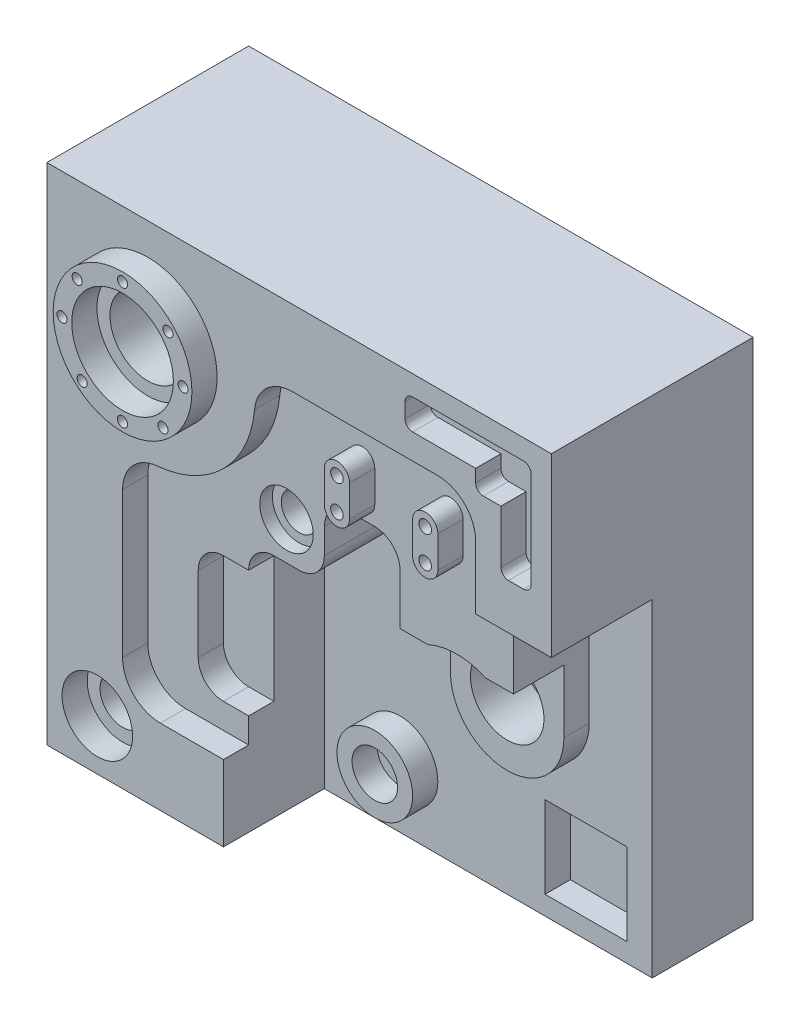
ISO-10303-21;
HEADER;
FILE_DESCRIPTION(('STEP AP214'),'2;1');
FILE_NAME('part.step','',(''),(''),'','','');
FILE_SCHEMA(('AUTOMOTIVE_DESIGN { 1 0 10303 214 1 1 1 1 }'));
ENDSEC;
DATA;
#1=APPLICATION_CONTEXT('core data for automotive mechanical design processes');
#2=APPLICATION_PROTOCOL_DEFINITION('international standard','automotive_design',2000,#1);
#3=PRODUCT_CONTEXT('',#1,'mechanical');
#4=PRODUCT('Part','Part','',(#3));
#5=PRODUCT_RELATED_PRODUCT_CATEGORY('part','',(#4));
#6=PRODUCT_DEFINITION_FORMATION('','',#4);
#7=PRODUCT_DEFINITION_CONTEXT('part definition',#1,'design');
#8=PRODUCT_DEFINITION('design','',#6,#7);
#9=PRODUCT_DEFINITION_SHAPE('','',#8);
#10=(LENGTH_UNIT() NAMED_UNIT(*) SI_UNIT(.MILLI.,.METRE.));
#11=(NAMED_UNIT(*) PLANE_ANGLE_UNIT() SI_UNIT($,.RADIAN.));
#12=(NAMED_UNIT(*) SI_UNIT($,.STERADIAN.) SOLID_ANGLE_UNIT());
#13=UNCERTAINTY_MEASURE_WITH_UNIT(LENGTH_MEASURE(1.E-05),#10,'distance_accuracy_value','');
#14=(GEOMETRIC_REPRESENTATION_CONTEXT(3) GLOBAL_UNCERTAINTY_ASSIGNED_CONTEXT((#13)) GLOBAL_UNIT_ASSIGNED_CONTEXT((#10,
#11,#12)) REPRESENTATION_CONTEXT('',''));
#15=CARTESIAN_POINT('',(0.,0.,0.));
#16=DIRECTION('',(0.,0.,1.));
#17=DIRECTION('',(1.,0.,0.));
#18=AXIS2_PLACEMENT_3D('',#15,#16,#17);
#19=CARTESIAN_POINT('',(-100.,-100.,0.));
#20=DIRECTION('',(0.,0.,-1.));
#21=DIRECTION('',(-1.,0.,0.));
#22=AXIS2_PLACEMENT_3D('',#19,#20,#21);
#23=PLANE('',#22);
#24=DIRECTION('',(0.,-1.,0.));
#25=VECTOR('',#24,1.);
#26=CARTESIAN_POINT('',(70.,55.,0.));
#27=LINE('',#26,#25);
#28=CARTESIAN_POINT('',(70.,55.,0.));
#29=VERTEX_POINT('',#28);
#30=CARTESIAN_POINT('',(70.,30.,0.));
#31=VERTEX_POINT('',#30);
#32=EDGE_CURVE('E910',#29,#31,#27,.T.);
#33=ORIENTED_EDGE('',*,*,#32,.T.);
#34=DIRECTION('',(-1.,0.,0.));
#35=VECTOR('',#34,1.);
#36=CARTESIAN_POINT('',(-100.,30.0000000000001,0.));
#37=LINE('',#36,#35);
#38=CARTESIAN_POINT('',(100.,30.,0.));
#39=VERTEX_POINT('',#38);
#40=EDGE_CURVE('E866',#39,#31,#37,.T.);
#41=ORIENTED_EDGE('',*,*,#40,.F.);
#42=DIRECTION('',(0.,1.,0.));
#43=VECTOR('',#42,1.);
#44=CARTESIAN_POINT('',(100.,-100.,0.));
#45=LINE('',#44,#43);
#46=CARTESIAN_POINT('',(100.,100.,0.));
#47=VERTEX_POINT('',#46);
#48=EDGE_CURVE('E957',#39,#47,#45,.T.);
#49=ORIENTED_EDGE('',*,*,#48,.T.);
#50=DIRECTION('',(1.,0.,0.));
#51=VECTOR('',#50,1.);
#52=CARTESIAN_POINT('',(-100.,100.,0.));
#53=LINE('',#52,#51);
#54=CARTESIAN_POINT('',(-100.,100.,0.));
#55=VERTEX_POINT('',#54);
#56=EDGE_CURVE('E945',#55,#47,#53,.T.);
#57=ORIENTED_EDGE('',*,*,#56,.F.);
#58=DIRECTION('',(0.,-1.,0.));
#59=VECTOR('',#58,1.);
#60=CARTESIAN_POINT('',(-100.,100.,0.));
#61=LINE('',#60,#59);
#62=CARTESIAN_POINT('',(-100.,-100.,0.));
#63=VERTEX_POINT('',#62);
#64=EDGE_CURVE('E940',#55,#63,#61,.T.);
#65=ORIENTED_EDGE('',*,*,#64,.T.);
#66=DIRECTION('',(-1.,0.,0.));
#67=VECTOR('',#66,1.);
#68=CARTESIAN_POINT('',(100.,-100.,0.));
#69=LINE('',#68,#67);
#70=CARTESIAN_POINT('',(-30.,-100.,0.));
#71=VERTEX_POINT('',#70);
#72=EDGE_CURVE('E955',#71,#63,#69,.T.);
#73=ORIENTED_EDGE('',*,*,#72,.F.);
#74=DIRECTION('',(0.,-1.,0.));
#75=VECTOR('',#74,1.);
#76=CARTESIAN_POINT('',(-30.,-100.,0.));
#77=LINE('',#76,#75);
#78=CARTESIAN_POINT('',(-30.,-70.,0.));
#79=VERTEX_POINT('',#78);
#80=EDGE_CURVE('E864',#79,#71,#77,.T.);
#81=ORIENTED_EDGE('',*,*,#80,.F.);
#82=DIRECTION('',(1.,0.,0.));
#83=VECTOR('',#82,1.);
#84=CARTESIAN_POINT('',(-55.,-70.,0.));
#85=LINE('',#84,#83);
#86=CARTESIAN_POINT('',(-55.,-70.,0.));
#87=VERTEX_POINT('',#86);
#88=EDGE_CURVE('E913',#87,#79,#85,.T.);
#89=ORIENTED_EDGE('',*,*,#88,.F.);
#90=CARTESIAN_POINT('',(-55.,-55.,0.));
#91=DIRECTION('',(0.,0.,-1.));
#92=DIRECTION('',(-1.,0.,0.));
#93=AXIS2_PLACEMENT_3D('',#90,#91,#92);
#94=CIRCLE('',#93,15.);
#95=CARTESIAN_POINT('',(-70.,-55.,0.));
#96=VERTEX_POINT('',#95);
#97=EDGE_CURVE('E916',#87,#96,#94,.T.);
#98=ORIENTED_EDGE('',*,*,#97,.T.);
#99=DIRECTION('',(0.,-1.,0.));
#100=VECTOR('',#99,1.);
#101=CARTESIAN_POINT('',(-70.,2.71780381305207,0.));
#102=LINE('',#101,#100);
#103=CARTESIAN_POINT('',(-70.,2.71780381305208,0.));
#104=VERTEX_POINT('',#103);
#105=EDGE_CURVE('E919',#104,#96,#102,.T.);
#106=ORIENTED_EDGE('',*,*,#105,.F.);
#107=CARTESIAN_POINT('',(-55.,2.71780381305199,0.));
#108=DIRECTION('',(0.,0.,1.));
#109=DIRECTION('',(1.,0.,0.));
#110=AXIS2_PLACEMENT_3D('',#107,#108,#109);
#111=CIRCLE('',#110,15.);
#112=CARTESIAN_POINT('',(-56.304347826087,17.6609854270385,0.));
#113=VERTEX_POINT('',#112);
#114=EDGE_CURVE('E875',#113,#104,#111,.T.);
#115=ORIENTED_EDGE('',*,*,#114,.F.);
#116=CARTESIAN_POINT('',(-60.,60.,0.));
#117=DIRECTION('',(0.,0.,1.));
#118=DIRECTION('',(1.,0.,0.));
#119=AXIS2_PLACEMENT_3D('',#116,#117,#118);
#120=CIRCLE('',#119,42.5);
#121=CARTESIAN_POINT('',(-17.6609854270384,56.3043478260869,0.));
#122=VERTEX_POINT('',#121);
#123=EDGE_CURVE('E871',#113,#122,#120,.T.);
#124=ORIENTED_EDGE('',*,*,#123,.T.);
#125=CARTESIAN_POINT('',(-2.71780381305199,55.,0.));
#126=DIRECTION('',(0.,0.,1.));
#127=DIRECTION('',(1.,0.,0.));
#128=AXIS2_PLACEMENT_3D('',#125,#126,#127);
#129=CIRCLE('',#128,15.);
#130=CARTESIAN_POINT('',(-2.71780381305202,70.,0.));
#131=VERTEX_POINT('',#130);
#132=EDGE_CURVE('E901',#131,#122,#129,.T.);
#133=ORIENTED_EDGE('',*,*,#132,.F.);
#134=DIRECTION('',(-1.,0.,0.));
#135=VECTOR('',#134,1.);
#136=CARTESIAN_POINT('',(55.,70.,0.));
#137=LINE('',#136,#135);
#138=CARTESIAN_POINT('',(55.,70.,0.));
#139=VERTEX_POINT('',#138);
#140=EDGE_CURVE('E904',#139,#131,#137,.T.);
#141=ORIENTED_EDGE('',*,*,#140,.F.);
#142=CARTESIAN_POINT('',(55.,55.,0.));
#143=DIRECTION('',(0.,0.,1.));
#144=DIRECTION('',(1.,0.,0.));
#145=AXIS2_PLACEMENT_3D('',#142,#143,#144);
#146=CIRCLE('',#145,15.);
#147=EDGE_CURVE('E907',#29,#139,#146,.T.);
#148=ORIENTED_EDGE('',*,*,#147,.F.);
#149=EDGE_LOOP('',(#33,#41,#49,#57,#65,#73,#81,#89,#98,#106,#115,#124,#133,#141,#148));
#150=FACE_BOUND('',#149,.T.);
#151=CARTESIAN_POINT('',(-60.,60.,0.));
#152=DIRECTION('',(0.,0.,-1.));
#153=DIRECTION('',(-1.,0.,0.));
#154=AXIS2_PLACEMENT_3D('',#151,#152,#153);
#155=CIRCLE('',#154,27.5);
#156=CARTESIAN_POINT('',(-87.5,60.,0.));
#157=VERTEX_POINT('',#156);
#158=EDGE_CURVE('E963',#157,#157,#155,.F.);
#159=ORIENTED_EDGE('',*,*,#158,.F.);
#160=EDGE_LOOP('',(#159));
#161=FACE_BOUND('',#160,.T.);
#162=CARTESIAN_POINT('',(-80.,-80.,0.));
#163=DIRECTION('',(0.,0.,1.));
#164=DIRECTION('',(1.,0.,0.));
#165=AXIS2_PLACEMENT_3D('',#162,#163,#164);
#166=CIRCLE('',#165,14.);
#167=CARTESIAN_POINT('',(-66.,-80.,0.));
#168=VERTEX_POINT('',#167);
#169=EDGE_CURVE('E476',#168,#168,#166,.T.);
#170=ORIENTED_EDGE('',*,*,#169,.F.);
#171=EDGE_LOOP('',(#170));
#172=FACE_BOUND('',#171,.T.);
#173=DIRECTION('',(-1.,0.,0.));
#174=VECTOR('',#173,1.);
#175=CARTESIAN_POINT('',(80.,80.,0.));
#176=LINE('',#175,#174);
#177=CARTESIAN_POINT('',(70.,80.,0.));
#178=VERTEX_POINT('',#177);
#179=CARTESIAN_POINT('',(45.,80.,0.));
#180=VERTEX_POINT('',#179);
#181=EDGE_CURVE('E437',#178,#180,#176,.T.);
#182=ORIENTED_EDGE('',*,*,#181,.T.);
#183=CARTESIAN_POINT('',(45.,83.,0.));
#184=DIRECTION('',(0.,0.,-1.));
#185=DIRECTION('',(-1.,0.,0.));
#186=AXIS2_PLACEMENT_3D('',#183,#184,#185);
#187=CIRCLE('',#186,3.);
#188=CARTESIAN_POINT('',(42.,83.,0.));
#189=VERTEX_POINT('',#188);
#190=EDGE_CURVE('E1042',#180,#189,#187,.T.);
#191=ORIENTED_EDGE('',*,*,#190,.T.);
#192=DIRECTION('',(0.,-1.,0.));
#193=VECTOR('',#192,1.);
#194=CARTESIAN_POINT('',(42.,92.,0.));
#195=LINE('',#194,#193);
#196=CARTESIAN_POINT('',(42.,89.,0.));
#197=VERTEX_POINT('',#196);
#198=EDGE_CURVE('E446',#197,#189,#195,.T.);
#199=ORIENTED_EDGE('',*,*,#198,.F.);
#200=CARTESIAN_POINT('',(45.,89.,0.));
#201=DIRECTION('',(0.,0.,-1.));
#202=DIRECTION('',(-1.,0.,0.));
#203=AXIS2_PLACEMENT_3D('',#200,#201,#202);
#204=CIRCLE('',#203,3.);
#205=CARTESIAN_POINT('',(45.,92.,0.));
#206=VERTEX_POINT('',#205);
#207=EDGE_CURVE('E11',#197,#206,#204,.T.);
#208=ORIENTED_EDGE('',*,*,#207,.T.);
#209=DIRECTION('',(1.,0.,0.));
#210=VECTOR('',#209,1.);
#211=CARTESIAN_POINT('',(70.,92.,0.));
#212=LINE('',#211,#210);
#213=CARTESIAN_POINT('',(89.,92.,0.));
#214=VERTEX_POINT('',#213);
#215=EDGE_CURVE('E470',#206,#214,#212,.T.);
#216=ORIENTED_EDGE('',*,*,#215,.T.);
#217=CARTESIAN_POINT('',(89.,89.,0.));
#218=DIRECTION('',(0.,0.,-1.));
#219=DIRECTION('',(-1.,0.,0.));
#220=AXIS2_PLACEMENT_3D('',#217,#218,#219);
#221=CIRCLE('',#220,3.);
#222=CARTESIAN_POINT('',(92.,89.,0.));
#223=VERTEX_POINT('',#222);
#224=EDGE_CURVE('E1040',#214,#223,#221,.T.);
#225=ORIENTED_EDGE('',*,*,#224,.T.);
#226=DIRECTION('',(0.,1.,0.));
#227=VECTOR('',#226,1.);
#228=CARTESIAN_POINT('',(92.,72.,0.));
#229=LINE('',#228,#227);
#230=CARTESIAN_POINT('',(92.,51.,0.));
#231=VERTEX_POINT('',#230);
#232=EDGE_CURVE('E460',#231,#223,#229,.T.);
#233=ORIENTED_EDGE('',*,*,#232,.F.);
#234=CARTESIAN_POINT('',(89.,51.,0.));
#235=DIRECTION('',(0.,0.,-1.));
#236=DIRECTION('',(-1.,0.,0.));
#237=AXIS2_PLACEMENT_3D('',#234,#235,#236);
#238=CIRCLE('',#237,3.);
#239=CARTESIAN_POINT('',(89.,48.,0.));
#240=VERTEX_POINT('',#239);
#241=EDGE_CURVE('E1038',#231,#240,#238,.T.);
#242=ORIENTED_EDGE('',*,*,#241,.T.);
#243=DIRECTION('',(-1.,0.,0.));
#244=VECTOR('',#243,1.);
#245=CARTESIAN_POINT('',(92.,48.,0.));
#246=LINE('',#245,#244);
#247=CARTESIAN_POINT('',(83.,48.,0.));
#248=VERTEX_POINT('',#247);
#249=EDGE_CURVE('E1065',#240,#248,#246,.T.);
#250=ORIENTED_EDGE('',*,*,#249,.T.);
#251=CARTESIAN_POINT('',(83.,51.,0.));
#252=DIRECTION('',(0.,0.,-1.));
#253=DIRECTION('',(-1.,0.,0.));
#254=AXIS2_PLACEMENT_3D('',#251,#252,#253);
#255=CIRCLE('',#254,3.);
#256=CARTESIAN_POINT('',(80.,51.,0.));
#257=VERTEX_POINT('',#256);
#258=EDGE_CURVE('E47',#248,#257,#255,.T.);
#259=ORIENTED_EDGE('',*,*,#258,.T.);
#260=DIRECTION('',(0.,-1.,0.));
#261=VECTOR('',#260,1.);
#262=CARTESIAN_POINT('',(80.,76.,0.));
#263=LINE('',#262,#261);
#264=CARTESIAN_POINT('',(80.,72.,0.));
#265=VERTEX_POINT('',#264);
#266=EDGE_CURVE('E454',#265,#257,#263,.T.);
#267=ORIENTED_EDGE('',*,*,#266,.F.);
#268=DIRECTION('',(-1.,0.,0.));
#269=VECTOR('',#268,1.);
#270=CARTESIAN_POINT('',(92.,72.,0.));
#271=LINE('',#270,#269);
#272=CARTESIAN_POINT('',(73.,72.,0.));
#273=VERTEX_POINT('',#272);
#274=EDGE_CURVE('E457',#265,#273,#271,.T.);
#275=ORIENTED_EDGE('',*,*,#274,.T.);
#276=CARTESIAN_POINT('',(73.,75.,0.));
#277=DIRECTION('',(0.,0.,-1.));
#278=DIRECTION('',(-1.,0.,0.));
#279=AXIS2_PLACEMENT_3D('',#276,#277,#278);
#280=CIRCLE('',#279,3.);
#281=CARTESIAN_POINT('',(70.,75.,0.));
#282=VERTEX_POINT('',#281);
#283=EDGE_CURVE('E60',#273,#282,#280,.T.);
#284=ORIENTED_EDGE('',*,*,#283,.T.);
#285=DIRECTION('',(0.,-1.,0.));
#286=VECTOR('',#285,1.);
#287=CARTESIAN_POINT('',(70.,92.,0.));
#288=LINE('',#287,#286);
#289=EDGE_CURVE('E450',#178,#282,#288,.T.);
#290=ORIENTED_EDGE('',*,*,#289,.F.);
#291=EDGE_LOOP('',(#182,#191,#199,#208,#216,#225,#233,#242,#250,#259,#267,#275,#284,#290));
#292=FACE_BOUND('',#291,.T.);
#293=ADVANCED_FACE('F39',(#150,#161,#172,#292),#23,.F.);
#294=CARTESIAN_POINT('',(70.,92.,-10.));
#295=DIRECTION('',(-1.,0.,0.));
#296=DIRECTION('',(0.,0.,1.));
#297=AXIS2_PLACEMENT_3D('',#294,#295,#296);
#298=PLANE('',#297);
#299=ORIENTED_EDGE('',*,*,#289,.T.);
#300=DIRECTION('',(0.,0.,1.));
#301=VECTOR('',#300,1.);
#302=CARTESIAN_POINT('',(70.,75.,-10.));
#303=LINE('',#302,#301);
#304=CARTESIAN_POINT('',(70.,75.,-10.));
#305=VERTEX_POINT('',#304);
#306=EDGE_CURVE('E1034',#282,#305,#303,.F.);
#307=ORIENTED_EDGE('',*,*,#306,.T.);
#308=DIRECTION('',(0.,-1.,0.));
#309=VECTOR('',#308,1.);
#310=CARTESIAN_POINT('',(70.,92.,-10.));
#311=LINE('',#310,#309);
#312=CARTESIAN_POINT('',(70.,80.,-10.));
#313=VERTEX_POINT('',#312);
#314=EDGE_CURVE('E453',#313,#305,#311,.T.);
#315=ORIENTED_EDGE('',*,*,#314,.F.);
#316=DIRECTION('',(0.,0.,-1.));
#317=VECTOR('',#316,1.);
#318=CARTESIAN_POINT('',(70.,80.,-10.));
#319=LINE('',#318,#317);
#320=EDGE_CURVE('E441',#178,#313,#319,.T.);
#321=ORIENTED_EDGE('',*,*,#320,.F.);
#322=EDGE_LOOP('',(#299,#307,#315,#321));
#323=FACE_BOUND('',#322,.T.);
#324=ADVANCED_FACE('F449',(#323),#298,.F.);
#325=CARTESIAN_POINT('',(-60.,60.,-10.));
#326=DIRECTION('',(0.,0.,1.));
#327=DIRECTION('',(1.,0.,0.));
#328=AXIS2_PLACEMENT_3D('',#325,#326,#327);
#329=PLANE('',#328);
#330=DIRECTION('',(0.,-1.,0.));
#331=VECTOR('',#330,1.);
#332=CARTESIAN_POINT('',(10.,50.,-10.));
#333=LINE('',#332,#331);
#334=CARTESIAN_POINT('',(9.99999999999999,50.,-10.));
#335=VERTEX_POINT('',#334);
#336=CARTESIAN_POINT('',(10.,37.5,-10.));
#337=VERTEX_POINT('',#336);
#338=EDGE_CURVE('E605',#335,#337,#333,.T.);
#339=ORIENTED_EDGE('',*,*,#338,.F.);
#340=CARTESIAN_POINT('',(15.,50.,-10.));
#341=DIRECTION('',(0.,0.,1.));
#342=DIRECTION('',(1.,0.,0.));
#343=AXIS2_PLACEMENT_3D('',#340,#341,#342);
#344=CIRCLE('',#343,5.);
#345=CARTESIAN_POINT('',(20.,50.,-10.));
#346=VERTEX_POINT('',#345);
#347=EDGE_CURVE('E590',#346,#335,#344,.T.);
#348=ORIENTED_EDGE('',*,*,#347,.F.);
#349=DIRECTION('',(0.,-1.,0.));
#350=VECTOR('',#349,1.);
#351=CARTESIAN_POINT('',(20.,50.,-10.));
#352=LINE('',#351,#350);
#353=CARTESIAN_POINT('',(20.,37.5,-10.));
#354=VERTEX_POINT('',#353);
#355=EDGE_CURVE('E595',#346,#354,#352,.T.);
#356=ORIENTED_EDGE('',*,*,#355,.T.);
#357=CARTESIAN_POINT('',(15.,37.5,-10.));
#358=DIRECTION('',(0.,0.,1.));
#359=DIRECTION('',(1.,0.,0.));
#360=AXIS2_PLACEMENT_3D('',#357,#358,#359);
#361=CIRCLE('',#360,5.);
#362=EDGE_CURVE('E608',#337,#354,#361,.T.);
#363=ORIENTED_EDGE('',*,*,#362,.F.);
#364=EDGE_LOOP('',(#339,#348,#356,#363));
#365=FACE_BOUND('',#364,.T.);
#366=CARTESIAN_POINT('',(-15.,15.,-10.));
#367=DIRECTION('',(0.,0.,1.));
#368=DIRECTION('',(1.,0.,0.));
#369=AXIS2_PLACEMENT_3D('',#366,#367,#368);
#370=CIRCLE('',#369,10.6066017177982);
#371=CARTESIAN_POINT('',(-4.39339828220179,15.,-10.));
#372=VERTEX_POINT('',#371);
#373=EDGE_CURVE('E693',#372,#372,#370,.T.);
#374=ORIENTED_EDGE('',*,*,#373,.F.);
#375=EDGE_LOOP('',(#374));
#376=FACE_BOUND('',#375,.T.);
#377=DIRECTION('',(0.,1.,0.));
#378=VECTOR('',#377,1.);
#379=CARTESIAN_POINT('',(-30.,60.,-10.));
#380=LINE('',#379,#378);
#381=CARTESIAN_POINT('',(-30.,-70.,-10.));
#382=VERTEX_POINT('',#381);
#383=CARTESIAN_POINT('',(-30.,-60.,-10.));
#384=VERTEX_POINT('',#383);
#385=EDGE_CURVE('E995',#382,#384,#380,.T.);
#386=ORIENTED_EDGE('',*,*,#385,.T.);
#387=DIRECTION('',(-1.,0.,0.));
#388=VECTOR('',#387,1.);
#389=CARTESIAN_POINT('',(-30.,-60.,-10.));
#390=LINE('',#389,#388);
#391=CARTESIAN_POINT('',(-40.,-60.,-10.));
#392=VERTEX_POINT('',#391);
#393=EDGE_CURVE('E705',#384,#392,#390,.T.);
#394=ORIENTED_EDGE('',*,*,#393,.T.);
#395=CARTESIAN_POINT('',(-40.,-50.,-10.));
#396=DIRECTION('',(0.,0.,1.));
#397=DIRECTION('',(1.,0.,0.));
#398=AXIS2_PLACEMENT_3D('',#395,#396,#397);
#399=CIRCLE('',#398,9.99999999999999);
#400=CARTESIAN_POINT('',(-50.,-50.,-10.));
#401=VERTEX_POINT('',#400);
#402=EDGE_CURVE('E728',#401,#392,#399,.T.);
#403=ORIENTED_EDGE('',*,*,#402,.F.);
#404=DIRECTION('',(0.,-1.,0.));
#405=VECTOR('',#404,1.);
#406=CARTESIAN_POINT('',(-50.,-20.,-10.));
#407=LINE('',#406,#405);
#408=CARTESIAN_POINT('',(-50.,-20.,-10.));
#409=VERTEX_POINT('',#408);
#410=EDGE_CURVE('E725',#409,#401,#407,.T.);
#411=ORIENTED_EDGE('',*,*,#410,.F.);
#412=CARTESIAN_POINT('',(-40.,-20.,-10.));
#413=DIRECTION('',(0.,0.,1.));
#414=DIRECTION('',(1.,0.,0.));
#415=AXIS2_PLACEMENT_3D('',#412,#413,#414);
#416=CIRCLE('',#415,10.);
#417=CARTESIAN_POINT('',(-40.,-10.,-10.));
#418=VERTEX_POINT('',#417);
#419=EDGE_CURVE('E722',#418,#409,#416,.T.);
#420=ORIENTED_EDGE('',*,*,#419,.F.);
#421=DIRECTION('',(1.,0.,0.));
#422=VECTOR('',#421,1.);
#423=CARTESIAN_POINT('',(-40.,-10.,-10.));
#424=LINE('',#423,#422);
#425=CARTESIAN_POINT('',(-30.,-10.,-10.));
#426=VERTEX_POINT('',#425);
#427=EDGE_CURVE('E699',#418,#426,#424,.T.);
#428=ORIENTED_EDGE('',*,*,#427,.T.);
#429=CARTESIAN_POINT('',(-20.,-10.,-9.99999999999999));
#430=DIRECTION('',(0.,0.,1.));
#431=DIRECTION('',(1.,0.,0.));
#432=AXIS2_PLACEMENT_3D('',#429,#430,#431);
#433=CIRCLE('',#432,10.);
#434=CARTESIAN_POINT('',(-20.,0.,-9.99999999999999));
#435=VERTEX_POINT('',#434);
#436=EDGE_CURVE('E992',#435,#426,#433,.T.);
#437=ORIENTED_EDGE('',*,*,#436,.F.);
#438=DIRECTION('',(1.,0.,0.));
#439=VECTOR('',#438,1.);
#440=CARTESIAN_POINT('',(-60.,0.,-10.));
#441=LINE('',#440,#439);
#442=CARTESIAN_POINT('',(-10.,0.,-9.99999999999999));
#443=VERTEX_POINT('',#442);
#444=EDGE_CURVE('E989',#435,#443,#441,.T.);
#445=ORIENTED_EDGE('',*,*,#444,.T.);
#446=CARTESIAN_POINT('',(-10.,10.,-9.99999999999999));
#447=DIRECTION('',(0.,0.,1.));
#448=DIRECTION('',(1.,0.,0.));
#449=AXIS2_PLACEMENT_3D('',#446,#447,#448);
#450=CIRCLE('',#449,10.);
#451=CARTESIAN_POINT('',(0.,10.,-9.99999999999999));
#452=VERTEX_POINT('',#451);
#453=EDGE_CURVE('E987',#452,#443,#450,.F.);
#454=ORIENTED_EDGE('',*,*,#453,.F.);
#455=DIRECTION('',(0.,1.,0.));
#456=VECTOR('',#455,1.);
#457=CARTESIAN_POINT('',(0.,60.,-10.));
#458=LINE('',#457,#456);
#459=CARTESIAN_POINT('',(0.,20.,-9.99999999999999));
#460=VERTEX_POINT('',#459);
#461=EDGE_CURVE('E984',#452,#460,#458,.T.);
#462=ORIENTED_EDGE('',*,*,#461,.T.);
#463=CARTESIAN_POINT('',(10.,20.,-9.99999999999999));
#464=DIRECTION('',(0.,0.,1.));
#465=DIRECTION('',(1.,0.,0.));
#466=AXIS2_PLACEMENT_3D('',#463,#464,#465);
#467=CIRCLE('',#466,10.);
#468=CARTESIAN_POINT('',(10.,30.,-9.99999999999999));
#469=VERTEX_POINT('',#468);
#470=EDGE_CURVE('E982',#469,#460,#467,.T.);
#471=ORIENTED_EDGE('',*,*,#470,.F.);
#472=DIRECTION('',(1.,0.,0.));
#473=VECTOR('',#472,1.);
#474=CARTESIAN_POINT('',(-60.,30.,-10.));
#475=LINE('',#474,#473);
#476=CARTESIAN_POINT('',(20.,30.,-9.99999999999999));
#477=VERTEX_POINT('',#476);
#478=EDGE_CURVE('E979',#469,#477,#475,.T.);
#479=ORIENTED_EDGE('',*,*,#478,.T.);
#480=CARTESIAN_POINT('',(20.,20.,-9.99999999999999));
#481=DIRECTION('',(0.,0.,1.));
#482=DIRECTION('',(1.,0.,0.));
#483=AXIS2_PLACEMENT_3D('',#480,#481,#482);
#484=CIRCLE('',#483,10.);
#485=CARTESIAN_POINT('',(30.,20.,-9.99999999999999));
#486=VERTEX_POINT('',#485);
#487=EDGE_CURVE('E977',#486,#477,#484,.T.);
#488=ORIENTED_EDGE('',*,*,#487,.F.);
#489=DIRECTION('',(0.,-1.,0.));
#490=VECTOR('',#489,1.);
#491=CARTESIAN_POINT('',(30.,60.,-10.));
#492=LINE('',#491,#490);
#493=CARTESIAN_POINT('',(30.,0.,-9.99999999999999));
#494=VERTEX_POINT('',#493);
#495=EDGE_CURVE('E974',#486,#494,#492,.T.);
#496=ORIENTED_EDGE('',*,*,#495,.T.);
#497=DIRECTION('',(1.,0.,0.));
#498=VECTOR('',#497,1.);
#499=CARTESIAN_POINT('',(-60.,0.,-10.));
#500=LINE('',#499,#498);
#501=CARTESIAN_POINT('',(41.0435607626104,0.,-9.99999999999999));
#502=VERTEX_POINT('',#501);
#503=EDGE_CURVE('E780',#494,#502,#500,.T.);
#504=ORIENTED_EDGE('',*,*,#503,.T.);
#505=CARTESIAN_POINT('',(52.5,-25.,-9.99999999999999));
#506=DIRECTION('',(0.,0.,1.));
#507=DIRECTION('',(1.,0.,0.));
#508=AXIS2_PLACEMENT_3D('',#505,#506,#507);
#509=CIRCLE('',#508,27.5);
#510=CARTESIAN_POINT('',(63.9564392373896,0.,-9.99999999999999));
#511=VERTEX_POINT('',#510);
#512=EDGE_CURVE('E750',#511,#502,#509,.T.);
#513=ORIENTED_EDGE('',*,*,#512,.F.);
#514=CARTESIAN_POINT('',(75.,0.,-9.99999999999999));
#515=VERTEX_POINT('',#514);
#516=EDGE_CURVE('E777',#511,#515,#500,.T.);
#517=ORIENTED_EDGE('',*,*,#516,.T.);
#518=DIRECTION('',(0.,-1.,0.));
#519=VECTOR('',#518,1.);
#520=CARTESIAN_POINT('',(75.,-10.,-9.99999999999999));
#521=LINE('',#520,#519);
#522=CARTESIAN_POINT('',(75.,20.,-9.99999999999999));
#523=VERTEX_POINT('',#522);
#524=EDGE_CURVE('E788',#523,#515,#521,.T.);
#525=ORIENTED_EDGE('',*,*,#524,.F.);
#526=CARTESIAN_POINT('',(85.,20.,-9.99999999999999));
#527=DIRECTION('',(0.,0.,1.));
#528=DIRECTION('',(1.,0.,0.));
#529=AXIS2_PLACEMENT_3D('',#526,#527,#528);
#530=CIRCLE('',#529,9.99999999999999);
#531=CARTESIAN_POINT('',(85.,30.,-10.));
#532=VERTEX_POINT('',#531);
#533=EDGE_CURVE('E791',#523,#532,#530,.F.);
#534=ORIENTED_EDGE('',*,*,#533,.T.);
#535=DIRECTION('',(-1.,0.,0.));
#536=VECTOR('',#535,1.);
#537=CARTESIAN_POINT('',(100.,30.,-10.));
#538=LINE('',#537,#536);
#539=CARTESIAN_POINT('',(70.,30.,-10.));
#540=VERTEX_POINT('',#539);
#541=EDGE_CURVE('E783',#532,#540,#538,.T.);
#542=ORIENTED_EDGE('',*,*,#541,.T.);
#543=DIRECTION('',(0.,-1.,0.));
#544=VECTOR('',#543,1.);
#545=CARTESIAN_POINT('',(70.,55.,-10.));
#546=LINE('',#545,#544);
#547=CARTESIAN_POINT('',(70.,55.,-10.));
#548=VERTEX_POINT('',#547);
#549=EDGE_CURVE('E884',#548,#540,#546,.T.);
#550=ORIENTED_EDGE('',*,*,#549,.F.);
#551=CARTESIAN_POINT('',(55.,55.,-10.));
#552=DIRECTION('',(0.,0.,1.));
#553=DIRECTION('',(1.,0.,0.));
#554=AXIS2_PLACEMENT_3D('',#551,#552,#553);
#555=CIRCLE('',#554,15.);
#556=CARTESIAN_POINT('',(55.,70.,-10.));
#557=VERTEX_POINT('',#556);
#558=EDGE_CURVE('E881',#548,#557,#555,.T.);
#559=ORIENTED_EDGE('',*,*,#558,.T.);
#560=DIRECTION('',(-1.,0.,0.));
#561=VECTOR('',#560,1.);
#562=CARTESIAN_POINT('',(55.,70.,-10.));
#563=LINE('',#562,#561);
#564=CARTESIAN_POINT('',(-2.71780381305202,70.,-10.));
#565=VERTEX_POINT('',#564);
#566=EDGE_CURVE('E878',#557,#565,#563,.T.);
#567=ORIENTED_EDGE('',*,*,#566,.T.);
#568=CARTESIAN_POINT('',(-2.71780381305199,55.,-10.));
#569=DIRECTION('',(0.,0.,1.));
#570=DIRECTION('',(1.,0.,0.));
#571=AXIS2_PLACEMENT_3D('',#568,#569,#570);
#572=CIRCLE('',#571,15.);
#573=CARTESIAN_POINT('',(-17.6609854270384,56.3043478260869,-10.));
#574=VERTEX_POINT('',#573);
#575=EDGE_CURVE('E874',#565,#574,#572,.T.);
#576=ORIENTED_EDGE('',*,*,#575,.T.);
#577=CARTESIAN_POINT('',(-60.,60.,-10.));
#578=DIRECTION('',(0.,0.,1.));
#579=DIRECTION('',(1.,0.,0.));
#580=AXIS2_PLACEMENT_3D('',#577,#578,#579);
#581=CIRCLE('',#580,42.5);
#582=CARTESIAN_POINT('',(-56.304347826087,17.6609854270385,-10.));
#583=VERTEX_POINT('',#582);
#584=EDGE_CURVE('E872',#583,#574,#581,.T.);
#585=ORIENTED_EDGE('',*,*,#584,.F.);
#586=CARTESIAN_POINT('',(-55.,2.71780381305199,-10.));
#587=DIRECTION('',(0.,0.,1.));
#588=DIRECTION('',(1.,0.,0.));
#589=AXIS2_PLACEMENT_3D('',#586,#587,#588);
#590=CIRCLE('',#589,15.);
#591=CARTESIAN_POINT('',(-70.,2.71780381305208,-10.));
#592=VERTEX_POINT('',#591);
#593=EDGE_CURVE('E895',#583,#592,#590,.T.);
#594=ORIENTED_EDGE('',*,*,#593,.T.);
#595=DIRECTION('',(0.,-1.,0.));
#596=VECTOR('',#595,1.);
#597=CARTESIAN_POINT('',(-70.,2.71780381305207,-10.));
#598=LINE('',#597,#596);
#599=CARTESIAN_POINT('',(-70.,-55.,-10.));
#600=VERTEX_POINT('',#599);
#601=EDGE_CURVE('E892',#592,#600,#598,.T.);
#602=ORIENTED_EDGE('',*,*,#601,.T.);
#603=CARTESIAN_POINT('',(-55.,-55.,-10.));
#604=DIRECTION('',(0.,0.,-1.));
#605=DIRECTION('',(-1.,0.,0.));
#606=AXIS2_PLACEMENT_3D('',#603,#604,#605);
#607=CIRCLE('',#606,15.);
#608=CARTESIAN_POINT('',(-55.,-70.,-10.));
#609=VERTEX_POINT('',#608);
#610=EDGE_CURVE('E890',#609,#600,#607,.T.);
#611=ORIENTED_EDGE('',*,*,#610,.F.);
#612=DIRECTION('',(1.,0.,0.));
#613=VECTOR('',#612,1.);
#614=CARTESIAN_POINT('',(-55.,-70.,-10.));
#615=LINE('',#614,#613);
#616=EDGE_CURVE('E887',#609,#382,#615,.T.);
#617=ORIENTED_EDGE('',*,*,#616,.T.);
#618=EDGE_LOOP('',(#386,#394,#403,#411,#420,#428,#437,#445,#454,#462,#471,#479,#488,#496,#504,
#513,#517,#525,#534,#542,#550,#559,#567,#576,#585,#594,#602,#611,#617));
#619=FACE_BOUND('',#618,.T.);
#620=DIRECTION('',(0.,-1.,0.));
#621=VECTOR('',#620,1.);
#622=CARTESIAN_POINT('',(45.,50.,-10.));
#623=LINE('',#622,#621);
#624=CARTESIAN_POINT('',(45.,50.,-10.));
#625=VERTEX_POINT('',#624);
#626=CARTESIAN_POINT('',(45.,37.5,-10.));
#627=VERTEX_POINT('',#626);
#628=EDGE_CURVE('E572',#625,#627,#623,.T.);
#629=ORIENTED_EDGE('',*,*,#628,.F.);
#630=CARTESIAN_POINT('',(50.,50.,-10.));
#631=DIRECTION('',(0.,0.,1.));
#632=DIRECTION('',(1.,0.,0.));
#633=AXIS2_PLACEMENT_3D('',#630,#631,#632);
#634=CIRCLE('',#633,5.);
#635=CARTESIAN_POINT('',(55.,50.,-10.));
#636=VERTEX_POINT('',#635);
#637=EDGE_CURVE('E555',#636,#625,#634,.T.);
#638=ORIENTED_EDGE('',*,*,#637,.F.);
#639=DIRECTION('',(0.,-1.,0.));
#640=VECTOR('',#639,1.);
#641=CARTESIAN_POINT('',(55.,50.,-10.));
#642=LINE('',#641,#640);
#643=CARTESIAN_POINT('',(55.,37.5,-10.));
#644=VERTEX_POINT('',#643);
#645=EDGE_CURVE('E562',#636,#644,#642,.T.);
#646=ORIENTED_EDGE('',*,*,#645,.T.);
#647=CARTESIAN_POINT('',(50.,37.5,-10.));
#648=DIRECTION('',(0.,0.,1.));
#649=DIRECTION('',(1.,0.,0.));
#650=AXIS2_PLACEMENT_3D('',#647,#648,#649);
#651=CIRCLE('',#650,4.99999999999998);
#652=EDGE_CURVE('E575',#627,#644,#651,.T.);
#653=ORIENTED_EDGE('',*,*,#652,.F.);
#654=EDGE_LOOP('',(#629,#638,#646,#653));
#655=FACE_BOUND('',#654,.T.);
#656=ADVANCED_FACE('F1128',(#365,#376,#619,#655),#329,.T.);
#657=CARTESIAN_POINT('',(85.,20.,-40.));
#658=DIRECTION('',(0.,0.,1.));
#659=DIRECTION('',(1.,0.,0.));
#660=AXIS2_PLACEMENT_3D('',#657,#658,#659);
#661=PLANE('',#660);
#662=DIRECTION('',(0.,-1.,0.));
#663=VECTOR('',#662,1.);
#664=CARTESIAN_POINT('',(57.5,-60.,-40.));
#665=LINE('',#664,#663);
#666=CARTESIAN_POINT('',(57.5,-60.,-40.));
#667=VERTEX_POINT('',#666);
#668=CARTESIAN_POINT('',(57.5,-92.5,-40.));
#669=VERTEX_POINT('',#668);
#670=EDGE_CURVE('E623',#667,#669,#665,.T.);
#671=ORIENTED_EDGE('',*,*,#670,.F.);
#672=DIRECTION('',(1.,0.,0.));
#673=VECTOR('',#672,1.);
#674=CARTESIAN_POINT('',(57.5,-60.,-40.));
#675=LINE('',#674,#673);
#676=CARTESIAN_POINT('',(90.,-60.,-40.));
#677=VERTEX_POINT('',#676);
#678=EDGE_CURVE('E628',#667,#677,#675,.T.);
#679=ORIENTED_EDGE('',*,*,#678,.T.);
#680=DIRECTION('',(0.,1.,0.));
#681=VECTOR('',#680,1.);
#682=CARTESIAN_POINT('',(90.,-92.5,-40.));
#683=LINE('',#682,#681);
#684=CARTESIAN_POINT('',(90.,-92.5,-40.));
#685=VERTEX_POINT('',#684);
#686=EDGE_CURVE('E640',#685,#677,#683,.T.);
#687=ORIENTED_EDGE('',*,*,#686,.F.);
#688=DIRECTION('',(-1.,0.,0.));
#689=VECTOR('',#688,1.);
#690=CARTESIAN_POINT('',(90.,-92.5,-40.));
#691=LINE('',#690,#689);
#692=EDGE_CURVE('E637',#685,#669,#691,.T.);
#693=ORIENTED_EDGE('',*,*,#692,.T.);
#694=EDGE_LOOP('',(#671,#679,#687,#693));
#695=FACE_BOUND('',#694,.T.);
#696=CARTESIAN_POINT('',(52.5,-25.,-40.));
#697=DIRECTION('',(0.,0.,1.));
#698=DIRECTION('',(1.,0.,0.));
#699=AXIS2_PLACEMENT_3D('',#696,#697,#698);
#700=CIRCLE('',#699,22.5);
#701=CARTESIAN_POINT('',(30.,-25.,-40.));
#702=VERTEX_POINT('',#701);
#703=CARTESIAN_POINT('',(75.,-25.,-40.));
#704=VERTEX_POINT('',#703);
#705=EDGE_CURVE('E768',#702,#704,#700,.T.);
#706=ORIENTED_EDGE('',*,*,#705,.F.);
#707=DIRECTION('',(0.,-1.,0.));
#708=VECTOR('',#707,1.);
#709=CARTESIAN_POINT('',(30.,20.,-40.));
#710=LINE('',#709,#708);
#711=CARTESIAN_POINT('',(30.,20.,-40.));
#712=VERTEX_POINT('',#711);
#713=EDGE_CURVE('E805',#712,#702,#710,.T.);
#714=ORIENTED_EDGE('',*,*,#713,.F.);
#715=CARTESIAN_POINT('',(20.,20.,-40.));
#716=DIRECTION('',(0.,0.,1.));
#717=DIRECTION('',(1.,0.,0.));
#718=AXIS2_PLACEMENT_3D('',#715,#716,#717);
#719=CIRCLE('',#718,10.);
#720=CARTESIAN_POINT('',(20.,30.,-40.));
#721=VERTEX_POINT('',#720);
#722=EDGE_CURVE('E807',#712,#721,#719,.T.);
#723=ORIENTED_EDGE('',*,*,#722,.T.);
#724=DIRECTION('',(1.,0.,0.));
#725=VECTOR('',#724,1.);
#726=CARTESIAN_POINT('',(10.,30.,-40.));
#727=LINE('',#726,#725);
#728=CARTESIAN_POINT('',(10.,30.,-40.));
#729=VERTEX_POINT('',#728);
#730=EDGE_CURVE('E810',#729,#721,#727,.T.);
#731=ORIENTED_EDGE('',*,*,#730,.F.);
#732=CARTESIAN_POINT('',(10.,20.,-40.));
#733=DIRECTION('',(0.,0.,1.));
#734=DIRECTION('',(1.,0.,0.));
#735=AXIS2_PLACEMENT_3D('',#732,#733,#734);
#736=CIRCLE('',#735,10.);
#737=CARTESIAN_POINT('',(0.,20.,-40.));
#738=VERTEX_POINT('',#737);
#739=EDGE_CURVE('E812',#729,#738,#736,.T.);
#740=ORIENTED_EDGE('',*,*,#739,.T.);
#741=DIRECTION('',(0.,1.,0.));
#742=VECTOR('',#741,1.);
#743=CARTESIAN_POINT('',(0.,10.,-40.));
#744=LINE('',#743,#742);
#745=CARTESIAN_POINT('',(0.,10.,-40.));
#746=VERTEX_POINT('',#745);
#747=EDGE_CURVE('E815',#746,#738,#744,.T.);
#748=ORIENTED_EDGE('',*,*,#747,.F.);
#749=CARTESIAN_POINT('',(-10.,10.,-40.));
#750=DIRECTION('',(0.,0.,-1.));
#751=DIRECTION('',(-1.,0.,0.));
#752=AXIS2_PLACEMENT_3D('',#749,#750,#751);
#753=CIRCLE('',#752,10.);
#754=CARTESIAN_POINT('',(-10.,0.,-40.));
#755=VERTEX_POINT('',#754);
#756=EDGE_CURVE('E817',#746,#755,#753,.T.);
#757=ORIENTED_EDGE('',*,*,#756,.T.);
#758=DIRECTION('',(1.,0.,0.));
#759=VECTOR('',#758,1.);
#760=CARTESIAN_POINT('',(-20.,0.,-40.));
#761=LINE('',#760,#759);
#762=CARTESIAN_POINT('',(-20.,0.,-40.));
#763=VERTEX_POINT('',#762);
#764=EDGE_CURVE('E820',#763,#755,#761,.T.);
#765=ORIENTED_EDGE('',*,*,#764,.F.);
#766=CARTESIAN_POINT('',(-20.,-10.,-40.));
#767=DIRECTION('',(0.,0.,1.));
#768=DIRECTION('',(1.,0.,0.));
#769=AXIS2_PLACEMENT_3D('',#766,#767,#768);
#770=CIRCLE('',#769,10.);
#771=CARTESIAN_POINT('',(-30.,-9.99999999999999,-40.));
#772=VERTEX_POINT('',#771);
#773=EDGE_CURVE('E822',#763,#772,#770,.T.);
#774=ORIENTED_EDGE('',*,*,#773,.T.);
#775=DIRECTION('',(0.,1.,0.));
#776=VECTOR('',#775,1.);
#777=CARTESIAN_POINT('',(-30.,-100.,-40.));
#778=LINE('',#777,#776);
#779=CARTESIAN_POINT('',(-30.,-100.,-40.));
#780=VERTEX_POINT('',#779);
#781=EDGE_CURVE('E825',#780,#772,#778,.T.);
#782=ORIENTED_EDGE('',*,*,#781,.F.);
#783=DIRECTION('',(1.,0.,0.));
#784=VECTOR('',#783,1.);
#785=CARTESIAN_POINT('',(-30.,-100.,-40.));
#786=LINE('',#785,#784);
#787=CARTESIAN_POINT('',(100.,-100.,-40.));
#788=VERTEX_POINT('',#787);
#789=EDGE_CURVE('E793',#780,#788,#786,.T.);
#790=ORIENTED_EDGE('',*,*,#789,.T.);
#791=DIRECTION('',(0.,-1.,0.));
#792=VECTOR('',#791,1.);
#793=CARTESIAN_POINT('',(100.,30.,-40.));
#794=LINE('',#793,#792);
#795=CARTESIAN_POINT('',(100.,30.,-40.));
#796=VERTEX_POINT('',#795);
#797=EDGE_CURVE('E795',#796,#788,#794,.T.);
#798=ORIENTED_EDGE('',*,*,#797,.F.);
#799=DIRECTION('',(1.,0.,0.));
#800=VECTOR('',#799,1.);
#801=CARTESIAN_POINT('',(85.,30.,-40.));
#802=LINE('',#801,#800);
#803=CARTESIAN_POINT('',(85.,30.,-40.));
#804=VERTEX_POINT('',#803);
#805=EDGE_CURVE('E798',#804,#796,#802,.T.);
#806=ORIENTED_EDGE('',*,*,#805,.F.);
#807=CARTESIAN_POINT('',(85.,20.,-40.));
#808=DIRECTION('',(0.,0.,1.));
#809=DIRECTION('',(1.,0.,0.));
#810=AXIS2_PLACEMENT_3D('',#807,#808,#809);
#811=CIRCLE('',#810,9.99999999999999);
#812=CARTESIAN_POINT('',(75.,20.,-40.));
#813=VERTEX_POINT('',#812);
#814=EDGE_CURVE('E800',#804,#813,#811,.T.);
#815=ORIENTED_EDGE('',*,*,#814,.T.);
#816=DIRECTION('',(0.,1.,0.));
#817=VECTOR('',#816,1.);
#818=CARTESIAN_POINT('',(75.,-10.,-40.));
#819=LINE('',#818,#817);
#820=EDGE_CURVE('E803',#704,#813,#819,.T.);
#821=ORIENTED_EDGE('',*,*,#820,.F.);
#822=EDGE_LOOP('',(#706,#714,#723,#731,#740,#748,#757,#765,#774,#782,#790,#798,#806,#815,#821));
#823=FACE_BOUND('',#822,.T.);
#824=CARTESIAN_POINT('',(0.,-75.,-40.));
#825=DIRECTION('',(0.,0.,1.));
#826=DIRECTION('',(1.,0.,0.));
#827=AXIS2_PLACEMENT_3D('',#824,#825,#826);
#828=CIRCLE('',#827,15.);
#829=CARTESIAN_POINT('',(15.,-75.,-40.));
#830=VERTEX_POINT('',#829);
#831=EDGE_CURVE('E663',#830,#830,#828,.T.);
#832=ORIENTED_EDGE('',*,*,#831,.F.);
#833=EDGE_LOOP('',(#832));
#834=FACE_BOUND('',#833,.T.);
#835=ADVANCED_FACE('F2030',(#695,#823,#834),#661,.T.);
#836=CARTESIAN_POINT('',(-30.,-100.,-40.));
#837=DIRECTION('',(1.,0.,0.));
#838=DIRECTION('',(0.,0.,-1.));
#839=AXIS2_PLACEMENT_3D('',#836,#837,#838);
#840=PLANE('',#839);
#841=DIRECTION('',(0.,1.,0.));
#842=VECTOR('',#841,1.);
#843=CARTESIAN_POINT('',(-30.,-60.,-20.));
#844=LINE('',#843,#842);
#845=CARTESIAN_POINT('',(-30.,-60.,-20.));
#846=VERTEX_POINT('',#845);
#847=CARTESIAN_POINT('',(-30.,-9.99999999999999,-20.));
#848=VERTEX_POINT('',#847);
#849=EDGE_CURVE('E702',#846,#848,#844,.T.);
#850=ORIENTED_EDGE('',*,*,#849,.F.);
#851=DIRECTION('',(0.,0.,1.));
#852=VECTOR('',#851,1.);
#853=CARTESIAN_POINT('',(-30.,-60.,-20.));
#854=LINE('',#853,#852);
#855=EDGE_CURVE('E733',#846,#384,#854,.T.);
#856=ORIENTED_EDGE('',*,*,#855,.T.);
#857=ORIENTED_EDGE('',*,*,#385,.F.);
#858=DIRECTION('',(0.,0.,1.));
#859=VECTOR('',#858,1.);
#860=CARTESIAN_POINT('',(-30.,-70.,-10.));
#861=LINE('',#860,#859);
#862=EDGE_CURVE('E831',#382,#79,#861,.T.);
#863=ORIENTED_EDGE('',*,*,#862,.T.);
#864=ORIENTED_EDGE('',*,*,#80,.T.);
#865=DIRECTION('',(0.,0.,1.));
#866=VECTOR('',#865,1.);
#867=CARTESIAN_POINT('',(-30.,-100.,-40.));
#868=LINE('',#867,#866);
#869=EDGE_CURVE('E828',#780,#71,#868,.T.);
#870=ORIENTED_EDGE('',*,*,#869,.F.);
#871=ORIENTED_EDGE('',*,*,#781,.T.);
#872=DIRECTION('',(0.,0.,1.));
#873=VECTOR('',#872,1.);
#874=CARTESIAN_POINT('',(-30.,-9.99999999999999,-40.));
#875=LINE('',#874,#873);
#876=EDGE_CURVE('E832',#772,#848,#875,.T.);
#877=ORIENTED_EDGE('',*,*,#876,.T.);
#878=EDGE_LOOP('',(#850,#856,#857,#863,#864,#870,#871,#877));
#879=FACE_BOUND('',#878,.T.);
#880=ADVANCED_FACE('F2024',(#879),#840,.T.);
#881=CARTESIAN_POINT('',(30.,0.,-30.));
#882=DIRECTION('',(0.,-1.,0.));
#883=DIRECTION('',(0.,0.,-1.));
#884=AXIS2_PLACEMENT_3D('',#881,#882,#883);
#885=PLANE('',#884);
#886=DIRECTION('',(0.,0.,1.));
#887=VECTOR('',#886,1.);
#888=CARTESIAN_POINT('',(63.9564392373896,0.,-30.));
#889=LINE('',#888,#887);
#890=CARTESIAN_POINT('',(63.9564392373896,0.,-30.));
#891=VERTEX_POINT('',#890);
#892=EDGE_CURVE('E752',#891,#511,#889,.T.);
#893=ORIENTED_EDGE('',*,*,#892,.F.);
#894=DIRECTION('',(1.,0.,0.));
#895=VECTOR('',#894,1.);
#896=CARTESIAN_POINT('',(30.,0.,-30.));
#897=LINE('',#896,#895);
#898=CARTESIAN_POINT('',(75.,0.,-30.));
#899=VERTEX_POINT('',#898);
#900=EDGE_CURVE('E758',#891,#899,#897,.T.);
#901=ORIENTED_EDGE('',*,*,#900,.T.);
#902=DIRECTION('',(0.,0.,1.));
#903=VECTOR('',#902,1.);
#904=CARTESIAN_POINT('',(75.,0.,-30.));
#905=LINE('',#904,#903);
#906=EDGE_CURVE('E764',#899,#515,#905,.T.);
#907=ORIENTED_EDGE('',*,*,#906,.T.);
#908=ORIENTED_EDGE('',*,*,#516,.F.);
#909=EDGE_LOOP('',(#893,#901,#907,#908));
#910=FACE_BOUND('',#909,.T.);
#911=ADVANCED_FACE('F1819',(#910),#885,.T.);
#912=CARTESIAN_POINT('',(75.,-10.,-40.));
#913=DIRECTION('',(1.,0.,0.));
#914=DIRECTION('',(0.,1.,0.));
#915=AXIS2_PLACEMENT_3D('',#912,#913,#914);
#916=PLANE('',#915);
#917=ORIENTED_EDGE('',*,*,#524,.T.);
#918=ORIENTED_EDGE('',*,*,#906,.F.);
#919=DIRECTION('',(0.,1.,0.));
#920=VECTOR('',#919,1.);
#921=CARTESIAN_POINT('',(75.,-25.,-30.));
#922=LINE('',#921,#920);
#923=CARTESIAN_POINT('',(75.,-25.,-30.));
#924=VERTEX_POINT('',#923);
#925=EDGE_CURVE('E756',#924,#899,#922,.T.);
#926=ORIENTED_EDGE('',*,*,#925,.F.);
#927=DIRECTION('',(0.,0.,1.));
#928=VECTOR('',#927,1.);
#929=CARTESIAN_POINT('',(75.,-25.,-40.));
#930=LINE('',#929,#928);
#931=EDGE_CURVE('E773',#704,#924,#930,.T.);
#932=ORIENTED_EDGE('',*,*,#931,.F.);
#933=ORIENTED_EDGE('',*,*,#820,.T.);
#934=DIRECTION('',(0.,0.,1.));
#935=VECTOR('',#934,1.);
#936=CARTESIAN_POINT('',(75.,20.,-40.));
#937=LINE('',#936,#935);
#938=EDGE_CURVE('E856',#813,#523,#937,.T.);
#939=ORIENTED_EDGE('',*,*,#938,.T.);
#940=EDGE_LOOP('',(#917,#918,#926,#932,#933,#939));
#941=FACE_BOUND('',#940,.T.);
#942=ADVANCED_FACE('F2010',(#941),#916,.T.);
#943=CARTESIAN_POINT('',(30.,20.,-40.));
#944=DIRECTION('',(-1.,0.,0.));
#945=DIRECTION('',(0.,0.,1.));
#946=AXIS2_PLACEMENT_3D('',#943,#944,#945);
#947=PLANE('',#946);
#948=DIRECTION('',(0.,1.,0.));
#949=VECTOR('',#948,1.);
#950=CARTESIAN_POINT('',(30.,-25.,-30.));
#951=LINE('',#950,#949);
#952=CARTESIAN_POINT('',(30.,-25.,-30.));
#953=VERTEX_POINT('',#952);
#954=CARTESIAN_POINT('',(30.,0.,-30.));
#955=VERTEX_POINT('',#954);
#956=EDGE_CURVE('E762',#953,#955,#951,.T.);
#957=ORIENTED_EDGE('',*,*,#956,.T.);
#958=DIRECTION('',(0.,0.,1.));
#959=VECTOR('',#958,1.);
#960=CARTESIAN_POINT('',(30.,0.,-30.));
#961=LINE('',#960,#959);
#962=EDGE_CURVE('E765',#955,#494,#961,.T.);
#963=ORIENTED_EDGE('',*,*,#962,.T.);
#964=ORIENTED_EDGE('',*,*,#495,.F.);
#965=DIRECTION('',(0.,0.,1.));
#966=VECTOR('',#965,1.);
#967=CARTESIAN_POINT('',(30.,20.,-40.));
#968=LINE('',#967,#966);
#969=EDGE_CURVE('E853',#712,#486,#968,.T.);
#970=ORIENTED_EDGE('',*,*,#969,.F.);
#971=ORIENTED_EDGE('',*,*,#713,.T.);
#972=DIRECTION('',(0.,0.,1.));
#973=VECTOR('',#972,1.);
#974=CARTESIAN_POINT('',(30.,-25.,-40.));
#975=LINE('',#974,#973);
#976=EDGE_CURVE('E774',#702,#953,#975,.T.);
#977=ORIENTED_EDGE('',*,*,#976,.T.);
#978=EDGE_LOOP('',(#957,#963,#964,#970,#971,#977));
#979=FACE_BOUND('',#978,.T.);
#980=ADVANCED_FACE('F2002',(#979),#947,.T.);
#981=CARTESIAN_POINT('',(52.5,-25.,-40.));
#982=DIRECTION('',(0.,0.,1.));
#983=DIRECTION('',(1.,0.,0.));
#984=AXIS2_PLACEMENT_3D('',#981,#982,#983);
#985=CYLINDRICAL_SURFACE('',#984,22.5);
#986=ORIENTED_EDGE('',*,*,#931,.T.);
#987=CARTESIAN_POINT('',(52.5,-25.,-30.));
#988=DIRECTION('',(0.,0.,1.));
#989=DIRECTION('',(1.,0.,0.));
#990=AXIS2_PLACEMENT_3D('',#987,#988,#989);
#991=CIRCLE('',#990,22.5);
#992=EDGE_CURVE('E754',#953,#924,#991,.T.);
#993=ORIENTED_EDGE('',*,*,#992,.F.);
#994=ORIENTED_EDGE('',*,*,#976,.F.);
#995=ORIENTED_EDGE('',*,*,#705,.T.);
#996=EDGE_LOOP('',(#986,#993,#994,#995));
#997=FACE_BOUND('',#996,.T.);
#998=ADVANCED_FACE('F1995',(#997),#985,.T.);
#999=CARTESIAN_POINT('',(85.,20.,-40.));
#1000=DIRECTION('',(0.,0.,1.));
#1001=DIRECTION('',(1.,0.,0.));
#1002=AXIS2_PLACEMENT_3D('',#999,#1000,#1001);
#1003=CYLINDRICAL_SURFACE('',#1002,9.99999999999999);
#1004=ORIENTED_EDGE('',*,*,#533,.F.);
#1005=ORIENTED_EDGE('',*,*,#938,.F.);
#1006=ORIENTED_EDGE('',*,*,#814,.F.);
#1007=DIRECTION('',(0.,0.,1.));
#1008=VECTOR('',#1007,1.);
#1009=CARTESIAN_POINT('',(85.,30.,-40.));
#1010=LINE('',#1009,#1008);
#1011=EDGE_CURVE('E859',#804,#532,#1010,.T.);
#1012=ORIENTED_EDGE('',*,*,#1011,.T.);
#1013=EDGE_LOOP('',(#1004,#1005,#1006,#1012));
#1014=FACE_BOUND('',#1013,.T.);
#1015=ADVANCED_FACE('F1144',(#1014),#1003,.F.);
#1016=CARTESIAN_POINT('',(100.,-100.,-80.));
#1017=DIRECTION('',(1.,0.,0.));
#1018=DIRECTION('',(0.,0.,-1.));
#1019=AXIS2_PLACEMENT_3D('',#1016,#1017,#1018);
#1020=PLANE('',#1019);
#1021=ORIENTED_EDGE('',*,*,#48,.F.);
#1022=DIRECTION('',(0.,0.,1.));
#1023=VECTOR('',#1022,1.);
#1024=CARTESIAN_POINT('',(100.,30.,-40.));
#1025=LINE('',#1024,#1023);
#1026=EDGE_CURVE('E827',#796,#39,#1025,.T.);
#1027=ORIENTED_EDGE('',*,*,#1026,.F.);
#1028=ORIENTED_EDGE('',*,*,#797,.T.);
#1029=DIRECTION('',(0.,0.,1.));
#1030=VECTOR('',#1029,1.);
#1031=CARTESIAN_POINT('',(100.,-100.,-80.));
#1032=LINE('',#1031,#1030);
#1033=CARTESIAN_POINT('',(100.,-100.,-80.));
#1034=VERTEX_POINT('',#1033);
#1035=EDGE_CURVE('E967',#1034,#788,#1032,.T.);
#1036=ORIENTED_EDGE('',*,*,#1035,.F.);
#1037=DIRECTION('',(0.,1.,0.));
#1038=VECTOR('',#1037,1.);
#1039=CARTESIAN_POINT('',(100.,-100.,-80.));
#1040=LINE('',#1039,#1038);
#1041=CARTESIAN_POINT('',(100.,100.,-80.));
#1042=VERTEX_POINT('',#1041);
#1043=EDGE_CURVE('E947',#1034,#1042,#1040,.T.);
#1044=ORIENTED_EDGE('',*,*,#1043,.T.);
#1045=DIRECTION('',(0.,0.,1.));
#1046=VECTOR('',#1045,1.);
#1047=CARTESIAN_POINT('',(100.,100.,-80.));
#1048=LINE('',#1047,#1046);
#1049=EDGE_CURVE('E964',#1042,#47,#1048,.T.);
#1050=ORIENTED_EDGE('',*,*,#1049,.T.);
#1051=EDGE_LOOP('',(#1021,#1027,#1028,#1036,#1044,#1050));
#1052=FACE_BOUND('',#1051,.T.);
#1053=ADVANCED_FACE('F1140',(#1052),#1020,.T.);
#1054=CARTESIAN_POINT('',(100.,-100.,-80.));
#1055=DIRECTION('',(0.,1.,0.));
#1056=DIRECTION('',(0.,0.,1.));
#1057=AXIS2_PLACEMENT_3D('',#1054,#1055,#1056);
#1058=PLANE('',#1057);
#1059=ORIENTED_EDGE('',*,*,#869,.T.);
#1060=ORIENTED_EDGE('',*,*,#72,.T.);
#1061=DIRECTION('',(0.,0.,1.));
#1062=VECTOR('',#1061,1.);
#1063=CARTESIAN_POINT('',(-100.,-100.,-80.));
#1064=LINE('',#1063,#1062);
#1065=CARTESIAN_POINT('',(-100.,-100.,-80.));
#1066=VERTEX_POINT('',#1065);
#1067=EDGE_CURVE('E952',#1066,#63,#1064,.T.);
#1068=ORIENTED_EDGE('',*,*,#1067,.F.);
#1069=DIRECTION('',(-1.,0.,0.));
#1070=VECTOR('',#1069,1.);
#1071=CARTESIAN_POINT('',(100.,-100.,-80.));
#1072=LINE('',#1071,#1070);
#1073=EDGE_CURVE('E944',#1034,#1066,#1072,.T.);
#1074=ORIENTED_EDGE('',*,*,#1073,.F.);
#1075=ORIENTED_EDGE('',*,*,#1035,.T.);
#1076=ORIENTED_EDGE('',*,*,#789,.F.);
#1077=EDGE_LOOP('',(#1059,#1060,#1068,#1074,#1075,#1076));
#1078=FACE_BOUND('',#1077,.T.);
#1079=ADVANCED_FACE('F1143',(#1078),#1058,.F.);
#1080=CARTESIAN_POINT('',(70.,55.,-10.));
#1081=DIRECTION('',(-1.,0.,0.));
#1082=DIRECTION('',(0.,0.,1.));
#1083=AXIS2_PLACEMENT_3D('',#1080,#1081,#1082);
#1084=PLANE('',#1083);
#1085=DIRECTION('',(0.,0.,1.));
#1086=VECTOR('',#1085,1.);
#1087=CARTESIAN_POINT('',(70.,30.,-10.));
#1088=LINE('',#1087,#1086);
#1089=EDGE_CURVE('E785',#540,#31,#1088,.T.);
#1090=ORIENTED_EDGE('',*,*,#1089,.T.);
#1091=ORIENTED_EDGE('',*,*,#32,.F.);
#1092=DIRECTION('',(0.,0.,1.));
#1093=VECTOR('',#1092,1.);
#1094=CARTESIAN_POINT('',(70.,55.,-10.));
#1095=LINE('',#1094,#1093);
#1096=EDGE_CURVE('E932',#548,#29,#1095,.T.);
#1097=ORIENTED_EDGE('',*,*,#1096,.F.);
#1098=ORIENTED_EDGE('',*,*,#549,.T.);
#1099=EDGE_LOOP('',(#1090,#1091,#1097,#1098));
#1100=FACE_BOUND('',#1099,.T.);
#1101=ADVANCED_FACE('F1148',(#1100),#1084,.T.);
#1102=CARTESIAN_POINT('',(-55.,-70.,-10.));
#1103=DIRECTION('',(0.,-1.,0.));
#1104=DIRECTION('',(1.,0.,0.));
#1105=AXIS2_PLACEMENT_3D('',#1102,#1103,#1104);
#1106=PLANE('',#1105);
#1107=ORIENTED_EDGE('',*,*,#862,.F.);
#1108=ORIENTED_EDGE('',*,*,#616,.F.);
#1109=DIRECTION('',(0.,0.,1.));
#1110=VECTOR('',#1109,1.);
#1111=CARTESIAN_POINT('',(-55.,-70.,-10.));
#1112=LINE('',#1111,#1110);
#1113=EDGE_CURVE('E930',#609,#87,#1112,.T.);
#1114=ORIENTED_EDGE('',*,*,#1113,.T.);
#1115=ORIENTED_EDGE('',*,*,#88,.T.);
#1116=EDGE_LOOP('',(#1107,#1108,#1114,#1115));
#1117=FACE_BOUND('',#1116,.T.);
#1118=ADVANCED_FACE('F1152',(#1117),#1106,.F.);
#1119=CARTESIAN_POINT('',(-100.,100.,-80.));
#1120=DIRECTION('',(-1.,0.,0.));
#1121=DIRECTION('',(0.,0.,1.));
#1122=AXIS2_PLACEMENT_3D('',#1119,#1120,#1121);
#1123=PLANE('',#1122);
#1124=ORIENTED_EDGE('',*,*,#64,.F.);
#1125=DIRECTION('',(0.,0.,1.));
#1126=VECTOR('',#1125,1.);
#1127=CARTESIAN_POINT('',(-100.,100.,-80.));
#1128=LINE('',#1127,#1126);
#1129=CARTESIAN_POINT('',(-100.,100.,-80.));
#1130=VERTEX_POINT('',#1129);
#1131=EDGE_CURVE('E961',#1130,#55,#1128,.T.);
#1132=ORIENTED_EDGE('',*,*,#1131,.F.);
#1133=DIRECTION('',(0.,-1.,0.));
#1134=VECTOR('',#1133,1.);
#1135=CARTESIAN_POINT('',(-100.,100.,-80.));
#1136=LINE('',#1135,#1134);
#1137=EDGE_CURVE('E941',#1130,#1066,#1136,.T.);
#1138=ORIENTED_EDGE('',*,*,#1137,.T.);
#1139=ORIENTED_EDGE('',*,*,#1067,.T.);
#1140=EDGE_LOOP('',(#1124,#1132,#1138,#1139));
#1141=FACE_BOUND('',#1140,.T.);
#1142=ADVANCED_FACE('F1138',(#1141),#1123,.T.);
#1143=CARTESIAN_POINT('',(-100.,100.,-80.));
#1144=DIRECTION('',(0.,-1.,0.));
#1145=DIRECTION('',(0.,0.,-1.));
#1146=AXIS2_PLACEMENT_3D('',#1143,#1144,#1145);
#1147=PLANE('',#1146);
#1148=ORIENTED_EDGE('',*,*,#56,.T.);
#1149=ORIENTED_EDGE('',*,*,#1049,.F.);
#1150=DIRECTION('',(1.,0.,0.));
#1151=VECTOR('',#1150,1.);
#1152=CARTESIAN_POINT('',(-100.,100.,-80.));
#1153=LINE('',#1152,#1151);
#1154=EDGE_CURVE('E950',#1130,#1042,#1153,.T.);
#1155=ORIENTED_EDGE('',*,*,#1154,.F.);
#1156=ORIENTED_EDGE('',*,*,#1131,.T.);
#1157=EDGE_LOOP('',(#1148,#1149,#1155,#1156));
#1158=FACE_BOUND('',#1157,.T.);
#1159=ADVANCED_FACE('F1135',(#1158),#1147,.F.);
#1160=CARTESIAN_POINT('',(-100.,-100.,-80.));
#1161=DIRECTION('',(0.,0.,-1.));
#1162=DIRECTION('',(-1.,0.,0.));
#1163=AXIS2_PLACEMENT_3D('',#1160,#1161,#1162);
#1164=PLANE('',#1163);
#1165=ORIENTED_EDGE('',*,*,#1137,.F.);
#1166=ORIENTED_EDGE('',*,*,#1154,.T.);
#1167=ORIENTED_EDGE('',*,*,#1043,.F.);
#1168=ORIENTED_EDGE('',*,*,#1073,.T.);
#1169=EDGE_LOOP('',(#1165,#1166,#1167,#1168));
#1170=FACE_BOUND('',#1169,.T.);
#1171=ADVANCED_FACE('F1133',(#1170),#1164,.T.);
#1172=CARTESIAN_POINT('',(-60.,60.,-10.));
#1173=DIRECTION('',(0.,0.,1.));
#1174=DIRECTION('',(1.,0.,0.));
#1175=AXIS2_PLACEMENT_3D('',#1172,#1173,#1174);
#1176=CYLINDRICAL_SURFACE('',#1175,42.5);
#1177=ORIENTED_EDGE('',*,*,#123,.F.);
#1178=DIRECTION('',(0.,0.,1.));
#1179=VECTOR('',#1178,1.);
#1180=CARTESIAN_POINT('',(-56.304347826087,17.6609854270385,-10.));
#1181=LINE('',#1180,#1179);
#1182=EDGE_CURVE('E898',#583,#113,#1181,.T.);
#1183=ORIENTED_EDGE('',*,*,#1182,.F.);
#1184=ORIENTED_EDGE('',*,*,#584,.T.);
#1185=DIRECTION('',(0.,0.,1.));
#1186=VECTOR('',#1185,1.);
#1187=CARTESIAN_POINT('',(-17.6609854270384,56.3043478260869,-10.));
#1188=LINE('',#1187,#1186);
#1189=EDGE_CURVE('E938',#574,#122,#1188,.T.);
#1190=ORIENTED_EDGE('',*,*,#1189,.T.);
#1191=EDGE_LOOP('',(#1177,#1183,#1184,#1190));
#1192=FACE_BOUND('',#1191,.T.);
#1193=ADVANCED_FACE('F1949',(#1192),#1176,.T.);
#1194=CARTESIAN_POINT('',(-2.71780381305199,55.,-10.));
#1195=DIRECTION('',(0.,0.,1.));
#1196=DIRECTION('',(1.,0.,0.));
#1197=AXIS2_PLACEMENT_3D('',#1194,#1195,#1196);
#1198=CYLINDRICAL_SURFACE('',#1197,15.);
#1199=ORIENTED_EDGE('',*,*,#132,.T.);
#1200=ORIENTED_EDGE('',*,*,#1189,.F.);
#1201=ORIENTED_EDGE('',*,*,#575,.F.);
#1202=DIRECTION('',(0.,0.,1.));
#1203=VECTOR('',#1202,1.);
#1204=CARTESIAN_POINT('',(-2.71780381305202,70.,-10.));
#1205=LINE('',#1204,#1203);
#1206=EDGE_CURVE('E936',#565,#131,#1205,.T.);
#1207=ORIENTED_EDGE('',*,*,#1206,.T.);
#1208=EDGE_LOOP('',(#1199,#1200,#1201,#1207));
#1209=FACE_BOUND('',#1208,.T.);
#1210=ADVANCED_FACE('F1941',(#1209),#1198,.F.);
#1211=CARTESIAN_POINT('',(55.,70.,-10.));
#1212=DIRECTION('',(0.,1.,0.));
#1213=DIRECTION('',(-1.,0.,0.));
#1214=AXIS2_PLACEMENT_3D('',#1211,#1212,#1213);
#1215=PLANE('',#1214);
#1216=ORIENTED_EDGE('',*,*,#140,.T.);
#1217=ORIENTED_EDGE('',*,*,#1206,.F.);
#1218=ORIENTED_EDGE('',*,*,#566,.F.);
#1219=DIRECTION('',(0.,0.,1.));
#1220=VECTOR('',#1219,1.);
#1221=CARTESIAN_POINT('',(55.,70.,-10.));
#1222=LINE('',#1221,#1220);
#1223=EDGE_CURVE('E934',#557,#139,#1222,.T.);
#1224=ORIENTED_EDGE('',*,*,#1223,.T.);
#1225=EDGE_LOOP('',(#1216,#1217,#1218,#1224));
#1226=FACE_BOUND('',#1225,.T.);
#1227=ADVANCED_FACE('F1933',(#1226),#1215,.F.);
#1228=CARTESIAN_POINT('',(55.,55.,-10.));
#1229=DIRECTION('',(0.,0.,1.));
#1230=DIRECTION('',(1.,0.,0.));
#1231=AXIS2_PLACEMENT_3D('',#1228,#1229,#1230);
#1232=CYLINDRICAL_SURFACE('',#1231,15.);
#1233=ORIENTED_EDGE('',*,*,#147,.T.);
#1234=ORIENTED_EDGE('',*,*,#1223,.F.);
#1235=ORIENTED_EDGE('',*,*,#558,.F.);
#1236=ORIENTED_EDGE('',*,*,#1096,.T.);
#1237=EDGE_LOOP('',(#1233,#1234,#1235,#1236));
#1238=FACE_BOUND('',#1237,.T.);
#1239=ADVANCED_FACE('F1925',(#1238),#1232,.F.);
#1240=CARTESIAN_POINT('',(-55.,-55.,-10.));
#1241=DIRECTION('',(0.,0.,1.));
#1242=DIRECTION('',(1.,0.,0.));
#1243=AXIS2_PLACEMENT_3D('',#1240,#1241,#1242);
#1244=CYLINDRICAL_SURFACE('',#1243,15.);
#1245=ORIENTED_EDGE('',*,*,#97,.F.);
#1246=ORIENTED_EDGE('',*,*,#1113,.F.);
#1247=ORIENTED_EDGE('',*,*,#610,.T.);
#1248=DIRECTION('',(0.,0.,1.));
#1249=VECTOR('',#1248,1.);
#1250=CARTESIAN_POINT('',(-70.,-55.,-10.));
#1251=LINE('',#1250,#1249);
#1252=EDGE_CURVE('E928',#600,#96,#1251,.T.);
#1253=ORIENTED_EDGE('',*,*,#1252,.T.);
#1254=EDGE_LOOP('',(#1245,#1246,#1247,#1253));
#1255=FACE_BOUND('',#1254,.T.);
#1256=ADVANCED_FACE('F1917',(#1255),#1244,.F.);
#1257=CARTESIAN_POINT('',(-70.,2.71780381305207,-10.));
#1258=DIRECTION('',(-1.,0.,0.));
#1259=DIRECTION('',(0.,0.,1.));
#1260=AXIS2_PLACEMENT_3D('',#1257,#1258,#1259);
#1261=PLANE('',#1260);
#1262=ORIENTED_EDGE('',*,*,#105,.T.);
#1263=ORIENTED_EDGE('',*,*,#1252,.F.);
#1264=ORIENTED_EDGE('',*,*,#601,.F.);
#1265=DIRECTION('',(0.,0.,1.));
#1266=VECTOR('',#1265,1.);
#1267=CARTESIAN_POINT('',(-70.,2.71780381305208,-10.));
#1268=LINE('',#1267,#1266);
#1269=EDGE_CURVE('E926',#592,#104,#1268,.T.);
#1270=ORIENTED_EDGE('',*,*,#1269,.T.);
#1271=EDGE_LOOP('',(#1262,#1263,#1264,#1270));
#1272=FACE_BOUND('',#1271,.T.);
#1273=ADVANCED_FACE('F1909',(#1272),#1261,.F.);
#1274=CARTESIAN_POINT('',(-55.,2.71780381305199,-10.));
#1275=DIRECTION('',(0.,0.,1.));
#1276=DIRECTION('',(1.,0.,0.));
#1277=AXIS2_PLACEMENT_3D('',#1274,#1275,#1276);
#1278=CYLINDRICAL_SURFACE('',#1277,15.);
#1279=ORIENTED_EDGE('',*,*,#114,.T.);
#1280=ORIENTED_EDGE('',*,*,#1269,.F.);
#1281=ORIENTED_EDGE('',*,*,#593,.F.);
#1282=ORIENTED_EDGE('',*,*,#1182,.T.);
#1283=EDGE_LOOP('',(#1279,#1280,#1281,#1282));
#1284=FACE_BOUND('',#1283,.T.);
#1285=ADVANCED_FACE('F1900',(#1284),#1278,.F.);
#1286=CARTESIAN_POINT('',(-60.,60.,10.));
#1287=DIRECTION('',(0.,0.,-1.));
#1288=DIRECTION('',(-1.,0.,0.));
#1289=AXIS2_PLACEMENT_3D('',#1286,#1287,#1288);
#1290=CYLINDRICAL_SURFACE('',#1289,27.5);
#1291=CARTESIAN_POINT('',(-60.,60.,10.));
#1292=DIRECTION('',(0.,0.,1.));
#1293=DIRECTION('',(1.,0.,0.));
#1294=AXIS2_PLACEMENT_3D('',#1291,#1292,#1293);
#1295=CIRCLE('',#1294,27.5);
#1296=CARTESIAN_POINT('',(-32.5,60.,10.));
#1297=VERTEX_POINT('',#1296);
#1298=EDGE_CURVE('E868',#1297,#1297,#1295,.T.);
#1299=ORIENTED_EDGE('',*,*,#1298,.F.);
#1300=EDGE_LOOP('',(#1299));
#1301=FACE_BOUND('',#1300,.T.);
#1302=ORIENTED_EDGE('',*,*,#158,.T.);
#1303=EDGE_LOOP('',(#1302));
#1304=FACE_BOUND('',#1303,.T.);
#1305=ADVANCED_FACE('F1892',(#1301,#1304),#1290,.T.);
#1306=CARTESIAN_POINT('',(-60.,60.,10.));
#1307=DIRECTION('',(0.,0.,1.));
#1308=DIRECTION('',(1.,0.,0.));
#1309=AXIS2_PLACEMENT_3D('',#1306,#1307,#1308);
#1310=PLANE('',#1309);
#1311=CARTESIAN_POINT('',(-76.,42.,10.));
#1312=DIRECTION('',(0.,0.,1.));
#1313=DIRECTION('',(1.,0.,0.));
#1314=AXIS2_PLACEMENT_3D('',#1311,#1312,#1313);
#1315=CIRCLE('',#1314,2.);
#1316=CARTESIAN_POINT('',(-74.,42.,10.));
#1317=VERTEX_POINT('',#1316);
#1318=EDGE_CURVE('E483',#1317,#1317,#1315,.T.);
#1319=ORIENTED_EDGE('',*,*,#1318,.F.);
#1320=EDGE_LOOP('',(#1319));
#1321=FACE_BOUND('',#1320,.T.);
#1322=CARTESIAN_POINT('',(-44.,42.,10.));
#1323=DIRECTION('',(0.,0.,1.));
#1324=DIRECTION('',(1.,0.,0.));
#1325=AXIS2_PLACEMENT_3D('',#1322,#1323,#1324);
#1326=CIRCLE('',#1325,1.99999999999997);
#1327=CARTESIAN_POINT('',(-42.,42.,10.));
#1328=VERTEX_POINT('',#1327);
#1329=EDGE_CURVE('E491',#1328,#1328,#1326,.T.);
#1330=ORIENTED_EDGE('',*,*,#1329,.F.);
#1331=EDGE_LOOP('',(#1330));
#1332=FACE_BOUND('',#1331,.T.);
#1333=CARTESIAN_POINT('',(-78.,76.,10.));
#1334=DIRECTION('',(0.,0.,1.));
#1335=DIRECTION('',(1.,0.,0.));
#1336=AXIS2_PLACEMENT_3D('',#1333,#1334,#1335);
#1337=CIRCLE('',#1336,2.);
#1338=CARTESIAN_POINT('',(-76.,76.,10.));
#1339=VERTEX_POINT('',#1338);
#1340=EDGE_CURVE('E497',#1339,#1339,#1337,.T.);
#1341=ORIENTED_EDGE('',*,*,#1340,.F.);
#1342=EDGE_LOOP('',(#1341));
#1343=FACE_BOUND('',#1342,.T.);
#1344=CARTESIAN_POINT('',(-42.,76.,10.));
#1345=DIRECTION('',(0.,0.,1.));
#1346=DIRECTION('',(1.,0.,0.));
#1347=AXIS2_PLACEMENT_3D('',#1344,#1345,#1346);
#1348=CIRCLE('',#1347,2.);
#1349=CARTESIAN_POINT('',(-40.,76.,10.));
#1350=VERTEX_POINT('',#1349);
#1351=EDGE_CURVE('E503',#1350,#1350,#1348,.T.);
#1352=ORIENTED_EDGE('',*,*,#1351,.F.);
#1353=EDGE_LOOP('',(#1352));
#1354=FACE_BOUND('',#1353,.T.);
#1355=CARTESIAN_POINT('',(-60.,36.,10.));
#1356=DIRECTION('',(0.,0.,1.));
#1357=DIRECTION('',(1.,0.,0.));
#1358=AXIS2_PLACEMENT_3D('',#1355,#1356,#1357);
#1359=CIRCLE('',#1358,2.);
#1360=CARTESIAN_POINT('',(-58.,36.,10.));
#1361=VERTEX_POINT('',#1360);
#1362=EDGE_CURVE('E509',#1361,#1361,#1359,.T.);
#1363=ORIENTED_EDGE('',*,*,#1362,.F.);
#1364=EDGE_LOOP('',(#1363));
#1365=FACE_BOUND('',#1364,.T.);
#1366=CARTESIAN_POINT('',(-60.,84.,10.));
#1367=DIRECTION('',(0.,0.,1.));
#1368=DIRECTION('',(1.,0.,0.));
#1369=AXIS2_PLACEMENT_3D('',#1366,#1367,#1368);
#1370=CIRCLE('',#1369,2.);
#1371=CARTESIAN_POINT('',(-58.,84.,10.));
#1372=VERTEX_POINT('',#1371);
#1373=EDGE_CURVE('E515',#1372,#1372,#1370,.T.);
#1374=ORIENTED_EDGE('',*,*,#1373,.F.);
#1375=EDGE_LOOP('',(#1374));
#1376=FACE_BOUND('',#1375,.T.);
#1377=CARTESIAN_POINT('',(-84.,60.,10.));
#1378=DIRECTION('',(0.,0.,1.));
#1379=DIRECTION('',(1.,0.,0.));
#1380=AXIS2_PLACEMENT_3D('',#1377,#1378,#1379);
#1381=CIRCLE('',#1380,2.);
#1382=CARTESIAN_POINT('',(-82.,60.,10.));
#1383=VERTEX_POINT('',#1382);
#1384=EDGE_CURVE('E521',#1383,#1383,#1381,.T.);
#1385=ORIENTED_EDGE('',*,*,#1384,.F.);
#1386=EDGE_LOOP('',(#1385));
#1387=FACE_BOUND('',#1386,.T.);
#1388=CARTESIAN_POINT('',(-36.,60.,10.));
#1389=DIRECTION('',(0.,0.,1.));
#1390=DIRECTION('',(1.,0.,0.));
#1391=AXIS2_PLACEMENT_3D('',#1388,#1389,#1390);
#1392=CIRCLE('',#1391,2.);
#1393=CARTESIAN_POINT('',(-34.,60.,10.));
#1394=VERTEX_POINT('',#1393);
#1395=EDGE_CURVE('E527',#1394,#1394,#1392,.T.);
#1396=ORIENTED_EDGE('',*,*,#1395,.F.);
#1397=EDGE_LOOP('',(#1396));
#1398=FACE_BOUND('',#1397,.T.);
#1399=CARTESIAN_POINT('',(-60.,60.,10.));
#1400=DIRECTION('',(0.,0.,1.));
#1401=DIRECTION('',(1.,0.,0.));
#1402=AXIS2_PLACEMENT_3D('',#1399,#1400,#1401);
#1403=CIRCLE('',#1402,20.1556443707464);
#1404=CARTESIAN_POINT('',(-39.8443556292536,60.,10.));
#1405=VERTEX_POINT('',#1404);
#1406=EDGE_CURVE('E675',#1405,#1405,#1403,.T.);
#1407=ORIENTED_EDGE('',*,*,#1406,.F.);
#1408=EDGE_LOOP('',(#1407));
#1409=FACE_BOUND('',#1408,.T.);
#1410=ORIENTED_EDGE('',*,*,#1298,.T.);
#1411=EDGE_LOOP('',(#1410));
#1412=FACE_BOUND('',#1411,.T.);
#1413=ADVANCED_FACE('F1883',(#1321,#1332,#1343,#1354,#1365,#1376,#1387,#1398,#1409,#1412),#1310,.T.);
#1414=CARTESIAN_POINT('',(85.,30.,-40.));
#1415=DIRECTION('',(0.,-1.,0.));
#1416=DIRECTION('',(1.,0.,0.));
#1417=AXIS2_PLACEMENT_3D('',#1414,#1415,#1416);
#1418=PLANE('',#1417);
#1419=ORIENTED_EDGE('',*,*,#40,.T.);
#1420=ORIENTED_EDGE('',*,*,#1089,.F.);
#1421=ORIENTED_EDGE('',*,*,#541,.F.);
#1422=ORIENTED_EDGE('',*,*,#1011,.F.);
#1423=ORIENTED_EDGE('',*,*,#805,.T.);
#1424=ORIENTED_EDGE('',*,*,#1026,.T.);
#1425=EDGE_LOOP('',(#1419,#1420,#1421,#1422,#1423,#1424));
#1426=FACE_BOUND('',#1425,.T.);
#1427=ADVANCED_FACE('F1875',(#1426),#1418,.T.);
#1428=CARTESIAN_POINT('',(-20.,-10.,-40.));
#1429=DIRECTION('',(0.,0.,1.));
#1430=DIRECTION('',(1.,0.,0.));
#1431=AXIS2_PLACEMENT_3D('',#1428,#1429,#1430);
#1432=CYLINDRICAL_SURFACE('',#1431,10.);
#1433=ORIENTED_EDGE('',*,*,#436,.T.);
#1434=DIRECTION('',(0.,0.,1.));
#1435=VECTOR('',#1434,1.);
#1436=CARTESIAN_POINT('',(-30.,-10.,-20.));
#1437=LINE('',#1436,#1435);
#1438=EDGE_CURVE('E719',#848,#426,#1437,.T.);
#1439=ORIENTED_EDGE('',*,*,#1438,.F.);
#1440=ORIENTED_EDGE('',*,*,#876,.F.);
#1441=ORIENTED_EDGE('',*,*,#773,.F.);
#1442=DIRECTION('',(0.,0.,1.));
#1443=VECTOR('',#1442,1.);
#1444=CARTESIAN_POINT('',(-20.,0.,-40.));
#1445=LINE('',#1444,#1443);
#1446=EDGE_CURVE('E835',#763,#435,#1445,.T.);
#1447=ORIENTED_EDGE('',*,*,#1446,.T.);
#1448=EDGE_LOOP('',(#1433,#1439,#1440,#1441,#1447));
#1449=FACE_BOUND('',#1448,.T.);
#1450=ADVANCED_FACE('F1867',(#1449),#1432,.F.);
#1451=CARTESIAN_POINT('',(-20.,0.,-40.));
#1452=DIRECTION('',(0.,-1.,0.));
#1453=DIRECTION('',(0.,0.,-1.));
#1454=AXIS2_PLACEMENT_3D('',#1451,#1452,#1453);
#1455=PLANE('',#1454);
#1456=ORIENTED_EDGE('',*,*,#1446,.F.);
#1457=ORIENTED_EDGE('',*,*,#764,.T.);
#1458=DIRECTION('',(0.,0.,1.));
#1459=VECTOR('',#1458,1.);
#1460=CARTESIAN_POINT('',(-10.,0.,-40.));
#1461=LINE('',#1460,#1459);
#1462=EDGE_CURVE('E838',#755,#443,#1461,.T.);
#1463=ORIENTED_EDGE('',*,*,#1462,.T.);
#1464=ORIENTED_EDGE('',*,*,#444,.F.);
#1465=EDGE_LOOP('',(#1456,#1457,#1463,#1464));
#1466=FACE_BOUND('',#1465,.T.);
#1467=ADVANCED_FACE('F1859',(#1466),#1455,.T.);
#1468=CARTESIAN_POINT('',(-10.,10.,-40.));
#1469=DIRECTION('',(0.,0.,1.));
#1470=DIRECTION('',(1.,0.,0.));
#1471=AXIS2_PLACEMENT_3D('',#1468,#1469,#1470);
#1472=CYLINDRICAL_SURFACE('',#1471,10.);
#1473=ORIENTED_EDGE('',*,*,#453,.T.);
#1474=ORIENTED_EDGE('',*,*,#1462,.F.);
#1475=ORIENTED_EDGE('',*,*,#756,.F.);
#1476=DIRECTION('',(0.,0.,1.));
#1477=VECTOR('',#1476,1.);
#1478=CARTESIAN_POINT('',(0.,10.,-40.));
#1479=LINE('',#1478,#1477);
#1480=EDGE_CURVE('E841',#746,#452,#1479,.T.);
#1481=ORIENTED_EDGE('',*,*,#1480,.T.);
#1482=EDGE_LOOP('',(#1473,#1474,#1475,#1481));
#1483=FACE_BOUND('',#1482,.T.);
#1484=ADVANCED_FACE('F1851',(#1483),#1472,.T.);
#1485=CARTESIAN_POINT('',(0.,10.,-40.));
#1486=DIRECTION('',(1.,0.,0.));
#1487=DIRECTION('',(0.,0.,-1.));
#1488=AXIS2_PLACEMENT_3D('',#1485,#1486,#1487);
#1489=PLANE('',#1488);
#1490=ORIENTED_EDGE('',*,*,#1480,.F.);
#1491=ORIENTED_EDGE('',*,*,#747,.T.);
#1492=DIRECTION('',(0.,0.,1.));
#1493=VECTOR('',#1492,1.);
#1494=CARTESIAN_POINT('',(0.,20.,-40.));
#1495=LINE('',#1494,#1493);
#1496=EDGE_CURVE('E844',#738,#460,#1495,.T.);
#1497=ORIENTED_EDGE('',*,*,#1496,.T.);
#1498=ORIENTED_EDGE('',*,*,#461,.F.);
#1499=EDGE_LOOP('',(#1490,#1491,#1497,#1498));
#1500=FACE_BOUND('',#1499,.T.);
#1501=ADVANCED_FACE('F1843',(#1500),#1489,.T.);
#1502=CARTESIAN_POINT('',(10.,20.,-40.));
#1503=DIRECTION('',(0.,0.,1.));
#1504=DIRECTION('',(1.,0.,0.));
#1505=AXIS2_PLACEMENT_3D('',#1502,#1503,#1504);
#1506=CYLINDRICAL_SURFACE('',#1505,10.);
#1507=ORIENTED_EDGE('',*,*,#470,.T.);
#1508=ORIENTED_EDGE('',*,*,#1496,.F.);
#1509=ORIENTED_EDGE('',*,*,#739,.F.);
#1510=DIRECTION('',(0.,0.,1.));
#1511=VECTOR('',#1510,1.);
#1512=CARTESIAN_POINT('',(10.,30.,-40.));
#1513=LINE('',#1512,#1511);
#1514=EDGE_CURVE('E847',#729,#469,#1513,.T.);
#1515=ORIENTED_EDGE('',*,*,#1514,.T.);
#1516=EDGE_LOOP('',(#1507,#1508,#1509,#1515));
#1517=FACE_BOUND('',#1516,.T.);
#1518=ADVANCED_FACE('F1835',(#1517),#1506,.F.);
#1519=CARTESIAN_POINT('',(10.,30.,-40.));
#1520=DIRECTION('',(0.,-1.,0.));
#1521=DIRECTION('',(0.,0.,-1.));
#1522=AXIS2_PLACEMENT_3D('',#1519,#1520,#1521);
#1523=PLANE('',#1522);
#1524=ORIENTED_EDGE('',*,*,#1514,.F.);
#1525=ORIENTED_EDGE('',*,*,#730,.T.);
#1526=DIRECTION('',(0.,0.,1.));
#1527=VECTOR('',#1526,1.);
#1528=CARTESIAN_POINT('',(20.,30.,-40.));
#1529=LINE('',#1528,#1527);
#1530=EDGE_CURVE('E850',#721,#477,#1529,.T.);
#1531=ORIENTED_EDGE('',*,*,#1530,.T.);
#1532=ORIENTED_EDGE('',*,*,#478,.F.);
#1533=EDGE_LOOP('',(#1524,#1525,#1531,#1532));
#1534=FACE_BOUND('',#1533,.T.);
#1535=ADVANCED_FACE('F1826',(#1534),#1523,.T.);
#1536=CARTESIAN_POINT('',(20.,20.,-40.));
#1537=DIRECTION('',(0.,0.,1.));
#1538=DIRECTION('',(1.,0.,0.));
#1539=AXIS2_PLACEMENT_3D('',#1536,#1537,#1538);
#1540=CYLINDRICAL_SURFACE('',#1539,10.);
#1541=ORIENTED_EDGE('',*,*,#487,.T.);
#1542=ORIENTED_EDGE('',*,*,#1530,.F.);
#1543=ORIENTED_EDGE('',*,*,#722,.F.);
#1544=ORIENTED_EDGE('',*,*,#969,.T.);
#1545=EDGE_LOOP('',(#1541,#1542,#1543,#1544));
#1546=FACE_BOUND('',#1545,.T.);
#1547=ADVANCED_FACE('F1816',(#1546),#1540,.F.);
#1548=DIRECTION('',(0.,0.,1.));
#1549=VECTOR('',#1548,1.);
#1550=CARTESIAN_POINT('',(41.0435607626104,0.,-30.));
#1551=LINE('',#1550,#1549);
#1552=CARTESIAN_POINT('',(41.0435607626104,0.,-30.));
#1553=VERTEX_POINT('',#1552);
#1554=EDGE_CURVE('E747',#502,#1553,#1551,.F.);
#1555=ORIENTED_EDGE('',*,*,#1554,.F.);
#1556=ORIENTED_EDGE('',*,*,#503,.F.);
#1557=ORIENTED_EDGE('',*,*,#962,.F.);
#1558=EDGE_CURVE('E759',#955,#1553,#897,.T.);
#1559=ORIENTED_EDGE('',*,*,#1558,.T.);
#1560=EDGE_LOOP('',(#1555,#1556,#1557,#1559));
#1561=FACE_BOUND('',#1560,.T.);
#1562=ADVANCED_FACE('F1809',(#1561),#885,.T.);
#1563=CARTESIAN_POINT('',(52.5,-25.,-30.));
#1564=DIRECTION('',(0.,0.,1.));
#1565=DIRECTION('',(1.,0.,0.));
#1566=AXIS2_PLACEMENT_3D('',#1563,#1564,#1565);
#1567=PLANE('',#1566);
#1568=CARTESIAN_POINT('',(52.5,-22.5,-30.));
#1569=DIRECTION('',(0.,0.,1.));
#1570=DIRECTION('',(1.,0.,0.));
#1571=AXIS2_PLACEMENT_3D('',#1568,#1569,#1570);
#1572=CIRCLE('',#1571,14.5773797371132);
#1573=CARTESIAN_POINT('',(67.0773797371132,-22.5,-30.));
#1574=VERTEX_POINT('',#1573);
#1575=EDGE_CURVE('E681',#1574,#1574,#1572,.T.);
#1576=ORIENTED_EDGE('',*,*,#1575,.F.);
#1577=EDGE_LOOP('',(#1576));
#1578=FACE_BOUND('',#1577,.T.);
#1579=ORIENTED_EDGE('',*,*,#1558,.F.);
#1580=ORIENTED_EDGE('',*,*,#956,.F.);
#1581=ORIENTED_EDGE('',*,*,#992,.T.);
#1582=ORIENTED_EDGE('',*,*,#925,.T.);
#1583=ORIENTED_EDGE('',*,*,#900,.F.);
#1584=CARTESIAN_POINT('',(52.5,-25.,-30.));
#1585=DIRECTION('',(0.,0.,1.));
#1586=DIRECTION('',(1.,0.,0.));
#1587=AXIS2_PLACEMENT_3D('',#1584,#1585,#1586);
#1588=CIRCLE('',#1587,27.5);
#1589=EDGE_CURVE('E736',#891,#1553,#1588,.T.);
#1590=ORIENTED_EDGE('',*,*,#1589,.T.);
#1591=EDGE_LOOP('',(#1579,#1580,#1581,#1582,#1583,#1590));
#1592=FACE_BOUND('',#1591,.T.);
#1593=ADVANCED_FACE('F1800',(#1578,#1592),#1567,.T.);
#1594=CARTESIAN_POINT('',(52.5,-25.,-30.));
#1595=DIRECTION('',(0.,0.,1.));
#1596=DIRECTION('',(1.,0.,0.));
#1597=AXIS2_PLACEMENT_3D('',#1594,#1595,#1596);
#1598=CYLINDRICAL_SURFACE('',#1597,27.5);
#1599=ORIENTED_EDGE('',*,*,#892,.T.);
#1600=ORIENTED_EDGE('',*,*,#512,.T.);
#1601=ORIENTED_EDGE('',*,*,#1554,.T.);
#1602=ORIENTED_EDGE('',*,*,#1589,.F.);
#1603=EDGE_LOOP('',(#1599,#1600,#1601,#1602));
#1604=FACE_BOUND('',#1603,.T.);
#1605=ADVANCED_FACE('F1791',(#1604),#1598,.F.);
#1606=CARTESIAN_POINT('',(-30.,-60.,-20.));
#1607=DIRECTION('',(0.,1.,0.));
#1608=DIRECTION('',(0.,0.,1.));
#1609=AXIS2_PLACEMENT_3D('',#1606,#1607,#1608);
#1610=PLANE('',#1609);
#1611=ORIENTED_EDGE('',*,*,#393,.F.);
#1612=ORIENTED_EDGE('',*,*,#855,.F.);
#1613=DIRECTION('',(-1.,0.,0.));
#1614=VECTOR('',#1613,1.);
#1615=CARTESIAN_POINT('',(-30.,-60.,-20.));
#1616=LINE('',#1615,#1614);
#1617=CARTESIAN_POINT('',(-40.,-60.,-20.));
#1618=VERTEX_POINT('',#1617);
#1619=EDGE_CURVE('E717',#846,#1618,#1616,.T.);
#1620=ORIENTED_EDGE('',*,*,#1619,.T.);
#1621=DIRECTION('',(0.,0.,1.));
#1622=VECTOR('',#1621,1.);
#1623=CARTESIAN_POINT('',(-40.,-60.,-20.));
#1624=LINE('',#1623,#1622);
#1625=EDGE_CURVE('E737',#1618,#392,#1624,.T.);
#1626=ORIENTED_EDGE('',*,*,#1625,.T.);
#1627=EDGE_LOOP('',(#1611,#1612,#1620,#1626));
#1628=FACE_BOUND('',#1627,.T.);
#1629=ADVANCED_FACE('F1783',(#1628),#1610,.T.);
#1630=CARTESIAN_POINT('',(-40.,-50.,-20.));
#1631=DIRECTION('',(0.,0.,1.));
#1632=DIRECTION('',(1.,0.,0.));
#1633=AXIS2_PLACEMENT_3D('',#1630,#1631,#1632);
#1634=CYLINDRICAL_SURFACE('',#1633,9.99999999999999);
#1635=ORIENTED_EDGE('',*,*,#402,.T.);
#1636=ORIENTED_EDGE('',*,*,#1625,.F.);
#1637=CARTESIAN_POINT('',(-40.,-50.,-20.));
#1638=DIRECTION('',(0.,0.,1.));
#1639=DIRECTION('',(1.,0.,0.));
#1640=AXIS2_PLACEMENT_3D('',#1637,#1638,#1639);
#1641=CIRCLE('',#1640,9.99999999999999);
#1642=CARTESIAN_POINT('',(-50.,-50.,-20.));
#1643=VERTEX_POINT('',#1642);
#1644=EDGE_CURVE('E714',#1643,#1618,#1641,.T.);
#1645=ORIENTED_EDGE('',*,*,#1644,.F.);
#1646=DIRECTION('',(0.,0.,1.));
#1647=VECTOR('',#1646,1.);
#1648=CARTESIAN_POINT('',(-50.,-50.,-20.));
#1649=LINE('',#1648,#1647);
#1650=EDGE_CURVE('E739',#1643,#401,#1649,.T.);
#1651=ORIENTED_EDGE('',*,*,#1650,.T.);
#1652=EDGE_LOOP('',(#1635,#1636,#1645,#1651));
#1653=FACE_BOUND('',#1652,.T.);
#1654=ADVANCED_FACE('F1775',(#1653),#1634,.F.);
#1655=CARTESIAN_POINT('',(-50.,-20.,-20.));
#1656=DIRECTION('',(-1.,0.,0.));
#1657=DIRECTION('',(0.,0.,1.));
#1658=AXIS2_PLACEMENT_3D('',#1655,#1656,#1657);
#1659=PLANE('',#1658);
#1660=ORIENTED_EDGE('',*,*,#410,.T.);
#1661=ORIENTED_EDGE('',*,*,#1650,.F.);
#1662=DIRECTION('',(0.,-1.,0.));
#1663=VECTOR('',#1662,1.);
#1664=CARTESIAN_POINT('',(-50.,-20.,-20.));
#1665=LINE('',#1664,#1663);
#1666=CARTESIAN_POINT('',(-50.,-20.,-20.));
#1667=VERTEX_POINT('',#1666);
#1668=EDGE_CURVE('E711',#1667,#1643,#1665,.T.);
#1669=ORIENTED_EDGE('',*,*,#1668,.F.);
#1670=DIRECTION('',(0.,0.,1.));
#1671=VECTOR('',#1670,1.);
#1672=CARTESIAN_POINT('',(-50.,-20.,-20.));
#1673=LINE('',#1672,#1671);
#1674=EDGE_CURVE('E741',#1667,#409,#1673,.T.);
#1675=ORIENTED_EDGE('',*,*,#1674,.T.);
#1676=EDGE_LOOP('',(#1660,#1661,#1669,#1675));
#1677=FACE_BOUND('',#1676,.T.);
#1678=ADVANCED_FACE('F1767',(#1677),#1659,.F.);
#1679=CARTESIAN_POINT('',(-40.,-20.,-20.));
#1680=DIRECTION('',(0.,0.,1.));
#1681=DIRECTION('',(1.,0.,0.));
#1682=AXIS2_PLACEMENT_3D('',#1679,#1680,#1681);
#1683=CYLINDRICAL_SURFACE('',#1682,10.);
#1684=ORIENTED_EDGE('',*,*,#419,.T.);
#1685=ORIENTED_EDGE('',*,*,#1674,.F.);
#1686=CARTESIAN_POINT('',(-40.,-20.,-20.));
#1687=DIRECTION('',(0.,0.,1.));
#1688=DIRECTION('',(1.,0.,0.));
#1689=AXIS2_PLACEMENT_3D('',#1686,#1687,#1688);
#1690=CIRCLE('',#1689,10.);
#1691=CARTESIAN_POINT('',(-40.,-10.,-20.));
#1692=VERTEX_POINT('',#1691);
#1693=EDGE_CURVE('E708',#1692,#1667,#1690,.T.);
#1694=ORIENTED_EDGE('',*,*,#1693,.F.);
#1695=DIRECTION('',(0.,0.,1.));
#1696=VECTOR('',#1695,1.);
#1697=CARTESIAN_POINT('',(-40.,-10.,-20.));
#1698=LINE('',#1697,#1696);
#1699=EDGE_CURVE('E743',#1692,#418,#1698,.T.);
#1700=ORIENTED_EDGE('',*,*,#1699,.T.);
#1701=EDGE_LOOP('',(#1684,#1685,#1694,#1700));
#1702=FACE_BOUND('',#1701,.T.);
#1703=ADVANCED_FACE('F1759',(#1702),#1683,.F.);
#1704=CARTESIAN_POINT('',(-40.,-10.,-20.));
#1705=DIRECTION('',(0.,-1.,0.));
#1706=DIRECTION('',(0.,0.,-1.));
#1707=AXIS2_PLACEMENT_3D('',#1704,#1705,#1706);
#1708=PLANE('',#1707);
#1709=ORIENTED_EDGE('',*,*,#427,.F.);
#1710=ORIENTED_EDGE('',*,*,#1699,.F.);
#1711=DIRECTION('',(1.,0.,0.));
#1712=VECTOR('',#1711,1.);
#1713=CARTESIAN_POINT('',(-40.,-10.,-20.));
#1714=LINE('',#1713,#1712);
#1715=EDGE_CURVE('E704',#1692,#848,#1714,.T.);
#1716=ORIENTED_EDGE('',*,*,#1715,.T.);
#1717=ORIENTED_EDGE('',*,*,#1438,.T.);
#1718=EDGE_LOOP('',(#1709,#1710,#1716,#1717));
#1719=FACE_BOUND('',#1718,.T.);
#1720=ADVANCED_FACE('F1751',(#1719),#1708,.T.);
#1721=CARTESIAN_POINT('',(-40.,-20.,-20.));
#1722=DIRECTION('',(0.,0.,1.));
#1723=DIRECTION('',(1.,0.,0.));
#1724=AXIS2_PLACEMENT_3D('',#1721,#1722,#1723);
#1725=PLANE('',#1724);
#1726=ORIENTED_EDGE('',*,*,#849,.T.);
#1727=ORIENTED_EDGE('',*,*,#1715,.F.);
#1728=ORIENTED_EDGE('',*,*,#1693,.T.);
#1729=ORIENTED_EDGE('',*,*,#1668,.T.);
#1730=ORIENTED_EDGE('',*,*,#1644,.T.);
#1731=ORIENTED_EDGE('',*,*,#1619,.F.);
#1732=EDGE_LOOP('',(#1726,#1727,#1728,#1729,#1730,#1731));
#1733=FACE_BOUND('',#1732,.T.);
#1734=ADVANCED_FACE('F1743',(#1733),#1725,.T.);
#1735=CARTESIAN_POINT('',(-15.,15.,-15.));
#1736=DIRECTION('',(0.,0.,1.));
#1737=DIRECTION('',(1.,0.,0.));
#1738=AXIS2_PLACEMENT_3D('',#1735,#1736,#1737);
#1739=CYLINDRICAL_SURFACE('',#1738,10.6066017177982);
#1740=CARTESIAN_POINT('',(-15.,15.,-15.));
#1741=DIRECTION('',(0.,0.,1.));
#1742=DIRECTION('',(1.,0.,0.));
#1743=AXIS2_PLACEMENT_3D('',#1740,#1741,#1742);
#1744=CIRCLE('',#1743,10.6066017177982);
#1745=CARTESIAN_POINT('',(-4.39339828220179,15.,-15.));
#1746=VERTEX_POINT('',#1745);
#1747=EDGE_CURVE('E696',#1746,#1746,#1744,.T.);
#1748=ORIENTED_EDGE('',*,*,#1747,.F.);
#1749=EDGE_LOOP('',(#1748));
#1750=FACE_BOUND('',#1749,.T.);
#1751=ORIENTED_EDGE('',*,*,#373,.T.);
#1752=EDGE_LOOP('',(#1751));
#1753=FACE_BOUND('',#1752,.T.);
#1754=ADVANCED_FACE('F1735',(#1750,#1753),#1739,.F.);
#1755=CARTESIAN_POINT('',(-15.,15.,-15.));
#1756=DIRECTION('',(0.,0.,1.));
#1757=DIRECTION('',(1.,0.,0.));
#1758=AXIS2_PLACEMENT_3D('',#1755,#1756,#1757);
#1759=PLANE('',#1758);
#1760=CARTESIAN_POINT('',(-15.,15.,-15.));
#1761=DIRECTION('',(0.,0.,1.));
#1762=DIRECTION('',(1.,0.,0.));
#1763=AXIS2_PLACEMENT_3D('',#1760,#1761,#1762);
#1764=CIRCLE('',#1763,7.07106781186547);
#1765=CARTESIAN_POINT('',(-7.92893218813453,15.,-15.));
#1766=VERTEX_POINT('',#1765);
#1767=EDGE_CURVE('E687',#1766,#1766,#1764,.T.);
#1768=ORIENTED_EDGE('',*,*,#1767,.F.);
#1769=EDGE_LOOP('',(#1768));
#1770=FACE_BOUND('',#1769,.T.);
#1771=ORIENTED_EDGE('',*,*,#1747,.T.);
#1772=EDGE_LOOP('',(#1771));
#1773=FACE_BOUND('',#1772,.T.);
#1774=ADVANCED_FACE('F1727',(#1770,#1773),#1759,.T.);
#1775=CARTESIAN_POINT('',(-15.,15.,-45.));
#1776=DIRECTION('',(0.,0.,1.));
#1777=DIRECTION('',(1.,0.,0.));
#1778=AXIS2_PLACEMENT_3D('',#1775,#1776,#1777);
#1779=CYLINDRICAL_SURFACE('',#1778,7.07106781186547);
#1780=CARTESIAN_POINT('',(-15.,15.,-45.));
#1781=DIRECTION('',(0.,0.,1.));
#1782=DIRECTION('',(1.,0.,0.));
#1783=AXIS2_PLACEMENT_3D('',#1780,#1781,#1782);
#1784=CIRCLE('',#1783,7.07106781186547);
#1785=CARTESIAN_POINT('',(-7.92893218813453,15.,-45.));
#1786=VERTEX_POINT('',#1785);
#1787=EDGE_CURVE('E690',#1786,#1786,#1784,.T.);
#1788=ORIENTED_EDGE('',*,*,#1787,.F.);
#1789=EDGE_LOOP('',(#1788));
#1790=FACE_BOUND('',#1789,.T.);
#1791=ORIENTED_EDGE('',*,*,#1767,.T.);
#1792=EDGE_LOOP('',(#1791));
#1793=FACE_BOUND('',#1792,.T.);
#1794=ADVANCED_FACE('F1719',(#1790,#1793),#1779,.F.);
#1795=CARTESIAN_POINT('',(-15.,15.,-45.));
#1796=DIRECTION('',(0.,0.,1.));
#1797=DIRECTION('',(1.,0.,0.));
#1798=AXIS2_PLACEMENT_3D('',#1795,#1796,#1797);
#1799=PLANE('',#1798);
#1800=ORIENTED_EDGE('',*,*,#1787,.T.);
#1801=EDGE_LOOP('',(#1800));
#1802=FACE_BOUND('',#1801,.T.);
#1803=ADVANCED_FACE('F1710',(#1802),#1799,.T.);
#1804=CARTESIAN_POINT('',(52.5,-22.5,-50.));
#1805=DIRECTION('',(0.,0.,1.));
#1806=DIRECTION('',(1.,0.,0.));
#1807=AXIS2_PLACEMENT_3D('',#1804,#1805,#1806);
#1808=CYLINDRICAL_SURFACE('',#1807,14.5773797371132);
#1809=CARTESIAN_POINT('',(52.5,-22.5,-50.));
#1810=DIRECTION('',(0.,0.,1.));
#1811=DIRECTION('',(1.,0.,0.));
#1812=AXIS2_PLACEMENT_3D('',#1809,#1810,#1811);
#1813=CIRCLE('',#1812,14.5773797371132);
#1814=CARTESIAN_POINT('',(67.0773797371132,-22.5,-50.));
#1815=VERTEX_POINT('',#1814);
#1816=EDGE_CURVE('E684',#1815,#1815,#1813,.T.);
#1817=ORIENTED_EDGE('',*,*,#1816,.F.);
#1818=EDGE_LOOP('',(#1817));
#1819=FACE_BOUND('',#1818,.T.);
#1820=ORIENTED_EDGE('',*,*,#1575,.T.);
#1821=EDGE_LOOP('',(#1820));
#1822=FACE_BOUND('',#1821,.T.);
#1823=ADVANCED_FACE('F1702',(#1819,#1822),#1808,.F.);
#1824=CARTESIAN_POINT('',(52.5,-22.5,-50.));
#1825=DIRECTION('',(0.,0.,1.));
#1826=DIRECTION('',(1.,0.,0.));
#1827=AXIS2_PLACEMENT_3D('',#1824,#1825,#1826);
#1828=PLANE('',#1827);
#1829=ORIENTED_EDGE('',*,*,#1816,.T.);
#1830=EDGE_LOOP('',(#1829));
#1831=FACE_BOUND('',#1830,.T.);
#1832=ADVANCED_FACE('F1694',(#1831),#1828,.T.);
#1833=CARTESIAN_POINT('',(-60.,60.,0.));
#1834=DIRECTION('',(0.,0.,1.));
#1835=DIRECTION('',(1.,0.,0.));
#1836=AXIS2_PLACEMENT_3D('',#1833,#1834,#1835);
#1837=CYLINDRICAL_SURFACE('',#1836,20.1556443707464);
#1838=CARTESIAN_POINT('',(-60.,60.,0.));
#1839=DIRECTION('',(0.,0.,1.));
#1840=DIRECTION('',(1.,0.,0.));
#1841=AXIS2_PLACEMENT_3D('',#1838,#1839,#1840);
#1842=CIRCLE('',#1841,20.1556443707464);
#1843=CARTESIAN_POINT('',(-39.8443556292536,60.,0.));
#1844=VERTEX_POINT('',#1843);
#1845=EDGE_CURVE('E678',#1844,#1844,#1842,.T.);
#1846=ORIENTED_EDGE('',*,*,#1845,.F.);
#1847=EDGE_LOOP('',(#1846));
#1848=FACE_BOUND('',#1847,.T.);
#1849=ORIENTED_EDGE('',*,*,#1406,.T.);
#1850=EDGE_LOOP('',(#1849));
#1851=FACE_BOUND('',#1850,.T.);
#1852=ADVANCED_FACE('F1686',(#1848,#1851),#1837,.F.);
#1853=CARTESIAN_POINT('',(-60.,60.,0.));
#1854=DIRECTION('',(0.,0.,1.));
#1855=DIRECTION('',(1.,0.,0.));
#1856=AXIS2_PLACEMENT_3D('',#1853,#1854,#1855);
#1857=PLANE('',#1856);
#1858=CARTESIAN_POINT('',(-60.,60.,0.));
#1859=DIRECTION('',(0.,0.,1.));
#1860=DIRECTION('',(1.,0.,0.));
#1861=AXIS2_PLACEMENT_3D('',#1858,#1859,#1860);
#1862=CIRCLE('',#1861,15.);
#1863=CARTESIAN_POINT('',(-45.,60.,0.));
#1864=VERTEX_POINT('',#1863);
#1865=EDGE_CURVE('E669',#1864,#1864,#1862,.T.);
#1866=ORIENTED_EDGE('',*,*,#1865,.F.);
#1867=EDGE_LOOP('',(#1866));
#1868=FACE_BOUND('',#1867,.T.);
#1869=ORIENTED_EDGE('',*,*,#1845,.T.);
#1870=EDGE_LOOP('',(#1869));
#1871=FACE_BOUND('',#1870,.T.);
#1872=ADVANCED_FACE('F1678',(#1868,#1871),#1857,.T.);
#1873=CARTESIAN_POINT('',(-60.,60.,-60.));
#1874=DIRECTION('',(0.,0.,1.));
#1875=DIRECTION('',(1.,0.,0.));
#1876=AXIS2_PLACEMENT_3D('',#1873,#1874,#1875);
#1877=CYLINDRICAL_SURFACE('',#1876,15.);
#1878=CARTESIAN_POINT('',(-60.,60.,-60.));
#1879=DIRECTION('',(0.,0.,1.));
#1880=DIRECTION('',(1.,0.,0.));
#1881=AXIS2_PLACEMENT_3D('',#1878,#1879,#1880);
#1882=CIRCLE('',#1881,15.);
#1883=CARTESIAN_POINT('',(-45.,60.,-60.));
#1884=VERTEX_POINT('',#1883);
#1885=EDGE_CURVE('E672',#1884,#1884,#1882,.T.);
#1886=CARTESIAN_POINT('',(-45.,60.,-60.));
#1887=CARTESIAN_POINT('',(-45.,60.,-59.375));
#1888=CARTESIAN_POINT('',(-45.,60.,-58.75));
#1889=CARTESIAN_POINT('',(-45.,60.,-57.5));
#1890=CARTESIAN_POINT('',(-45.,60.,-56.875));
#1891=CARTESIAN_POINT('',(-45.,60.,-55.625));
#1892=CARTESIAN_POINT('',(-45.,60.,-55.));
#1893=CARTESIAN_POINT('',(-45.,60.,-53.75));
#1894=CARTESIAN_POINT('',(-45.,60.,-53.125));
#1895=CARTESIAN_POINT('',(-45.,60.,-51.875));
#1896=CARTESIAN_POINT('',(-45.,60.,-51.25));
#1897=CARTESIAN_POINT('',(-45.,60.,-50.));
#1898=CARTESIAN_POINT('',(-45.,60.,-49.375));
#1899=CARTESIAN_POINT('',(-45.,60.,-48.125));
#1900=CARTESIAN_POINT('',(-45.,60.,-47.5));
#1901=CARTESIAN_POINT('',(-45.,60.,-46.25));
#1902=CARTESIAN_POINT('',(-45.,60.,-45.625));
#1903=CARTESIAN_POINT('',(-45.,60.,-44.375));
#1904=CARTESIAN_POINT('',(-45.,60.,-43.75));
#1905=CARTESIAN_POINT('',(-45.,60.,-42.5));
#1906=CARTESIAN_POINT('',(-45.,60.,-41.875));
#1907=CARTESIAN_POINT('',(-45.,60.,-40.625));
#1908=CARTESIAN_POINT('',(-45.,60.,-40.));
#1909=CARTESIAN_POINT('',(-45.,60.,-38.75));
#1910=CARTESIAN_POINT('',(-45.,60.,-38.125));
#1911=CARTESIAN_POINT('',(-45.,60.,-36.875));
#1912=CARTESIAN_POINT('',(-45.,60.,-36.25));
#1913=CARTESIAN_POINT('',(-45.,60.,-35.));
#1914=CARTESIAN_POINT('',(-45.,60.,-34.375));
#1915=CARTESIAN_POINT('',(-45.,60.,-33.125));
#1916=CARTESIAN_POINT('',(-45.,60.,-32.5));
#1917=CARTESIAN_POINT('',(-45.,60.,-31.25));
#1918=CARTESIAN_POINT('',(-45.,60.,-30.625));
#1919=CARTESIAN_POINT('',(-45.,60.,-29.375));
#1920=CARTESIAN_POINT('',(-45.,60.,-28.75));
#1921=CARTESIAN_POINT('',(-45.,60.,-27.5));
#1922=CARTESIAN_POINT('',(-45.,60.,-26.875));
#1923=CARTESIAN_POINT('',(-45.,60.,-25.625));
#1924=CARTESIAN_POINT('',(-45.,60.,-25.));
#1925=CARTESIAN_POINT('',(-45.,60.,-23.75));
#1926=CARTESIAN_POINT('',(-45.,60.,-23.125));
#1927=CARTESIAN_POINT('',(-45.,60.,-21.875));
#1928=CARTESIAN_POINT('',(-45.,60.,-21.25));
#1929=CARTESIAN_POINT('',(-45.,60.,-20.));
#1930=CARTESIAN_POINT('',(-45.,60.,-19.375));
#1931=CARTESIAN_POINT('',(-45.,60.,-18.125));
#1932=CARTESIAN_POINT('',(-45.,60.,-17.5));
#1933=CARTESIAN_POINT('',(-45.,60.,-16.25));
#1934=CARTESIAN_POINT('',(-45.,60.,-15.625));
#1935=CARTESIAN_POINT('',(-45.,60.,-14.375));
#1936=CARTESIAN_POINT('',(-45.,60.,-13.75));
#1937=CARTESIAN_POINT('',(-45.,60.,-12.5));
#1938=CARTESIAN_POINT('',(-45.,60.,-11.875));
#1939=CARTESIAN_POINT('',(-45.,60.,-10.625));
#1940=CARTESIAN_POINT('',(-45.,60.,-10.));
#1941=CARTESIAN_POINT('',(-45.,60.,-8.75));
#1942=CARTESIAN_POINT('',(-45.,60.,-8.125));
#1943=CARTESIAN_POINT('',(-45.,60.,-6.875));
#1944=CARTESIAN_POINT('',(-45.,60.,-6.25));
#1945=CARTESIAN_POINT('',(-45.,60.,-5.));
#1946=CARTESIAN_POINT('',(-45.,60.,-4.375));
#1947=CARTESIAN_POINT('',(-45.,60.,-3.125));
#1948=CARTESIAN_POINT('',(-45.,60.,-2.5));
#1949=CARTESIAN_POINT('',(-45.,60.,-1.25));
#1950=CARTESIAN_POINT('',(-45.,60.,-0.625000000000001));
#1951=CARTESIAN_POINT('',(-45.,60.,0.));
#1952=B_SPLINE_CURVE_WITH_KNOTS('',3,(#1886,#1887,#1888,#1889,#1890,#1891,#1892,#1893,#1894,
#1895,#1896,#1897,#1898,#1899,#1900,#1901,#1902,#1903,#1904,#1905,#1906,#1907,#1908,#1909,#1910,
#1911,#1912,#1913,#1914,#1915,#1916,#1917,#1918,#1919,#1920,#1921,#1922,#1923,#1924,#1925,#1926,
#1927,#1928,#1929,#1930,#1931,#1932,#1933,#1934,#1935,#1936,#1937,#1938,#1939,#1940,#1941,#1942,
#1943,#1944,#1945,#1946,#1947,#1948,#1949,#1950,#1951),.UNSPECIFIED.,.F.,.F.,(4,2,2,2,2,2,2,2,2,
2,2,2,2,2,2,2,2,2,2,2,2,2,2,2,2,2,2,2,2,2,2,2,4),(0.,1.87499999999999,3.75,5.625,7.5,
9.37499999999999,11.25,13.125,15.,16.875,18.75,20.625,22.5,24.375,26.25,28.125,30.,31.875,33.75,
35.625,37.5,39.375,41.25,43.125,45.,46.875,48.75,50.625,52.5,54.375,56.25,58.125,60.),.UNSPECIFIED.);
#1953=EDGE_CURVE('BSEAM1670',#1884,#1864,#1952,.T.);
#1954=ORIENTED_EDGE('',*,*,#1885,.F.);
#1955=ORIENTED_EDGE('',*,*,#1865,.T.);
#1956=ORIENTED_EDGE('',*,*,#1953,.T.);
#1957=ORIENTED_EDGE('',*,*,#1953,.F.);
#1958=EDGE_LOOP('',(#1954,#1956,#1955,#1957));
#1959=FACE_BOUND('',#1958,.T.);
#1960=ADVANCED_FACE('F1670',(#1959),#1877,.F.);
#1961=CARTESIAN_POINT('',(-60.,60.,-60.));
#1962=DIRECTION('',(0.,0.,1.));
#1963=DIRECTION('',(1.,0.,0.));
#1964=AXIS2_PLACEMENT_3D('',#1961,#1962,#1963);
#1965=PLANE('',#1964);
#1966=ORIENTED_EDGE('',*,*,#1885,.T.);
#1967=EDGE_LOOP('',(#1966));
#1968=FACE_BOUND('',#1967,.T.);
#1969=ADVANCED_FACE('F1662',(#1968),#1965,.T.);
#1970=CARTESIAN_POINT('',(0.,-75.,-30.));
#1971=DIRECTION('',(0.,0.,-1.));
#1972=DIRECTION('',(-1.,0.,0.));
#1973=AXIS2_PLACEMENT_3D('',#1970,#1971,#1972);
#1974=CYLINDRICAL_SURFACE('',#1973,15.);
#1975=CARTESIAN_POINT('',(0.,-75.,-30.));
#1976=DIRECTION('',(0.,0.,1.));
#1977=DIRECTION('',(1.,0.,0.));
#1978=AXIS2_PLACEMENT_3D('',#1975,#1976,#1977);
#1979=CIRCLE('',#1978,15.);
#1980=CARTESIAN_POINT('',(15.,-75.,-30.));
#1981=VERTEX_POINT('',#1980);
#1982=EDGE_CURVE('E666',#1981,#1981,#1979,.T.);
#1983=ORIENTED_EDGE('',*,*,#1982,.F.);
#1984=EDGE_LOOP('',(#1983));
#1985=FACE_BOUND('',#1984,.T.);
#1986=ORIENTED_EDGE('',*,*,#831,.T.);
#1987=EDGE_LOOP('',(#1986));
#1988=FACE_BOUND('',#1987,.T.);
#1989=ADVANCED_FACE('F1654',(#1985,#1988),#1974,.T.);
#1990=CARTESIAN_POINT('',(0.,-75.,-30.));
#1991=DIRECTION('',(0.,0.,1.));
#1992=DIRECTION('',(1.,0.,0.));
#1993=AXIS2_PLACEMENT_3D('',#1990,#1991,#1992);
#1994=PLANE('',#1993);
#1995=CARTESIAN_POINT('',(0.,-75.,-30.));
#1996=DIRECTION('',(0.,0.,1.));
#1997=DIRECTION('',(1.,0.,0.));
#1998=AXIS2_PLACEMENT_3D('',#1995,#1996,#1997);
#1999=CIRCLE('',#1998,9.01387818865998);
#2000=CARTESIAN_POINT('',(9.01387818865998,-75.,-30.));
#2001=VERTEX_POINT('',#2000);
#2002=EDGE_CURVE('E657',#2001,#2001,#1999,.T.);
#2003=ORIENTED_EDGE('',*,*,#2002,.F.);
#2004=EDGE_LOOP('',(#2003));
#2005=FACE_BOUND('',#2004,.T.);
#2006=ORIENTED_EDGE('',*,*,#1982,.T.);
#2007=EDGE_LOOP('',(#2006));
#2008=FACE_BOUND('',#2007,.T.);
#2009=ADVANCED_FACE('F1646',(#2005,#2008),#1994,.T.);
#2010=CARTESIAN_POINT('',(0.,-75.,-40.));
#2011=DIRECTION('',(0.,0.,1.));
#2012=DIRECTION('',(1.,0.,0.));
#2013=AXIS2_PLACEMENT_3D('',#2010,#2011,#2012);
#2014=CYLINDRICAL_SURFACE('',#2013,9.01387818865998);
#2015=CARTESIAN_POINT('',(0.,-75.,-40.));
#2016=DIRECTION('',(0.,0.,1.));
#2017=DIRECTION('',(1.,0.,0.));
#2018=AXIS2_PLACEMENT_3D('',#2015,#2016,#2017);
#2019=CIRCLE('',#2018,9.01387818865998);
#2020=CARTESIAN_POINT('',(9.01387818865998,-75.,-40.));
#2021=VERTEX_POINT('',#2020);
#2022=EDGE_CURVE('E660',#2021,#2021,#2019,.T.);
#2023=ORIENTED_EDGE('',*,*,#2022,.F.);
#2024=EDGE_LOOP('',(#2023));
#2025=FACE_BOUND('',#2024,.T.);
#2026=ORIENTED_EDGE('',*,*,#2002,.T.);
#2027=EDGE_LOOP('',(#2026));
#2028=FACE_BOUND('',#2027,.T.);
#2029=ADVANCED_FACE('F1638',(#2025,#2028),#2014,.F.);
#2030=CARTESIAN_POINT('',(0.,-75.,-40.));
#2031=DIRECTION('',(0.,0.,1.));
#2032=DIRECTION('',(1.,0.,0.));
#2033=AXIS2_PLACEMENT_3D('',#2030,#2031,#2032);
#2034=PLANE('',#2033);
#2035=CARTESIAN_POINT('',(0.,-75.,-40.));
#2036=DIRECTION('',(0.,0.,1.));
#2037=DIRECTION('',(1.,0.,0.));
#2038=AXIS2_PLACEMENT_3D('',#2035,#2036,#2037);
#2039=CIRCLE('',#2038,5.);
#2040=CARTESIAN_POINT('',(5.,-75.,-40.));
#2041=VERTEX_POINT('',#2040);
#2042=EDGE_CURVE('E647',#2041,#2041,#2039,.T.);
#2043=ORIENTED_EDGE('',*,*,#2042,.F.);
#2044=EDGE_LOOP('',(#2043));
#2045=FACE_BOUND('',#2044,.T.);
#2046=ORIENTED_EDGE('',*,*,#2022,.T.);
#2047=EDGE_LOOP('',(#2046));
#2048=FACE_BOUND('',#2047,.T.);
#2049=ADVANCED_FACE('F1630',(#2045,#2048),#2034,.T.);
#2050=CARTESIAN_POINT('',(0.,-75.,-70.));
#2051=DIRECTION('',(0.,0.,1.));
#2052=DIRECTION('',(1.,0.,0.));
#2053=AXIS2_PLACEMENT_3D('',#2050,#2051,#2052);
#2054=CYLINDRICAL_SURFACE('',#2053,5.);
#2055=CARTESIAN_POINT('',(0.,-75.,-70.));
#2056=DIRECTION('',(0.,0.,1.));
#2057=DIRECTION('',(1.,0.,0.));
#2058=AXIS2_PLACEMENT_3D('',#2055,#2056,#2057);
#2059=CIRCLE('',#2058,5.);
#2060=CARTESIAN_POINT('',(5.,-75.,-70.));
#2061=VERTEX_POINT('',#2060);
#2062=EDGE_CURVE('E654',#2061,#2061,#2059,.T.);
#2063=ORIENTED_EDGE('',*,*,#2062,.F.);
#2064=EDGE_LOOP('',(#2063));
#2065=FACE_BOUND('',#2064,.T.);
#2066=ORIENTED_EDGE('',*,*,#2042,.T.);
#2067=EDGE_LOOP('',(#2066));
#2068=FACE_BOUND('',#2067,.T.);
#2069=ADVANCED_FACE('F1622',(#2065,#2068),#2054,.F.);
#2070=CARTESIAN_POINT('',(0.,-75.,-70.));
#2071=DIRECTION('',(0.,0.,1.));
#2072=DIRECTION('',(1.,0.,0.));
#2073=AXIS2_PLACEMENT_3D('',#2070,#2071,#2072);
#2074=PLANE('',#2073);
#2075=ORIENTED_EDGE('',*,*,#2062,.T.);
#2076=EDGE_LOOP('',(#2075));
#2077=FACE_BOUND('',#2076,.T.);
#2078=ADVANCED_FACE('F1613',(#2077),#2074,.T.);
#2079=CARTESIAN_POINT('',(57.5,-60.,-50.));
#2080=DIRECTION('',(-1.,0.,0.));
#2081=DIRECTION('',(0.,0.,1.));
#2082=AXIS2_PLACEMENT_3D('',#2079,#2080,#2081);
#2083=PLANE('',#2082);
#2084=ORIENTED_EDGE('',*,*,#670,.T.);
#2085=DIRECTION('',(0.,0.,1.));
#2086=VECTOR('',#2085,1.);
#2087=CARTESIAN_POINT('',(57.5,-92.5,-50.));
#2088=LINE('',#2087,#2086);
#2089=CARTESIAN_POINT('',(57.5,-92.5,-50.));
#2090=VERTEX_POINT('',#2089);
#2091=EDGE_CURVE('E635',#2090,#669,#2088,.T.);
#2092=ORIENTED_EDGE('',*,*,#2091,.F.);
#2093=DIRECTION('',(0.,-1.,0.));
#2094=VECTOR('',#2093,1.);
#2095=CARTESIAN_POINT('',(57.5,-60.,-50.));
#2096=LINE('',#2095,#2094);
#2097=CARTESIAN_POINT('',(57.5,-60.,-50.));
#2098=VERTEX_POINT('',#2097);
#2099=EDGE_CURVE('E624',#2098,#2090,#2096,.T.);
#2100=ORIENTED_EDGE('',*,*,#2099,.F.);
#2101=DIRECTION('',(0.,0.,1.));
#2102=VECTOR('',#2101,1.);
#2103=CARTESIAN_POINT('',(57.5,-60.,-50.));
#2104=LINE('',#2103,#2102);
#2105=EDGE_CURVE('E645',#2098,#667,#2104,.T.);
#2106=ORIENTED_EDGE('',*,*,#2105,.T.);
#2107=EDGE_LOOP('',(#2084,#2092,#2100,#2106));
#2108=FACE_BOUND('',#2107,.T.);
#2109=ADVANCED_FACE('F1605',(#2108),#2083,.F.);
#2110=CARTESIAN_POINT('',(57.5,-60.,-50.));
#2111=DIRECTION('',(0.,-1.,0.));
#2112=DIRECTION('',(0.,0.,-1.));
#2113=AXIS2_PLACEMENT_3D('',#2110,#2111,#2112);
#2114=PLANE('',#2113);
#2115=ORIENTED_EDGE('',*,*,#678,.F.);
#2116=ORIENTED_EDGE('',*,*,#2105,.F.);
#2117=DIRECTION('',(1.,0.,0.));
#2118=VECTOR('',#2117,1.);
#2119=CARTESIAN_POINT('',(57.5,-60.,-50.));
#2120=LINE('',#2119,#2118);
#2121=CARTESIAN_POINT('',(90.,-60.,-50.));
#2122=VERTEX_POINT('',#2121);
#2123=EDGE_CURVE('E633',#2098,#2122,#2120,.T.);
#2124=ORIENTED_EDGE('',*,*,#2123,.T.);
#2125=DIRECTION('',(0.,0.,1.));
#2126=VECTOR('',#2125,1.);
#2127=CARTESIAN_POINT('',(90.,-60.,-50.));
#2128=LINE('',#2127,#2126);
#2129=EDGE_CURVE('E648',#2122,#677,#2128,.T.);
#2130=ORIENTED_EDGE('',*,*,#2129,.T.);
#2131=EDGE_LOOP('',(#2115,#2116,#2124,#2130));
#2132=FACE_BOUND('',#2131,.T.);
#2133=ADVANCED_FACE('F1597',(#2132),#2114,.T.);
#2134=CARTESIAN_POINT('',(90.,-92.5,-50.));
#2135=DIRECTION('',(1.,0.,0.));
#2136=DIRECTION('',(0.,0.,-1.));
#2137=AXIS2_PLACEMENT_3D('',#2134,#2135,#2136);
#2138=PLANE('',#2137);
#2139=ORIENTED_EDGE('',*,*,#686,.T.);
#2140=ORIENTED_EDGE('',*,*,#2129,.F.);
#2141=DIRECTION('',(0.,1.,0.));
#2142=VECTOR('',#2141,1.);
#2143=CARTESIAN_POINT('',(90.,-92.5,-50.));
#2144=LINE('',#2143,#2142);
#2145=CARTESIAN_POINT('',(90.,-92.5,-50.));
#2146=VERTEX_POINT('',#2145);
#2147=EDGE_CURVE('E630',#2146,#2122,#2144,.T.);
#2148=ORIENTED_EDGE('',*,*,#2147,.F.);
#2149=DIRECTION('',(0.,0.,1.));
#2150=VECTOR('',#2149,1.);
#2151=CARTESIAN_POINT('',(90.,-92.5,-50.));
#2152=LINE('',#2151,#2150);
#2153=EDGE_CURVE('E650',#2146,#685,#2152,.T.);
#2154=ORIENTED_EDGE('',*,*,#2153,.T.);
#2155=EDGE_LOOP('',(#2139,#2140,#2148,#2154));
#2156=FACE_BOUND('',#2155,.T.);
#2157=ADVANCED_FACE('F1589',(#2156),#2138,.F.);
#2158=CARTESIAN_POINT('',(90.,-92.5,-50.));
#2159=DIRECTION('',(0.,1.,0.));
#2160=DIRECTION('',(0.,0.,1.));
#2161=AXIS2_PLACEMENT_3D('',#2158,#2159,#2160);
#2162=PLANE('',#2161);
#2163=ORIENTED_EDGE('',*,*,#692,.F.);
#2164=ORIENTED_EDGE('',*,*,#2153,.F.);
#2165=DIRECTION('',(-1.,0.,0.));
#2166=VECTOR('',#2165,1.);
#2167=CARTESIAN_POINT('',(90.,-92.5,-50.));
#2168=LINE('',#2167,#2166);
#2169=EDGE_CURVE('E627',#2146,#2090,#2168,.T.);
#2170=ORIENTED_EDGE('',*,*,#2169,.T.);
#2171=ORIENTED_EDGE('',*,*,#2091,.T.);
#2172=EDGE_LOOP('',(#2163,#2164,#2170,#2171));
#2173=FACE_BOUND('',#2172,.T.);
#2174=ADVANCED_FACE('F1581',(#2173),#2162,.T.);
#2175=CARTESIAN_POINT('',(57.5,-92.5,-50.));
#2176=DIRECTION('',(0.,0.,-1.));
#2177=DIRECTION('',(-1.,0.,0.));
#2178=AXIS2_PLACEMENT_3D('',#2175,#2176,#2177);
#2179=PLANE('',#2178);
#2180=ORIENTED_EDGE('',*,*,#2099,.T.);
#2181=ORIENTED_EDGE('',*,*,#2169,.F.);
#2182=ORIENTED_EDGE('',*,*,#2147,.T.);
#2183=ORIENTED_EDGE('',*,*,#2123,.F.);
#2184=EDGE_LOOP('',(#2180,#2181,#2182,#2183));
#2185=FACE_BOUND('',#2184,.T.);
#2186=ADVANCED_FACE('F1572',(#2185),#2179,.F.);
#2187=CARTESIAN_POINT('',(15.,50.,0.));
#2188=DIRECTION('',(0.,0.,-1.));
#2189=DIRECTION('',(-1.,0.,0.));
#2190=AXIS2_PLACEMENT_3D('',#2187,#2188,#2189);
#2191=CYLINDRICAL_SURFACE('',#2190,5.);
#2192=ORIENTED_EDGE('',*,*,#347,.T.);
#2193=DIRECTION('',(0.,0.,-1.));
#2194=VECTOR('',#2193,1.);
#2195=CARTESIAN_POINT('',(10.,50.,0.));
#2196=LINE('',#2195,#2194);
#2197=CARTESIAN_POINT('',(10.,50.,0.));
#2198=VERTEX_POINT('',#2197);
#2199=EDGE_CURVE('E620',#2198,#335,#2196,.T.);
#2200=ORIENTED_EDGE('',*,*,#2199,.F.);
#2201=CARTESIAN_POINT('',(15.,50.,0.));
#2202=DIRECTION('',(0.,0.,1.));
#2203=DIRECTION('',(1.,0.,0.));
#2204=AXIS2_PLACEMENT_3D('',#2201,#2202,#2203);
#2205=CIRCLE('',#2204,5.);
#2206=CARTESIAN_POINT('',(20.,50.,0.));
#2207=VERTEX_POINT('',#2206);
#2208=EDGE_CURVE('E591',#2207,#2198,#2205,.T.);
#2209=ORIENTED_EDGE('',*,*,#2208,.F.);
#2210=DIRECTION('',(0.,0.,-1.));
#2211=VECTOR('',#2210,1.);
#2212=CARTESIAN_POINT('',(20.,50.,0.));
#2213=LINE('',#2212,#2211);
#2214=EDGE_CURVE('E602',#2207,#346,#2213,.T.);
#2215=ORIENTED_EDGE('',*,*,#2214,.T.);
#2216=EDGE_LOOP('',(#2192,#2200,#2209,#2215));
#2217=FACE_BOUND('',#2216,.T.);
#2218=ADVANCED_FACE('F1564',(#2217),#2191,.T.);
#2219=CARTESIAN_POINT('',(10.,50.,0.));
#2220=DIRECTION('',(1.,0.,0.));
#2221=DIRECTION('',(0.,0.,-1.));
#2222=AXIS2_PLACEMENT_3D('',#2219,#2220,#2221);
#2223=PLANE('',#2222);
#2224=ORIENTED_EDGE('',*,*,#338,.T.);
#2225=DIRECTION('',(0.,0.,-1.));
#2226=VECTOR('',#2225,1.);
#2227=CARTESIAN_POINT('',(10.,37.5,0.));
#2228=LINE('',#2227,#2226);
#2229=CARTESIAN_POINT('',(10.,37.5,0.));
#2230=VERTEX_POINT('',#2229);
#2231=EDGE_CURVE('E617',#2230,#337,#2228,.T.);
#2232=ORIENTED_EDGE('',*,*,#2231,.F.);
#2233=DIRECTION('',(0.,-1.,0.));
#2234=VECTOR('',#2233,1.);
#2235=CARTESIAN_POINT('',(10.,50.,0.));
#2236=LINE('',#2235,#2234);
#2237=EDGE_CURVE('E594',#2198,#2230,#2236,.T.);
#2238=ORIENTED_EDGE('',*,*,#2237,.F.);
#2239=ORIENTED_EDGE('',*,*,#2199,.T.);
#2240=EDGE_LOOP('',(#2224,#2232,#2238,#2239));
#2241=FACE_BOUND('',#2240,.T.);
#2242=ADVANCED_FACE('F1556',(#2241),#2223,.F.);
#2243=CARTESIAN_POINT('',(15.,37.5,0.));
#2244=DIRECTION('',(0.,0.,-1.));
#2245=DIRECTION('',(-1.,0.,0.));
#2246=AXIS2_PLACEMENT_3D('',#2243,#2244,#2245);
#2247=CYLINDRICAL_SURFACE('',#2246,5.);
#2248=ORIENTED_EDGE('',*,*,#362,.T.);
#2249=DIRECTION('',(0.,0.,-1.));
#2250=VECTOR('',#2249,1.);
#2251=CARTESIAN_POINT('',(20.,37.5,0.));
#2252=LINE('',#2251,#2250);
#2253=CARTESIAN_POINT('',(20.,37.5,0.));
#2254=VERTEX_POINT('',#2253);
#2255=EDGE_CURVE('E614',#2254,#354,#2252,.T.);
#2256=ORIENTED_EDGE('',*,*,#2255,.F.);
#2257=CARTESIAN_POINT('',(15.,37.5,0.));
#2258=DIRECTION('',(0.,0.,1.));
#2259=DIRECTION('',(1.,0.,0.));
#2260=AXIS2_PLACEMENT_3D('',#2257,#2258,#2259);
#2261=CIRCLE('',#2260,5.);
#2262=EDGE_CURVE('E597',#2230,#2254,#2261,.T.);
#2263=ORIENTED_EDGE('',*,*,#2262,.F.);
#2264=ORIENTED_EDGE('',*,*,#2231,.T.);
#2265=EDGE_LOOP('',(#2248,#2256,#2263,#2264));
#2266=FACE_BOUND('',#2265,.T.);
#2267=ADVANCED_FACE('F1548',(#2266),#2247,.T.);
#2268=CARTESIAN_POINT('',(20.,50.,0.));
#2269=DIRECTION('',(1.,0.,0.));
#2270=DIRECTION('',(0.,0.,-1.));
#2271=AXIS2_PLACEMENT_3D('',#2268,#2269,#2270);
#2272=PLANE('',#2271);
#2273=ORIENTED_EDGE('',*,*,#355,.F.);
#2274=ORIENTED_EDGE('',*,*,#2214,.F.);
#2275=DIRECTION('',(0.,-1.,0.));
#2276=VECTOR('',#2275,1.);
#2277=CARTESIAN_POINT('',(20.,50.,0.));
#2278=LINE('',#2277,#2276);
#2279=EDGE_CURVE('E599',#2207,#2254,#2278,.T.);
#2280=ORIENTED_EDGE('',*,*,#2279,.T.);
#2281=ORIENTED_EDGE('',*,*,#2255,.T.);
#2282=EDGE_LOOP('',(#2273,#2274,#2280,#2281));
#2283=FACE_BOUND('',#2282,.T.);
#2284=ADVANCED_FACE('F1541',(#2283),#2272,.T.);
#2285=CARTESIAN_POINT('',(15.,50.,0.));
#2286=DIRECTION('',(0.,0.,1.));
#2287=DIRECTION('',(1.,0.,0.));
#2288=AXIS2_PLACEMENT_3D('',#2285,#2286,#2287);
#2289=PLANE('',#2288);
#2290=CARTESIAN_POINT('',(15.,37.5,0.));
#2291=DIRECTION('',(0.,0.,1.));
#2292=DIRECTION('',(1.,0.,0.));
#2293=AXIS2_PLACEMENT_3D('',#2290,#2291,#2292);
#2294=CIRCLE('',#2293,2.5);
#2295=CARTESIAN_POINT('',(17.5,37.5,0.));
#2296=VERTEX_POINT('',#2295);
#2297=EDGE_CURVE('E543',#2296,#2296,#2294,.T.);
#2298=ORIENTED_EDGE('',*,*,#2297,.F.);
#2299=EDGE_LOOP('',(#2298));
#2300=FACE_BOUND('',#2299,.T.);
#2301=CARTESIAN_POINT('',(15.,50.,0.));
#2302=DIRECTION('',(0.,0.,1.));
#2303=DIRECTION('',(1.,0.,0.));
#2304=AXIS2_PLACEMENT_3D('',#2301,#2302,#2303);
#2305=CIRCLE('',#2304,2.5);
#2306=CARTESIAN_POINT('',(17.5,50.,0.));
#2307=VERTEX_POINT('',#2306);
#2308=EDGE_CURVE('E549',#2307,#2307,#2305,.T.);
#2309=ORIENTED_EDGE('',*,*,#2308,.F.);
#2310=EDGE_LOOP('',(#2309));
#2311=FACE_BOUND('',#2310,.T.);
#2312=ORIENTED_EDGE('',*,*,#2208,.T.);
#2313=ORIENTED_EDGE('',*,*,#2237,.T.);
#2314=ORIENTED_EDGE('',*,*,#2262,.T.);
#2315=ORIENTED_EDGE('',*,*,#2279,.F.);
#2316=EDGE_LOOP('',(#2312,#2313,#2314,#2315));
#2317=FACE_BOUND('',#2316,.T.);
#2318=ADVANCED_FACE('F1533',(#2300,#2311,#2317),#2289,.T.);
#2319=CARTESIAN_POINT('',(50.,50.,0.));
#2320=DIRECTION('',(0.,0.,-1.));
#2321=DIRECTION('',(-1.,0.,0.));
#2322=AXIS2_PLACEMENT_3D('',#2319,#2320,#2321);
#2323=CYLINDRICAL_SURFACE('',#2322,5.);
#2324=ORIENTED_EDGE('',*,*,#637,.T.);
#2325=DIRECTION('',(0.,0.,-1.));
#2326=VECTOR('',#2325,1.);
#2327=CARTESIAN_POINT('',(45.,50.,0.));
#2328=LINE('',#2327,#2326);
#2329=CARTESIAN_POINT('',(45.,50.,0.));
#2330=VERTEX_POINT('',#2329);
#2331=EDGE_CURVE('E587',#2330,#625,#2328,.T.);
#2332=ORIENTED_EDGE('',*,*,#2331,.F.);
#2333=CARTESIAN_POINT('',(50.,50.,0.));
#2334=DIRECTION('',(0.,0.,1.));
#2335=DIRECTION('',(1.,0.,0.));
#2336=AXIS2_PLACEMENT_3D('',#2333,#2334,#2335);
#2337=CIRCLE('',#2336,5.);
#2338=CARTESIAN_POINT('',(55.,50.,0.));
#2339=VERTEX_POINT('',#2338);
#2340=EDGE_CURVE('E558',#2339,#2330,#2337,.T.);
#2341=ORIENTED_EDGE('',*,*,#2340,.F.);
#2342=DIRECTION('',(0.,0.,-1.));
#2343=VECTOR('',#2342,1.);
#2344=CARTESIAN_POINT('',(55.,50.,0.));
#2345=LINE('',#2344,#2343);
#2346=EDGE_CURVE('E569',#2339,#636,#2345,.T.);
#2347=ORIENTED_EDGE('',*,*,#2346,.T.);
#2348=EDGE_LOOP('',(#2324,#2332,#2341,#2347));
#2349=FACE_BOUND('',#2348,.T.);
#2350=ADVANCED_FACE('F1525',(#2349),#2323,.T.);
#2351=CARTESIAN_POINT('',(45.,50.,0.));
#2352=DIRECTION('',(1.,0.,0.));
#2353=DIRECTION('',(0.,1.,0.));
#2354=AXIS2_PLACEMENT_3D('',#2351,#2352,#2353);
#2355=PLANE('',#2354);
#2356=ORIENTED_EDGE('',*,*,#628,.T.);
#2357=DIRECTION('',(0.,0.,-1.));
#2358=VECTOR('',#2357,1.);
#2359=CARTESIAN_POINT('',(45.,37.5,0.));
#2360=LINE('',#2359,#2358);
#2361=CARTESIAN_POINT('',(45.,37.5,0.));
#2362=VERTEX_POINT('',#2361);
#2363=EDGE_CURVE('E584',#2362,#627,#2360,.T.);
#2364=ORIENTED_EDGE('',*,*,#2363,.F.);
#2365=DIRECTION('',(0.,-1.,0.));
#2366=VECTOR('',#2365,1.);
#2367=CARTESIAN_POINT('',(45.,50.,0.));
#2368=LINE('',#2367,#2366);
#2369=EDGE_CURVE('E561',#2330,#2362,#2368,.T.);
#2370=ORIENTED_EDGE('',*,*,#2369,.F.);
#2371=ORIENTED_EDGE('',*,*,#2331,.T.);
#2372=EDGE_LOOP('',(#2356,#2364,#2370,#2371));
#2373=FACE_BOUND('',#2372,.T.);
#2374=ADVANCED_FACE('F1517',(#2373),#2355,.F.);
#2375=CARTESIAN_POINT('',(50.,37.5,0.));
#2376=DIRECTION('',(0.,0.,-1.));
#2377=DIRECTION('',(-1.,0.,0.));
#2378=AXIS2_PLACEMENT_3D('',#2375,#2376,#2377);
#2379=CYLINDRICAL_SURFACE('',#2378,4.99999999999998);
#2380=ORIENTED_EDGE('',*,*,#652,.T.);
#2381=DIRECTION('',(0.,0.,-1.));
#2382=VECTOR('',#2381,1.);
#2383=CARTESIAN_POINT('',(55.,37.5,0.));
#2384=LINE('',#2383,#2382);
#2385=CARTESIAN_POINT('',(55.,37.5,0.));
#2386=VERTEX_POINT('',#2385);
#2387=EDGE_CURVE('E581',#2386,#644,#2384,.T.);
#2388=ORIENTED_EDGE('',*,*,#2387,.F.);
#2389=CARTESIAN_POINT('',(50.,37.5,0.));
#2390=DIRECTION('',(0.,0.,1.));
#2391=DIRECTION('',(1.,0.,0.));
#2392=AXIS2_PLACEMENT_3D('',#2389,#2390,#2391);
#2393=CIRCLE('',#2392,4.99999999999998);
#2394=EDGE_CURVE('E564',#2362,#2386,#2393,.T.);
#2395=ORIENTED_EDGE('',*,*,#2394,.F.);
#2396=ORIENTED_EDGE('',*,*,#2363,.T.);
#2397=EDGE_LOOP('',(#2380,#2388,#2395,#2396));
#2398=FACE_BOUND('',#2397,.T.);
#2399=ADVANCED_FACE('F1509',(#2398),#2379,.T.);
#2400=CARTESIAN_POINT('',(55.,50.,0.));
#2401=DIRECTION('',(1.,0.,0.));
#2402=DIRECTION('',(0.,0.,-1.));
#2403=AXIS2_PLACEMENT_3D('',#2400,#2401,#2402);
#2404=PLANE('',#2403);
#2405=ORIENTED_EDGE('',*,*,#645,.F.);
#2406=ORIENTED_EDGE('',*,*,#2346,.F.);
#2407=DIRECTION('',(0.,-1.,0.));
#2408=VECTOR('',#2407,1.);
#2409=CARTESIAN_POINT('',(55.,50.,0.));
#2410=LINE('',#2409,#2408);
#2411=EDGE_CURVE('E566',#2339,#2386,#2410,.T.);
#2412=ORIENTED_EDGE('',*,*,#2411,.T.);
#2413=ORIENTED_EDGE('',*,*,#2387,.T.);
#2414=EDGE_LOOP('',(#2405,#2406,#2412,#2413));
#2415=FACE_BOUND('',#2414,.T.);
#2416=ADVANCED_FACE('F1500',(#2415),#2404,.T.);
#2417=CARTESIAN_POINT('',(50.,50.,0.));
#2418=DIRECTION('',(0.,0.,1.));
#2419=DIRECTION('',(1.,0.,0.));
#2420=AXIS2_PLACEMENT_3D('',#2417,#2418,#2419);
#2421=PLANE('',#2420);
#2422=CARTESIAN_POINT('',(50.,37.5,0.));
#2423=DIRECTION('',(0.,0.,1.));
#2424=DIRECTION('',(1.,0.,0.));
#2425=AXIS2_PLACEMENT_3D('',#2422,#2423,#2424);
#2426=CIRCLE('',#2425,2.49999999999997);
#2427=CARTESIAN_POINT('',(52.5,37.5,0.));
#2428=VERTEX_POINT('',#2427);
#2429=EDGE_CURVE('E533',#2428,#2428,#2426,.T.);
#2430=ORIENTED_EDGE('',*,*,#2429,.F.);
#2431=EDGE_LOOP('',(#2430));
#2432=FACE_BOUND('',#2431,.T.);
#2433=CARTESIAN_POINT('',(50.,50.,0.));
#2434=DIRECTION('',(0.,0.,1.));
#2435=DIRECTION('',(1.,0.,0.));
#2436=AXIS2_PLACEMENT_3D('',#2433,#2434,#2435);
#2437=CIRCLE('',#2436,2.5);
#2438=CARTESIAN_POINT('',(52.5,50.,0.));
#2439=VERTEX_POINT('',#2438);
#2440=EDGE_CURVE('E537',#2439,#2439,#2437,.T.);
#2441=ORIENTED_EDGE('',*,*,#2440,.F.);
#2442=EDGE_LOOP('',(#2441));
#2443=FACE_BOUND('',#2442,.T.);
#2444=ORIENTED_EDGE('',*,*,#2340,.T.);
#2445=ORIENTED_EDGE('',*,*,#2369,.T.);
#2446=ORIENTED_EDGE('',*,*,#2394,.T.);
#2447=ORIENTED_EDGE('',*,*,#2411,.F.);
#2448=EDGE_LOOP('',(#2444,#2445,#2446,#2447));
#2449=FACE_BOUND('',#2448,.T.);
#2450=ADVANCED_FACE('F1492',(#2432,#2443,#2449),#2421,.T.);
#2451=CARTESIAN_POINT('',(15.,50.,-30.));
#2452=DIRECTION('',(0.,0.,1.));
#2453=DIRECTION('',(1.,0.,0.));
#2454=AXIS2_PLACEMENT_3D('',#2451,#2452,#2453);
#2455=CYLINDRICAL_SURFACE('',#2454,2.5);
#2456=CARTESIAN_POINT('',(15.,50.,-30.));
#2457=DIRECTION('',(0.,0.,1.));
#2458=DIRECTION('',(1.,0.,0.));
#2459=AXIS2_PLACEMENT_3D('',#2456,#2457,#2458);
#2460=CIRCLE('',#2459,2.5);
#2461=CARTESIAN_POINT('',(17.5,50.,-30.));
#2462=VERTEX_POINT('',#2461);
#2463=EDGE_CURVE('E552',#2462,#2462,#2460,.T.);
#2464=ORIENTED_EDGE('',*,*,#2463,.F.);
#2465=EDGE_LOOP('',(#2464));
#2466=FACE_BOUND('',#2465,.T.);
#2467=ORIENTED_EDGE('',*,*,#2308,.T.);
#2468=EDGE_LOOP('',(#2467));
#2469=FACE_BOUND('',#2468,.T.);
#2470=ADVANCED_FACE('F1484',(#2466,#2469),#2455,.F.);
#2471=CARTESIAN_POINT('',(15.,50.,-30.));
#2472=DIRECTION('',(0.,0.,1.));
#2473=DIRECTION('',(1.,0.,0.));
#2474=AXIS2_PLACEMENT_3D('',#2471,#2472,#2473);
#2475=PLANE('',#2474);
#2476=ORIENTED_EDGE('',*,*,#2463,.T.);
#2477=EDGE_LOOP('',(#2476));
#2478=FACE_BOUND('',#2477,.T.);
#2479=ADVANCED_FACE('F1476',(#2478),#2475,.T.);
#2480=CARTESIAN_POINT('',(15.,37.5,-30.));
#2481=DIRECTION('',(0.,0.,1.));
#2482=DIRECTION('',(1.,0.,0.));
#2483=AXIS2_PLACEMENT_3D('',#2480,#2481,#2482);
#2484=CYLINDRICAL_SURFACE('',#2483,2.5);
#2485=CARTESIAN_POINT('',(15.,37.5,-30.));
#2486=DIRECTION('',(0.,0.,1.));
#2487=DIRECTION('',(1.,0.,0.));
#2488=AXIS2_PLACEMENT_3D('',#2485,#2486,#2487);
#2489=CIRCLE('',#2488,2.5);
#2490=CARTESIAN_POINT('',(17.5,37.5,-30.));
#2491=VERTEX_POINT('',#2490);
#2492=EDGE_CURVE('E546',#2491,#2491,#2489,.T.);
#2493=ORIENTED_EDGE('',*,*,#2492,.F.);
#2494=EDGE_LOOP('',(#2493));
#2495=FACE_BOUND('',#2494,.T.);
#2496=ORIENTED_EDGE('',*,*,#2297,.T.);
#2497=EDGE_LOOP('',(#2496));
#2498=FACE_BOUND('',#2497,.T.);
#2499=ADVANCED_FACE('F1468',(#2495,#2498),#2484,.F.);
#2500=CARTESIAN_POINT('',(15.,37.5,-30.));
#2501=DIRECTION('',(0.,0.,1.));
#2502=DIRECTION('',(1.,0.,0.));
#2503=AXIS2_PLACEMENT_3D('',#2500,#2501,#2502);
#2504=PLANE('',#2503);
#2505=ORIENTED_EDGE('',*,*,#2492,.T.);
#2506=EDGE_LOOP('',(#2505));
#2507=FACE_BOUND('',#2506,.T.);
#2508=ADVANCED_FACE('F1460',(#2507),#2504,.T.);
#2509=CARTESIAN_POINT('',(50.,50.,-30.));
#2510=DIRECTION('',(0.,0.,1.));
#2511=DIRECTION('',(1.,0.,0.));
#2512=AXIS2_PLACEMENT_3D('',#2509,#2510,#2511);
#2513=CYLINDRICAL_SURFACE('',#2512,2.5);
#2514=CARTESIAN_POINT('',(50.,50.,-30.));
#2515=DIRECTION('',(0.,0.,1.));
#2516=DIRECTION('',(1.,0.,0.));
#2517=AXIS2_PLACEMENT_3D('',#2514,#2515,#2516);
#2518=CIRCLE('',#2517,2.5);
#2519=CARTESIAN_POINT('',(52.5,50.,-30.));
#2520=VERTEX_POINT('',#2519);
#2521=EDGE_CURVE('E540',#2520,#2520,#2518,.T.);
#2522=ORIENTED_EDGE('',*,*,#2521,.F.);
#2523=EDGE_LOOP('',(#2522));
#2524=FACE_BOUND('',#2523,.T.);
#2525=ORIENTED_EDGE('',*,*,#2440,.T.);
#2526=EDGE_LOOP('',(#2525));
#2527=FACE_BOUND('',#2526,.T.);
#2528=ADVANCED_FACE('F1452',(#2524,#2527),#2513,.F.);
#2529=CARTESIAN_POINT('',(50.,50.,-30.));
#2530=DIRECTION('',(0.,0.,1.));
#2531=DIRECTION('',(1.,0.,0.));
#2532=AXIS2_PLACEMENT_3D('',#2529,#2530,#2531);
#2533=PLANE('',#2532);
#2534=ORIENTED_EDGE('',*,*,#2521,.T.);
#2535=EDGE_LOOP('',(#2534));
#2536=FACE_BOUND('',#2535,.T.);
#2537=ADVANCED_FACE('F1444',(#2536),#2533,.T.);
#2538=CARTESIAN_POINT('',(50.,37.5,-30.));
#2539=DIRECTION('',(0.,0.,1.));
#2540=DIRECTION('',(1.,0.,0.));
#2541=AXIS2_PLACEMENT_3D('',#2538,#2539,#2540);
#2542=CYLINDRICAL_SURFACE('',#2541,2.49999999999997);
#2543=CARTESIAN_POINT('',(50.,37.5,-30.));
#2544=DIRECTION('',(0.,0.,1.));
#2545=DIRECTION('',(1.,0.,0.));
#2546=AXIS2_PLACEMENT_3D('',#2543,#2544,#2545);
#2547=CIRCLE('',#2546,2.49999999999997);
#2548=CARTESIAN_POINT('',(52.5,37.5,-30.));
#2549=VERTEX_POINT('',#2548);
#2550=EDGE_CURVE('E534',#2549,#2549,#2547,.T.);
#2551=ORIENTED_EDGE('',*,*,#2550,.F.);
#2552=EDGE_LOOP('',(#2551));
#2553=FACE_BOUND('',#2552,.T.);
#2554=ORIENTED_EDGE('',*,*,#2429,.T.);
#2555=EDGE_LOOP('',(#2554));
#2556=FACE_BOUND('',#2555,.T.);
#2557=ADVANCED_FACE('F1436',(#2553,#2556),#2542,.F.);
#2558=CARTESIAN_POINT('',(50.,37.5,-30.));
#2559=DIRECTION('',(0.,0.,1.));
#2560=DIRECTION('',(1.,0.,0.));
#2561=AXIS2_PLACEMENT_3D('',#2558,#2559,#2560);
#2562=PLANE('',#2561);
#2563=ORIENTED_EDGE('',*,*,#2550,.T.);
#2564=EDGE_LOOP('',(#2563));
#2565=FACE_BOUND('',#2564,.T.);
#2566=ADVANCED_FACE('F1427',(#2565),#2562,.T.);
#2567=CARTESIAN_POINT('',(-36.,60.,-10.));
#2568=DIRECTION('',(0.,0.,1.));
#2569=DIRECTION('',(1.,0.,0.));
#2570=AXIS2_PLACEMENT_3D('',#2567,#2568,#2569);
#2571=CYLINDRICAL_SURFACE('',#2570,2.);
#2572=CARTESIAN_POINT('',(-36.,60.,-10.));
#2573=DIRECTION('',(0.,0.,1.));
#2574=DIRECTION('',(1.,0.,0.));
#2575=AXIS2_PLACEMENT_3D('',#2572,#2573,#2574);
#2576=CIRCLE('',#2575,2.);
#2577=CARTESIAN_POINT('',(-34.,60.,-10.));
#2578=VERTEX_POINT('',#2577);
#2579=EDGE_CURVE('E530',#2578,#2578,#2576,.T.);
#2580=ORIENTED_EDGE('',*,*,#2579,.F.);
#2581=EDGE_LOOP('',(#2580));
#2582=FACE_BOUND('',#2581,.T.);
#2583=ORIENTED_EDGE('',*,*,#1395,.T.);
#2584=EDGE_LOOP('',(#2583));
#2585=FACE_BOUND('',#2584,.T.);
#2586=ADVANCED_FACE('F1419',(#2582,#2585),#2571,.F.);
#2587=CARTESIAN_POINT('',(-36.,60.,-10.));
#2588=DIRECTION('',(0.,0.,1.));
#2589=DIRECTION('',(1.,0.,0.));
#2590=AXIS2_PLACEMENT_3D('',#2587,#2588,#2589);
#2591=PLANE('',#2590);
#2592=ORIENTED_EDGE('',*,*,#2579,.T.);
#2593=EDGE_LOOP('',(#2592));
#2594=FACE_BOUND('',#2593,.T.);
#2595=ADVANCED_FACE('F1411',(#2594),#2591,.T.);
#2596=CARTESIAN_POINT('',(-84.,60.,-10.));
#2597=DIRECTION('',(0.,0.,1.));
#2598=DIRECTION('',(1.,0.,0.));
#2599=AXIS2_PLACEMENT_3D('',#2596,#2597,#2598);
#2600=CYLINDRICAL_SURFACE('',#2599,2.);
#2601=CARTESIAN_POINT('',(-84.,60.,-10.));
#2602=DIRECTION('',(0.,0.,1.));
#2603=DIRECTION('',(1.,0.,0.));
#2604=AXIS2_PLACEMENT_3D('',#2601,#2602,#2603);
#2605=CIRCLE('',#2604,2.);
#2606=CARTESIAN_POINT('',(-82.,60.,-10.));
#2607=VERTEX_POINT('',#2606);
#2608=EDGE_CURVE('E524',#2607,#2607,#2605,.T.);
#2609=ORIENTED_EDGE('',*,*,#2608,.F.);
#2610=EDGE_LOOP('',(#2609));
#2611=FACE_BOUND('',#2610,.T.);
#2612=ORIENTED_EDGE('',*,*,#1384,.T.);
#2613=EDGE_LOOP('',(#2612));
#2614=FACE_BOUND('',#2613,.T.);
#2615=ADVANCED_FACE('F1403',(#2611,#2614),#2600,.F.);
#2616=CARTESIAN_POINT('',(-84.,60.,-10.));
#2617=DIRECTION('',(0.,0.,1.));
#2618=DIRECTION('',(1.,0.,0.));
#2619=AXIS2_PLACEMENT_3D('',#2616,#2617,#2618);
#2620=PLANE('',#2619);
#2621=ORIENTED_EDGE('',*,*,#2608,.T.);
#2622=EDGE_LOOP('',(#2621));
#2623=FACE_BOUND('',#2622,.T.);
#2624=ADVANCED_FACE('F1395',(#2623),#2620,.T.);
#2625=CARTESIAN_POINT('',(-60.,84.,-10.));
#2626=DIRECTION('',(0.,0.,1.));
#2627=DIRECTION('',(1.,0.,0.));
#2628=AXIS2_PLACEMENT_3D('',#2625,#2626,#2627);
#2629=CYLINDRICAL_SURFACE('',#2628,2.);
#2630=CARTESIAN_POINT('',(-60.,84.,-10.));
#2631=DIRECTION('',(0.,0.,1.));
#2632=DIRECTION('',(1.,0.,0.));
#2633=AXIS2_PLACEMENT_3D('',#2630,#2631,#2632);
#2634=CIRCLE('',#2633,2.);
#2635=CARTESIAN_POINT('',(-58.,84.,-10.));
#2636=VERTEX_POINT('',#2635);
#2637=EDGE_CURVE('E518',#2636,#2636,#2634,.T.);
#2638=ORIENTED_EDGE('',*,*,#2637,.F.);
#2639=EDGE_LOOP('',(#2638));
#2640=FACE_BOUND('',#2639,.T.);
#2641=ORIENTED_EDGE('',*,*,#1373,.T.);
#2642=EDGE_LOOP('',(#2641));
#2643=FACE_BOUND('',#2642,.T.);
#2644=ADVANCED_FACE('F1387',(#2640,#2643),#2629,.F.);
#2645=CARTESIAN_POINT('',(-60.,84.,-10.));
#2646=DIRECTION('',(0.,0.,1.));
#2647=DIRECTION('',(1.,0.,0.));
#2648=AXIS2_PLACEMENT_3D('',#2645,#2646,#2647);
#2649=PLANE('',#2648);
#2650=ORIENTED_EDGE('',*,*,#2637,.T.);
#2651=EDGE_LOOP('',(#2650));
#2652=FACE_BOUND('',#2651,.T.);
#2653=ADVANCED_FACE('F1379',(#2652),#2649,.T.);
#2654=CARTESIAN_POINT('',(-60.,36.,-10.));
#2655=DIRECTION('',(0.,0.,1.));
#2656=DIRECTION('',(1.,0.,0.));
#2657=AXIS2_PLACEMENT_3D('',#2654,#2655,#2656);
#2658=CYLINDRICAL_SURFACE('',#2657,2.);
#2659=CARTESIAN_POINT('',(-60.,36.,-10.));
#2660=DIRECTION('',(0.,0.,1.));
#2661=DIRECTION('',(1.,0.,0.));
#2662=AXIS2_PLACEMENT_3D('',#2659,#2660,#2661);
#2663=CIRCLE('',#2662,2.);
#2664=CARTESIAN_POINT('',(-58.,36.,-10.));
#2665=VERTEX_POINT('',#2664);
#2666=EDGE_CURVE('E512',#2665,#2665,#2663,.T.);
#2667=ORIENTED_EDGE('',*,*,#2666,.F.);
#2668=EDGE_LOOP('',(#2667));
#2669=FACE_BOUND('',#2668,.T.);
#2670=ORIENTED_EDGE('',*,*,#1362,.T.);
#2671=EDGE_LOOP('',(#2670));
#2672=FACE_BOUND('',#2671,.T.);
#2673=ADVANCED_FACE('F1371',(#2669,#2672),#2658,.F.);
#2674=CARTESIAN_POINT('',(-60.,36.,-10.));
#2675=DIRECTION('',(0.,0.,1.));
#2676=DIRECTION('',(1.,0.,0.));
#2677=AXIS2_PLACEMENT_3D('',#2674,#2675,#2676);
#2678=PLANE('',#2677);
#2679=ORIENTED_EDGE('',*,*,#2666,.T.);
#2680=EDGE_LOOP('',(#2679));
#2681=FACE_BOUND('',#2680,.T.);
#2682=ADVANCED_FACE('F1363',(#2681),#2678,.T.);
#2683=CARTESIAN_POINT('',(-42.,76.,-10.));
#2684=DIRECTION('',(0.,0.,1.));
#2685=DIRECTION('',(1.,0.,0.));
#2686=AXIS2_PLACEMENT_3D('',#2683,#2684,#2685);
#2687=CYLINDRICAL_SURFACE('',#2686,2.);
#2688=CARTESIAN_POINT('',(-42.,76.,-10.));
#2689=DIRECTION('',(0.,0.,1.));
#2690=DIRECTION('',(1.,0.,0.));
#2691=AXIS2_PLACEMENT_3D('',#2688,#2689,#2690);
#2692=CIRCLE('',#2691,2.);
#2693=CARTESIAN_POINT('',(-40.,76.,-10.));
#2694=VERTEX_POINT('',#2693);
#2695=EDGE_CURVE('E506',#2694,#2694,#2692,.T.);
#2696=ORIENTED_EDGE('',*,*,#2695,.F.);
#2697=EDGE_LOOP('',(#2696));
#2698=FACE_BOUND('',#2697,.T.);
#2699=ORIENTED_EDGE('',*,*,#1351,.T.);
#2700=EDGE_LOOP('',(#2699));
#2701=FACE_BOUND('',#2700,.T.);
#2702=ADVANCED_FACE('F1355',(#2698,#2701),#2687,.F.);
#2703=CARTESIAN_POINT('',(-42.,76.,-10.));
#2704=DIRECTION('',(0.,0.,1.));
#2705=DIRECTION('',(1.,0.,0.));
#2706=AXIS2_PLACEMENT_3D('',#2703,#2704,#2705);
#2707=PLANE('',#2706);
#2708=ORIENTED_EDGE('',*,*,#2695,.T.);
#2709=EDGE_LOOP('',(#2708));
#2710=FACE_BOUND('',#2709,.T.);
#2711=ADVANCED_FACE('F1347',(#2710),#2707,.T.);
#2712=CARTESIAN_POINT('',(-78.,76.,-10.));
#2713=DIRECTION('',(0.,0.,1.));
#2714=DIRECTION('',(1.,0.,0.));
#2715=AXIS2_PLACEMENT_3D('',#2712,#2713,#2714);
#2716=CYLINDRICAL_SURFACE('',#2715,2.);
#2717=CARTESIAN_POINT('',(-78.,76.,-10.));
#2718=DIRECTION('',(0.,0.,1.));
#2719=DIRECTION('',(1.,0.,0.));
#2720=AXIS2_PLACEMENT_3D('',#2717,#2718,#2719);
#2721=CIRCLE('',#2720,2.);
#2722=CARTESIAN_POINT('',(-76.,76.,-10.));
#2723=VERTEX_POINT('',#2722);
#2724=EDGE_CURVE('E500',#2723,#2723,#2721,.T.);
#2725=ORIENTED_EDGE('',*,*,#2724,.F.);
#2726=EDGE_LOOP('',(#2725));
#2727=FACE_BOUND('',#2726,.T.);
#2728=ORIENTED_EDGE('',*,*,#1340,.T.);
#2729=EDGE_LOOP('',(#2728));
#2730=FACE_BOUND('',#2729,.T.);
#2731=ADVANCED_FACE('F1339',(#2727,#2730),#2716,.F.);
#2732=CARTESIAN_POINT('',(-78.,76.,-10.));
#2733=DIRECTION('',(0.,0.,1.));
#2734=DIRECTION('',(1.,0.,0.));
#2735=AXIS2_PLACEMENT_3D('',#2732,#2733,#2734);
#2736=PLANE('',#2735);
#2737=ORIENTED_EDGE('',*,*,#2724,.T.);
#2738=EDGE_LOOP('',(#2737));
#2739=FACE_BOUND('',#2738,.T.);
#2740=ADVANCED_FACE('F1331',(#2739),#2736,.T.);
#2741=CARTESIAN_POINT('',(-44.,42.,-10.));
#2742=DIRECTION('',(0.,0.,1.));
#2743=DIRECTION('',(1.,0.,0.));
#2744=AXIS2_PLACEMENT_3D('',#2741,#2742,#2743);
#2745=CYLINDRICAL_SURFACE('',#2744,1.99999999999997);
#2746=CARTESIAN_POINT('',(-44.,42.,-10.));
#2747=DIRECTION('',(0.,0.,1.));
#2748=DIRECTION('',(1.,0.,0.));
#2749=AXIS2_PLACEMENT_3D('',#2746,#2747,#2748);
#2750=CIRCLE('',#2749,1.99999999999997);
#2751=CARTESIAN_POINT('',(-42.,42.,-10.));
#2752=VERTEX_POINT('',#2751);
#2753=EDGE_CURVE('E494',#2752,#2752,#2750,.T.);
#2754=ORIENTED_EDGE('',*,*,#2753,.F.);
#2755=EDGE_LOOP('',(#2754));
#2756=FACE_BOUND('',#2755,.T.);
#2757=ORIENTED_EDGE('',*,*,#1329,.T.);
#2758=EDGE_LOOP('',(#2757));
#2759=FACE_BOUND('',#2758,.T.);
#2760=ADVANCED_FACE('F1323',(#2756,#2759),#2745,.F.);
#2761=CARTESIAN_POINT('',(-44.,42.,-10.));
#2762=DIRECTION('',(0.,0.,1.));
#2763=DIRECTION('',(1.,0.,0.));
#2764=AXIS2_PLACEMENT_3D('',#2761,#2762,#2763);
#2765=PLANE('',#2764);
#2766=ORIENTED_EDGE('',*,*,#2753,.T.);
#2767=EDGE_LOOP('',(#2766));
#2768=FACE_BOUND('',#2767,.T.);
#2769=ADVANCED_FACE('F1315',(#2768),#2765,.T.);
#2770=CARTESIAN_POINT('',(-76.,42.,-10.));
#2771=DIRECTION('',(0.,0.,1.));
#2772=DIRECTION('',(1.,0.,0.));
#2773=AXIS2_PLACEMENT_3D('',#2770,#2771,#2772);
#2774=CYLINDRICAL_SURFACE('',#2773,2.);
#2775=CARTESIAN_POINT('',(-76.,42.,-10.));
#2776=DIRECTION('',(0.,0.,1.));
#2777=DIRECTION('',(1.,0.,0.));
#2778=AXIS2_PLACEMENT_3D('',#2775,#2776,#2777);
#2779=CIRCLE('',#2778,2.);
#2780=CARTESIAN_POINT('',(-74.,42.,-10.));
#2781=VERTEX_POINT('',#2780);
#2782=EDGE_CURVE('E488',#2781,#2781,#2779,.T.);
#2783=ORIENTED_EDGE('',*,*,#2782,.F.);
#2784=EDGE_LOOP('',(#2783));
#2785=FACE_BOUND('',#2784,.T.);
#2786=ORIENTED_EDGE('',*,*,#1318,.T.);
#2787=EDGE_LOOP('',(#2786));
#2788=FACE_BOUND('',#2787,.T.);
#2789=ADVANCED_FACE('F1307',(#2785,#2788),#2774,.F.);
#2790=CARTESIAN_POINT('',(-76.,42.,-10.));
#2791=DIRECTION('',(0.,0.,1.));
#2792=DIRECTION('',(1.,0.,0.));
#2793=AXIS2_PLACEMENT_3D('',#2790,#2791,#2792);
#2794=PLANE('',#2793);
#2795=ORIENTED_EDGE('',*,*,#2782,.T.);
#2796=EDGE_LOOP('',(#2795));
#2797=FACE_BOUND('',#2796,.T.);
#2798=ADVANCED_FACE('F1299',(#2797),#2794,.T.);
#2799=CARTESIAN_POINT('',(-80.,-80.,-10.));
#2800=DIRECTION('',(0.,0.,1.));
#2801=DIRECTION('',(1.,0.,0.));
#2802=AXIS2_PLACEMENT_3D('',#2799,#2800,#2801);
#2803=CYLINDRICAL_SURFACE('',#2802,14.);
#2804=CARTESIAN_POINT('',(-80.,-80.,-10.));
#2805=DIRECTION('',(0.,0.,1.));
#2806=DIRECTION('',(1.,0.,0.));
#2807=AXIS2_PLACEMENT_3D('',#2804,#2805,#2806);
#2808=CIRCLE('',#2807,14.);
#2809=CARTESIAN_POINT('',(-66.,-80.,-10.));
#2810=VERTEX_POINT('',#2809);
#2811=EDGE_CURVE('E480',#2810,#2810,#2808,.T.);
#2812=ORIENTED_EDGE('',*,*,#2811,.F.);
#2813=EDGE_LOOP('',(#2812));
#2814=FACE_BOUND('',#2813,.T.);
#2815=ORIENTED_EDGE('',*,*,#169,.T.);
#2816=EDGE_LOOP('',(#2815));
#2817=FACE_BOUND('',#2816,.T.);
#2818=ADVANCED_FACE('F1291',(#2814,#2817),#2803,.F.);
#2819=CARTESIAN_POINT('',(-80.,-80.,-10.));
#2820=DIRECTION('',(0.,0.,1.));
#2821=DIRECTION('',(1.,0.,0.));
#2822=AXIS2_PLACEMENT_3D('',#2819,#2820,#2821);
#2823=PLANE('',#2822);
#2824=CARTESIAN_POINT('',(-80.,-80.,-10.));
#2825=DIRECTION('',(0.,0.,1.));
#2826=DIRECTION('',(1.,0.,0.));
#2827=AXIS2_PLACEMENT_3D('',#2824,#2825,#2826);
#2828=CIRCLE('',#2827,8.94427190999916);
#2829=CARTESIAN_POINT('',(-71.0557280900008,-80.,-10.));
#2830=VERTEX_POINT('',#2829);
#2831=EDGE_CURVE('E477',#2830,#2830,#2828,.T.);
#2832=ORIENTED_EDGE('',*,*,#2831,.F.);
#2833=EDGE_LOOP('',(#2832));
#2834=FACE_BOUND('',#2833,.T.);
#2835=ORIENTED_EDGE('',*,*,#2811,.T.);
#2836=EDGE_LOOP('',(#2835));
#2837=FACE_BOUND('',#2836,.T.);
#2838=ADVANCED_FACE('F1283',(#2834,#2837),#2823,.T.);
#2839=CARTESIAN_POINT('',(-80.,-80.,-20.));
#2840=DIRECTION('',(0.,0.,1.));
#2841=DIRECTION('',(1.,0.,0.));
#2842=AXIS2_PLACEMENT_3D('',#2839,#2840,#2841);
#2843=CYLINDRICAL_SURFACE('',#2842,8.94427190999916);
#2844=CARTESIAN_POINT('',(-80.,-80.,-20.));
#2845=DIRECTION('',(0.,0.,1.));
#2846=DIRECTION('',(1.,0.,0.));
#2847=AXIS2_PLACEMENT_3D('',#2844,#2845,#2846);
#2848=CIRCLE('',#2847,8.94427190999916);
#2849=CARTESIAN_POINT('',(-71.0557280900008,-80.,-20.));
#2850=VERTEX_POINT('',#2849);
#2851=EDGE_CURVE('E473',#2850,#2850,#2848,.T.);
#2852=ORIENTED_EDGE('',*,*,#2851,.F.);
#2853=EDGE_LOOP('',(#2852));
#2854=FACE_BOUND('',#2853,.T.);
#2855=ORIENTED_EDGE('',*,*,#2831,.T.);
#2856=EDGE_LOOP('',(#2855));
#2857=FACE_BOUND('',#2856,.T.);
#2858=ADVANCED_FACE('F1276',(#2854,#2857),#2843,.F.);
#2859=CARTESIAN_POINT('',(-80.,-80.,-20.));
#2860=DIRECTION('',(0.,0.,1.));
#2861=DIRECTION('',(1.,0.,0.));
#2862=AXIS2_PLACEMENT_3D('',#2859,#2860,#2861);
#2863=PLANE('',#2862);
#2864=ORIENTED_EDGE('',*,*,#2851,.T.);
#2865=EDGE_LOOP('',(#2864));
#2866=FACE_BOUND('',#2865,.T.);
#2867=ADVANCED_FACE('F1230',(#2866),#2863,.T.);
#2868=CARTESIAN_POINT('',(70.,92.,-10.));
#2869=DIRECTION('',(0.,-1.,0.));
#2870=DIRECTION('',(0.,0.,-1.));
#2871=AXIS2_PLACEMENT_3D('',#2868,#2869,#2870);
#2872=PLANE('',#2871);
#2873=DIRECTION('',(1.,0.,0.));
#2874=VECTOR('',#2873,1.);
#2875=CARTESIAN_POINT('',(70.,92.,-10.));
#2876=LINE('',#2875,#2874);
#2877=CARTESIAN_POINT('',(45.,92.,-10.));
#2878=VERTEX_POINT('',#2877);
#2879=CARTESIAN_POINT('',(89.,92.,-10.));
#2880=VERTEX_POINT('',#2879);
#2881=EDGE_CURVE('E465',#2878,#2880,#2876,.T.);
#2882=ORIENTED_EDGE('',*,*,#2881,.T.);
#2883=DIRECTION('',(0.,0.,1.));
#2884=VECTOR('',#2883,1.);
#2885=CARTESIAN_POINT('',(89.,92.,-10.));
#2886=LINE('',#2885,#2884);
#2887=EDGE_CURVE('E1022',#2880,#214,#2886,.T.);
#2888=ORIENTED_EDGE('',*,*,#2887,.T.);
#2889=ORIENTED_EDGE('',*,*,#215,.F.);
#2890=DIRECTION('',(0.,0.,1.));
#2891=VECTOR('',#2890,1.);
#2892=CARTESIAN_POINT('',(45.,92.,-10.));
#2893=LINE('',#2892,#2891);
#2894=EDGE_CURVE('E1020',#206,#2878,#2893,.F.);
#2895=ORIENTED_EDGE('',*,*,#2894,.T.);
#2896=EDGE_LOOP('',(#2882,#2888,#2889,#2895));
#2897=FACE_BOUND('',#2896,.T.);
#2898=ADVANCED_FACE('F1081',(#2897),#2872,.T.);
#2899=CARTESIAN_POINT('',(92.,72.,-10.));
#2900=DIRECTION('',(1.,0.,0.));
#2901=DIRECTION('',(0.,0.,-1.));
#2902=AXIS2_PLACEMENT_3D('',#2899,#2900,#2901);
#2903=PLANE('',#2902);
#2904=DIRECTION('',(0.,1.,0.));
#2905=VECTOR('',#2904,1.);
#2906=CARTESIAN_POINT('',(92.,72.,-10.));
#2907=LINE('',#2906,#2905);
#2908=CARTESIAN_POINT('',(92.,51.,-10.));
#2909=VERTEX_POINT('',#2908);
#2910=CARTESIAN_POINT('',(92.,89.,-10.));
#2911=VERTEX_POINT('',#2910);
#2912=EDGE_CURVE('E1073',#2909,#2911,#2907,.T.);
#2913=ORIENTED_EDGE('',*,*,#2912,.F.);
#2914=DIRECTION('',(0.,0.,1.));
#2915=VECTOR('',#2914,1.);
#2916=CARTESIAN_POINT('',(92.,51.,-10.));
#2917=LINE('',#2916,#2915);
#2918=EDGE_CURVE('E1000',#2909,#231,#2917,.T.);
#2919=ORIENTED_EDGE('',*,*,#2918,.T.);
#2920=ORIENTED_EDGE('',*,*,#232,.T.);
#2921=DIRECTION('',(0.,0.,1.));
#2922=VECTOR('',#2921,1.);
#2923=CARTESIAN_POINT('',(92.,89.,-10.));
#2924=LINE('',#2923,#2922);
#2925=EDGE_CURVE('E998',#223,#2911,#2924,.F.);
#2926=ORIENTED_EDGE('',*,*,#2925,.T.);
#2927=EDGE_LOOP('',(#2913,#2919,#2920,#2926));
#2928=FACE_BOUND('',#2927,.T.);
#2929=ADVANCED_FACE('F1090',(#2928),#2903,.F.);
#2930=CARTESIAN_POINT('',(92.,72.,-10.));
#2931=DIRECTION('',(0.,1.,0.));
#2932=DIRECTION('',(0.,0.,1.));
#2933=AXIS2_PLACEMENT_3D('',#2930,#2931,#2932);
#2934=PLANE('',#2933);
#2935=DIRECTION('',(-1.,0.,0.));
#2936=VECTOR('',#2935,1.);
#2937=CARTESIAN_POINT('',(92.,72.,-10.));
#2938=LINE('',#2937,#2936);
#2939=CARTESIAN_POINT('',(80.,72.,-10.));
#2940=VERTEX_POINT('',#2939);
#2941=CARTESIAN_POINT('',(73.,72.,-10.));
#2942=VERTEX_POINT('',#2941);
#2943=EDGE_CURVE('E1071',#2940,#2942,#2938,.T.);
#2944=ORIENTED_EDGE('',*,*,#2943,.T.);
#2945=DIRECTION('',(0.,0.,1.));
#2946=VECTOR('',#2945,1.);
#2947=CARTESIAN_POINT('',(73.,72.,-10.));
#2948=LINE('',#2947,#2946);
#2949=EDGE_CURVE('E1031',#2942,#273,#2948,.T.);
#2950=ORIENTED_EDGE('',*,*,#2949,.T.);
#2951=ORIENTED_EDGE('',*,*,#274,.F.);
#2952=DIRECTION('',(0.,0.,1.));
#2953=VECTOR('',#2952,1.);
#2954=CARTESIAN_POINT('',(80.,72.,-10.));
#2955=LINE('',#2954,#2953);
#2956=EDGE_CURVE('E458',#2940,#265,#2955,.T.);
#2957=ORIENTED_EDGE('',*,*,#2956,.F.);
#2958=EDGE_LOOP('',(#2944,#2950,#2951,#2957));
#2959=FACE_BOUND('',#2958,.T.);
#2960=ADVANCED_FACE('F1111',(#2959),#2934,.T.);
#2961=CARTESIAN_POINT('',(70.,72.,-10.));
#2962=DIRECTION('',(0.,0.,-1.));
#2963=DIRECTION('',(-1.,0.,0.));
#2964=AXIS2_PLACEMENT_3D('',#2961,#2962,#2963);
#2965=PLANE('',#2964);
#2966=DIRECTION('',(-1.,0.,0.));
#2967=VECTOR('',#2966,1.);
#2968=CARTESIAN_POINT('',(92.,48.,-10.));
#2969=LINE('',#2968,#2967);
#2970=CARTESIAN_POINT('',(89.,48.,-10.));
#2971=VERTEX_POINT('',#2970);
#2972=CARTESIAN_POINT('',(83.,48.,-10.));
#2973=VERTEX_POINT('',#2972);
#2974=EDGE_CURVE('E462',#2971,#2973,#2969,.T.);
#2975=ORIENTED_EDGE('',*,*,#2974,.F.);
#2976=CARTESIAN_POINT('',(89.,51.,-10.));
#2977=DIRECTION('',(0.,0.,-1.));
#2978=DIRECTION('',(-1.,0.,0.));
#2979=AXIS2_PLACEMENT_3D('',#2976,#2977,#2978);
#2980=CIRCLE('',#2979,3.);
#2981=EDGE_CURVE('E1018',#2971,#2909,#2980,.F.);
#2982=ORIENTED_EDGE('',*,*,#2981,.T.);
#2983=ORIENTED_EDGE('',*,*,#2912,.T.);
#2984=CARTESIAN_POINT('',(89.,89.,-10.));
#2985=DIRECTION('',(0.,0.,-1.));
#2986=DIRECTION('',(-1.,0.,0.));
#2987=AXIS2_PLACEMENT_3D('',#2984,#2985,#2986);
#2988=CIRCLE('',#2987,3.);
#2989=EDGE_CURVE('E1016',#2911,#2880,#2988,.F.);
#2990=ORIENTED_EDGE('',*,*,#2989,.T.);
#2991=ORIENTED_EDGE('',*,*,#2881,.F.);
#2992=CARTESIAN_POINT('',(45.,89.,-10.));
#2993=DIRECTION('',(0.,0.,-1.));
#2994=DIRECTION('',(-1.,0.,0.));
#2995=AXIS2_PLACEMENT_3D('',#2992,#2993,#2994);
#2996=CIRCLE('',#2995,3.);
#2997=CARTESIAN_POINT('',(42.,89.,-10.));
#2998=VERTEX_POINT('',#2997);
#2999=EDGE_CURVE('E1008',#2878,#2998,#2996,.F.);
#3000=ORIENTED_EDGE('',*,*,#2999,.T.);
#3001=DIRECTION('',(0.,-1.,0.));
#3002=VECTOR('',#3001,1.);
#3003=CARTESIAN_POINT('',(42.,92.,-10.));
#3004=LINE('',#3003,#3002);
#3005=CARTESIAN_POINT('',(42.,83.,-10.));
#3006=VERTEX_POINT('',#3005);
#3007=EDGE_CURVE('E445',#2998,#3006,#3004,.T.);
#3008=ORIENTED_EDGE('',*,*,#3007,.T.);
#3009=CARTESIAN_POINT('',(45.,83.,-10.));
#3010=DIRECTION('',(0.,0.,-1.));
#3011=DIRECTION('',(-1.,0.,0.));
#3012=AXIS2_PLACEMENT_3D('',#3009,#3010,#3011);
#3013=CIRCLE('',#3012,3.);
#3014=CARTESIAN_POINT('',(45.,80.,-10.));
#3015=VERTEX_POINT('',#3014);
#3016=EDGE_CURVE('E1014',#3006,#3015,#3013,.F.);
#3017=ORIENTED_EDGE('',*,*,#3016,.T.);
#3018=DIRECTION('',(-1.,0.,0.));
#3019=VECTOR('',#3018,1.);
#3020=CARTESIAN_POINT('',(80.,80.,-10.));
#3021=LINE('',#3020,#3019);
#3022=EDGE_CURVE('E455',#313,#3015,#3021,.T.);
#3023=ORIENTED_EDGE('',*,*,#3022,.F.);
#3024=ORIENTED_EDGE('',*,*,#314,.T.);
#3025=CARTESIAN_POINT('',(73.,75.,-10.));
#3026=DIRECTION('',(0.,0.,-1.));
#3027=DIRECTION('',(-1.,0.,0.));
#3028=AXIS2_PLACEMENT_3D('',#3025,#3026,#3027);
#3029=CIRCLE('',#3028,3.);
#3030=EDGE_CURVE('E1012',#305,#2942,#3029,.F.);
#3031=ORIENTED_EDGE('',*,*,#3030,.T.);
#3032=ORIENTED_EDGE('',*,*,#2943,.F.);
#3033=DIRECTION('',(0.,-1.,0.));
#3034=VECTOR('',#3033,1.);
#3035=CARTESIAN_POINT('',(80.,76.,-10.));
#3036=LINE('',#3035,#3034);
#3037=CARTESIAN_POINT('',(80.,51.,-10.));
#3038=VERTEX_POINT('',#3037);
#3039=EDGE_CURVE('E1062',#2940,#3038,#3036,.T.);
#3040=ORIENTED_EDGE('',*,*,#3039,.T.);
#3041=CARTESIAN_POINT('',(83.,51.,-10.));
#3042=DIRECTION('',(0.,0.,-1.));
#3043=DIRECTION('',(-1.,0.,0.));
#3044=AXIS2_PLACEMENT_3D('',#3041,#3042,#3043);
#3045=CIRCLE('',#3044,3.);
#3046=EDGE_CURVE('E1010',#3038,#2973,#3045,.F.);
#3047=ORIENTED_EDGE('',*,*,#3046,.T.);
#3048=EDGE_LOOP('',(#2975,#2982,#2983,#2990,#2991,#3000,#3008,#3017,#3023,#3024,#3031,#3032,
#3040,#3047));
#3049=FACE_BOUND('',#3048,.T.);
#3050=ADVANCED_FACE('F1058',(#3049),#2965,.F.);
#3051=CARTESIAN_POINT('',(80.,76.,-10.));
#3052=DIRECTION('',(-1.,0.,0.));
#3053=DIRECTION('',(0.,0.,1.));
#3054=AXIS2_PLACEMENT_3D('',#3051,#3052,#3053);
#3055=PLANE('',#3054);
#3056=ORIENTED_EDGE('',*,*,#266,.T.);
#3057=DIRECTION('',(0.,0.,1.));
#3058=VECTOR('',#3057,1.);
#3059=CARTESIAN_POINT('',(80.,51.,-10.));
#3060=LINE('',#3059,#3058);
#3061=EDGE_CURVE('E1036',#257,#3038,#3060,.F.);
#3062=ORIENTED_EDGE('',*,*,#3061,.T.);
#3063=ORIENTED_EDGE('',*,*,#3039,.F.);
#3064=ORIENTED_EDGE('',*,*,#2956,.T.);
#3065=EDGE_LOOP('',(#3056,#3062,#3063,#3064));
#3066=FACE_BOUND('',#3065,.T.);
#3067=ADVANCED_FACE('F1105',(#3066),#3055,.F.);
#3068=CARTESIAN_POINT('',(92.,48.,-10.));
#3069=DIRECTION('',(0.,1.,0.));
#3070=DIRECTION('',(0.,0.,1.));
#3071=AXIS2_PLACEMENT_3D('',#3068,#3069,#3070);
#3072=PLANE('',#3071);
#3073=ORIENTED_EDGE('',*,*,#249,.F.);
#3074=DIRECTION('',(0.,0.,1.));
#3075=VECTOR('',#3074,1.);
#3076=CARTESIAN_POINT('',(89.,48.,-10.));
#3077=LINE('',#3076,#3075);
#3078=EDGE_CURVE('E1006',#240,#2971,#3077,.F.);
#3079=ORIENTED_EDGE('',*,*,#3078,.T.);
#3080=ORIENTED_EDGE('',*,*,#2974,.T.);
#3081=DIRECTION('',(0.,0.,1.));
#3082=VECTOR('',#3081,1.);
#3083=CARTESIAN_POINT('',(83.,48.,-10.));
#3084=LINE('',#3083,#3082);
#3085=EDGE_CURVE('E1003',#2973,#248,#3084,.T.);
#3086=ORIENTED_EDGE('',*,*,#3085,.T.);
#3087=EDGE_LOOP('',(#3073,#3079,#3080,#3086));
#3088=FACE_BOUND('',#3087,.T.);
#3089=ADVANCED_FACE('F1098',(#3088),#3072,.T.);
#3090=CARTESIAN_POINT('',(80.,80.,-10.));
#3091=DIRECTION('',(0.,1.,0.));
#3092=DIRECTION('',(0.,0.,1.));
#3093=AXIS2_PLACEMENT_3D('',#3090,#3091,#3092);
#3094=PLANE('',#3093);
#3095=ORIENTED_EDGE('',*,*,#3022,.T.);
#3096=DIRECTION('',(0.,0.,1.));
#3097=VECTOR('',#3096,1.);
#3098=CARTESIAN_POINT('',(45.,80.,-10.));
#3099=LINE('',#3098,#3097);
#3100=EDGE_CURVE('E444',#3015,#180,#3099,.T.);
#3101=ORIENTED_EDGE('',*,*,#3100,.T.);
#3102=ORIENTED_EDGE('',*,*,#181,.F.);
#3103=ORIENTED_EDGE('',*,*,#320,.T.);
#3104=EDGE_LOOP('',(#3095,#3101,#3102,#3103));
#3105=FACE_BOUND('',#3104,.T.);
#3106=ADVANCED_FACE('F440',(#3105),#3094,.T.);
#3107=CARTESIAN_POINT('',(42.,92.,-10.));
#3108=DIRECTION('',(-1.,0.,0.));
#3109=DIRECTION('',(0.,0.,1.));
#3110=AXIS2_PLACEMENT_3D('',#3107,#3108,#3109);
#3111=PLANE('',#3110);
#3112=ORIENTED_EDGE('',*,*,#198,.T.);
#3113=DIRECTION('',(0.,0.,1.));
#3114=VECTOR('',#3113,1.);
#3115=CARTESIAN_POINT('',(42.,83.,-10.));
#3116=LINE('',#3115,#3114);
#3117=EDGE_CURVE('E1029',#189,#3006,#3116,.F.);
#3118=ORIENTED_EDGE('',*,*,#3117,.T.);
#3119=ORIENTED_EDGE('',*,*,#3007,.F.);
#3120=DIRECTION('',(0.,0.,1.));
#3121=VECTOR('',#3120,1.);
#3122=CARTESIAN_POINT('',(42.,89.,-10.));
#3123=LINE('',#3122,#3121);
#3124=EDGE_CURVE('E1026',#2998,#197,#3123,.T.);
#3125=ORIENTED_EDGE('',*,*,#3124,.T.);
#3126=EDGE_LOOP('',(#3112,#3118,#3119,#3125));
#3127=FACE_BOUND('',#3126,.T.);
#3128=ADVANCED_FACE('F1049',(#3127),#3111,.F.);
#3129=CARTESIAN_POINT('',(89.,51.,-10.));
#3130=DIRECTION('',(0.,0.,1.));
#3131=DIRECTION('',(1.,0.,0.));
#3132=AXIS2_PLACEMENT_3D('',#3129,#3130,#3131);
#3133=CYLINDRICAL_SURFACE('',#3132,3.);
#3134=ORIENTED_EDGE('',*,*,#2981,.F.);
#3135=ORIENTED_EDGE('',*,*,#3078,.F.);
#3136=ORIENTED_EDGE('',*,*,#241,.F.);
#3137=ORIENTED_EDGE('',*,*,#2918,.F.);
#3138=EDGE_LOOP('',(#3134,#3135,#3136,#3137));
#3139=FACE_BOUND('',#3138,.T.);
#3140=ADVANCED_FACE('F1094',(#3139),#3133,.F.);
#3141=CARTESIAN_POINT('',(89.,89.,-10.));
#3142=DIRECTION('',(0.,0.,1.));
#3143=DIRECTION('',(1.,0.,0.));
#3144=AXIS2_PLACEMENT_3D('',#3141,#3142,#3143);
#3145=CYLINDRICAL_SURFACE('',#3144,3.);
#3146=ORIENTED_EDGE('',*,*,#2989,.F.);
#3147=ORIENTED_EDGE('',*,*,#2925,.F.);
#3148=ORIENTED_EDGE('',*,*,#224,.F.);
#3149=ORIENTED_EDGE('',*,*,#2887,.F.);
#3150=EDGE_LOOP('',(#3146,#3147,#3148,#3149));
#3151=FACE_BOUND('',#3150,.T.);
#3152=ADVANCED_FACE('F1086',(#3151),#3145,.F.);
#3153=CARTESIAN_POINT('',(45.,83.,-10.));
#3154=DIRECTION('',(0.,0.,1.));
#3155=DIRECTION('',(1.,0.,0.));
#3156=AXIS2_PLACEMENT_3D('',#3153,#3154,#3155);
#3157=CYLINDRICAL_SURFACE('',#3156,3.);
#3158=ORIENTED_EDGE('',*,*,#3016,.F.);
#3159=ORIENTED_EDGE('',*,*,#3117,.F.);
#3160=ORIENTED_EDGE('',*,*,#190,.F.);
#3161=ORIENTED_EDGE('',*,*,#3100,.F.);
#3162=EDGE_LOOP('',(#3158,#3159,#3160,#3161));
#3163=FACE_BOUND('',#3162,.T.);
#3164=ADVANCED_FACE('F1055',(#3163),#3157,.F.);
#3165=CARTESIAN_POINT('',(73.,75.,-10.));
#3166=DIRECTION('',(0.,0.,1.));
#3167=DIRECTION('',(1.,0.,0.));
#3168=AXIS2_PLACEMENT_3D('',#3165,#3166,#3167);
#3169=CYLINDRICAL_SURFACE('',#3168,3.);
#3170=ORIENTED_EDGE('',*,*,#3030,.F.);
#3171=ORIENTED_EDGE('',*,*,#306,.F.);
#3172=ORIENTED_EDGE('',*,*,#283,.F.);
#3173=ORIENTED_EDGE('',*,*,#2949,.F.);
#3174=EDGE_LOOP('',(#3170,#3171,#3172,#3173));
#3175=FACE_BOUND('',#3174,.T.);
#3176=ADVANCED_FACE('F1114',(#3175),#3169,.F.);
#3177=CARTESIAN_POINT('',(83.,51.,-10.));
#3178=DIRECTION('',(0.,0.,1.));
#3179=DIRECTION('',(1.,0.,0.));
#3180=AXIS2_PLACEMENT_3D('',#3177,#3178,#3179);
#3181=CYLINDRICAL_SURFACE('',#3180,3.);
#3182=ORIENTED_EDGE('',*,*,#3046,.F.);
#3183=ORIENTED_EDGE('',*,*,#3061,.F.);
#3184=ORIENTED_EDGE('',*,*,#258,.F.);
#3185=ORIENTED_EDGE('',*,*,#3085,.F.);
#3186=EDGE_LOOP('',(#3182,#3183,#3184,#3185));
#3187=FACE_BOUND('',#3186,.T.);
#3188=ADVANCED_FACE('F1102',(#3187),#3181,.F.);
#3189=CARTESIAN_POINT('',(45.,89.,-10.));
#3190=DIRECTION('',(0.,0.,1.));
#3191=DIRECTION('',(1.,0.,0.));
#3192=AXIS2_PLACEMENT_3D('',#3189,#3190,#3191);
#3193=CYLINDRICAL_SURFACE('',#3192,3.);
#3194=ORIENTED_EDGE('',*,*,#2999,.F.);
#3195=ORIENTED_EDGE('',*,*,#2894,.F.);
#3196=ORIENTED_EDGE('',*,*,#207,.F.);
#3197=ORIENTED_EDGE('',*,*,#3124,.F.);
#3198=EDGE_LOOP('',(#3194,#3195,#3196,#3197));
#3199=FACE_BOUND('',#3198,.T.);
#3200=ADVANCED_FACE('F41',(#3199),#3193,.F.);
#3201=CLOSED_SHELL('',(#293,#324,#656,#835,#880,#911,#942,#980,#998,#1015,#1053,#1079,#1101,
#1118,#1142,#1159,#1171,#1193,#1210,#1227,#1239,#1256,#1273,#1285,#1305,#1413,#1427,#1450,#1467,
#1484,#1501,#1518,#1535,#1547,#1562,#1593,#1605,#1629,#1654,#1678,#1703,#1720,#1734,#1754,#1774,
#1794,#1803,#1823,#1832,#1852,#1872,#1960,#1969,#1989,#2009,#2029,#2049,#2069,#2078,#2109,#2133,
#2157,#2174,#2186,#2218,#2242,#2267,#2284,#2318,#2350,#2374,#2399,#2416,#2450,#2470,#2479,#2499,
#2508,#2528,#2537,#2557,#2566,#2586,#2595,#2615,#2624,#2644,#2653,#2673,#2682,#2702,#2711,#2731,
#2740,#2760,#2769,#2789,#2798,#2818,#2838,#2858,#2867,#2898,#2929,#2960,#3050,#3067,#3089,#3106,
#3128,#3140,#3152,#3164,#3176,#3188,#3200));
#3202=MANIFOLD_SOLID_BREP('B2',#3201);
#3203=ADVANCED_BREP_SHAPE_REPRESENTATION('',(#18,#3202),#14);
#3204=SHAPE_DEFINITION_REPRESENTATION(#9,#3203);
ENDSEC;
END-ISO-10303-21;
